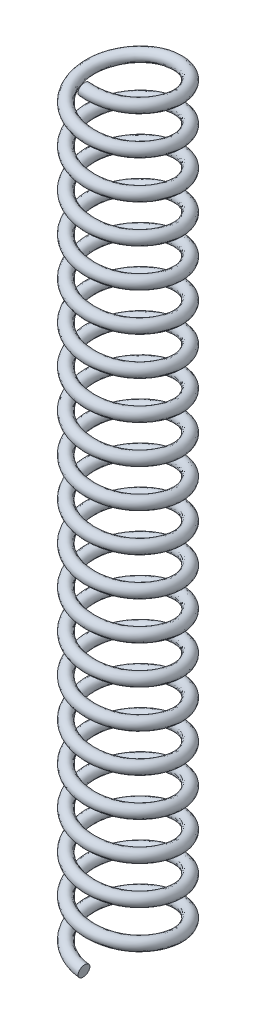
ISO-10303-21;
HEADER;
FILE_DESCRIPTION(('STEP AP214'),'2;1');
FILE_NAME('part.step','',(''),(''),'','','');
FILE_SCHEMA(('AUTOMOTIVE_DESIGN { 1 0 10303 214 1 1 1 1 }'));
ENDSEC;
DATA;
#1=APPLICATION_CONTEXT('core data for automotive mechanical design processes');
#2=APPLICATION_PROTOCOL_DEFINITION('international standard','automotive_design',2000,#1);
#3=PRODUCT_CONTEXT('',#1,'mechanical');
#4=PRODUCT('Part','Part','',(#3));
#5=PRODUCT_RELATED_PRODUCT_CATEGORY('part','',(#4));
#6=PRODUCT_DEFINITION_FORMATION('','',#4);
#7=PRODUCT_DEFINITION_CONTEXT('part definition',#1,'design');
#8=PRODUCT_DEFINITION('design','',#6,#7);
#9=PRODUCT_DEFINITION_SHAPE('','',#8);
#10=(LENGTH_UNIT() NAMED_UNIT(*) SI_UNIT(.MILLI.,.METRE.));
#11=(NAMED_UNIT(*) PLANE_ANGLE_UNIT() SI_UNIT($,.RADIAN.));
#12=(NAMED_UNIT(*) SI_UNIT($,.STERADIAN.) SOLID_ANGLE_UNIT());
#13=UNCERTAINTY_MEASURE_WITH_UNIT(LENGTH_MEASURE(1.E-05),#10,'distance_accuracy_value','');
#14=(GEOMETRIC_REPRESENTATION_CONTEXT(3) GLOBAL_UNCERTAINTY_ASSIGNED_CONTEXT((#13)) GLOBAL_UNIT_ASSIGNED_CONTEXT((#10,
#11,#12)) REPRESENTATION_CONTEXT('',''));
#15=CARTESIAN_POINT('',(0.,0.,0.));
#16=DIRECTION('',(0.,0.,1.));
#17=DIRECTION('',(1.,0.,0.));
#18=AXIS2_PLACEMENT_3D('',#15,#16,#17);
#19=CARTESIAN_POINT('',(0.,0.,3.75));
#20=DIRECTION('',(-0.990620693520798,0.136640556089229,0.));
#21=DIRECTION('',(-0.136640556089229,-0.990620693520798,0.));
#22=AXIS2_PLACEMENT_3D('',#19,#20,#21);
#23=PLANE('',#22);
#24=CARTESIAN_POINT('',(0.,0.,3.75));
#25=DIRECTION('',(-0.990620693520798,0.136640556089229,0.));
#26=DIRECTION('',(-0.136640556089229,-0.990620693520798,0.));
#27=AXIS2_PLACEMENT_3D('',#24,#25,#26);
#28=CIRCLE('',#27,0.5);
#29=CARTESIAN_POINT('',(-0.0683202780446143,-0.495310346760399,3.75));
#30=VERTEX_POINT('',#29);
#31=EDGE_CURVE('E42',#30,#30,#28,.T.);
#32=ORIENTED_EDGE('',*,*,#31,.F.);
#33=EDGE_LOOP('',(#32));
#34=FACE_BOUND('',#33,.T.);
#35=ADVANCED_FACE('F32',(#34),#23,.F.);
#36=CARTESIAN_POINT('',(-9.94153696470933E-13,65.,3.75));
#37=DIRECTION('',(-0.990620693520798,0.136640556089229,-2.6262112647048E-13));
#38=DIRECTION('',(-0.136640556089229,-0.990620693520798,0.));
#39=AXIS2_PLACEMENT_3D('',#36,#37,#38);
#40=PLANE('',#39);
#41=CARTESIAN_POINT('',(-9.94153696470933E-13,65.,3.75));
#42=DIRECTION('',(-0.990620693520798,0.136640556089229,-2.6262112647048E-13));
#43=DIRECTION('',(-0.136640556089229,-0.990620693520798,0.));
#44=AXIS2_PLACEMENT_3D('',#41,#42,#43);
#45=CIRCLE('',#44,0.5);
#46=CARTESIAN_POINT('',(-0.0683202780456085,64.5046896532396,3.74999999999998));
#47=VERTEX_POINT('',#46);
#48=EDGE_CURVE('E11',#47,#47,#45,.T.);
#49=ORIENTED_EDGE('',*,*,#48,.T.);
#50=EDGE_LOOP('',(#49));
#51=FACE_BOUND('',#50,.T.);
#52=ADVANCED_FACE('F49',(#51),#40,.T.);
#53=CARTESIAN_POINT('',(-0.0683202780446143,-0.495310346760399,3.75));
#54=CARTESIAN_POINT('',(-2.23338378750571,-0.224477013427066,3.71055526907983));
#55=CARTESIAN_POINT('',(-3.28175540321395,0.0463563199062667,1.81583290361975));
#56=CARTESIAN_POINT('',(-4.33012701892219,0.3171896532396,-0.078889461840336));
#57=CARTESIAN_POINT('',(-3.21343512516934,0.588022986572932,-1.93416709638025));
#58=CARTESIAN_POINT('',(-2.09674323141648,0.858856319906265,-3.78944473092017));
#59=CARTESIAN_POINT('',(0.0683202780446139,1.1296896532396,-3.75));
#60=CARTESIAN_POINT('',(2.23338378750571,1.40052298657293,-3.71055526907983));
#61=CARTESIAN_POINT('',(3.28175540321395,1.67135631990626,-1.81583290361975));
#62=CARTESIAN_POINT('',(4.33012701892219,1.9421896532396,0.0788894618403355));
#63=CARTESIAN_POINT('',(3.21343512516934,2.21302298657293,1.93416709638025));
#64=CARTESIAN_POINT('',(2.09674323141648,2.48385631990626,3.78944473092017));
#65=CARTESIAN_POINT('',(-0.0683202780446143,2.75468965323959,3.75));
#66=CARTESIAN_POINT('',(-2.23338378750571,3.02552298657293,3.71055526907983));
#67=CARTESIAN_POINT('',(-3.28175540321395,3.29635631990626,1.81583290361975));
#68=CARTESIAN_POINT('',(-4.33012701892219,3.56718965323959,-0.078889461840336));
#69=CARTESIAN_POINT('',(-3.21343512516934,3.83802298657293,-1.93416709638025));
#70=CARTESIAN_POINT('',(-2.09674323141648,4.10885631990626,-3.78944473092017));
#71=CARTESIAN_POINT('',(0.0683202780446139,4.37968965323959,-3.75));
#72=CARTESIAN_POINT('',(2.23338378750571,4.65052298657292,-3.71055526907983));
#73=CARTESIAN_POINT('',(3.28175540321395,4.92135631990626,-1.81583290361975));
#74=CARTESIAN_POINT('',(4.33012701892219,5.19218965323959,0.0788894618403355));
#75=CARTESIAN_POINT('',(3.21343512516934,5.46302298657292,1.93416709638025));
#76=CARTESIAN_POINT('',(2.09674323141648,5.73385631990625,3.78944473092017));
#77=CARTESIAN_POINT('',(-0.0683202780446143,6.00468965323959,3.75));
#78=CARTESIAN_POINT('',(-2.23338378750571,6.27552298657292,3.71055526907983));
#79=CARTESIAN_POINT('',(-3.28175540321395,6.54635631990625,1.81583290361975));
#80=CARTESIAN_POINT('',(-4.33012701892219,6.81718965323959,-0.078889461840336));
#81=CARTESIAN_POINT('',(-3.21343512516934,7.08802298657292,-1.93416709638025));
#82=CARTESIAN_POINT('',(-2.09674323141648,7.35885631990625,-3.78944473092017));
#83=CARTESIAN_POINT('',(0.0683202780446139,7.62968965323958,-3.75));
#84=CARTESIAN_POINT('',(2.23338378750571,7.90052298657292,-3.71055526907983));
#85=CARTESIAN_POINT('',(3.28175540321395,8.17135631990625,-1.81583290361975));
#86=CARTESIAN_POINT('',(4.33012701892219,8.44218965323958,0.0788894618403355));
#87=CARTESIAN_POINT('',(3.21343512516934,8.71302298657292,1.93416709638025));
#88=CARTESIAN_POINT('',(2.09674323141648,8.98385631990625,3.78944473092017));
#89=CARTESIAN_POINT('',(-0.0683202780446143,9.25468965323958,3.75));
#90=CARTESIAN_POINT('',(-2.23338378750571,9.52552298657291,3.71055526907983));
#91=CARTESIAN_POINT('',(-3.28175540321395,9.79635631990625,1.81583290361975));
#92=CARTESIAN_POINT('',(-4.33012701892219,10.0671896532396,-0.078889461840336));
#93=CARTESIAN_POINT('',(-3.21343512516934,10.3380229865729,-1.93416709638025));
#94=CARTESIAN_POINT('',(-2.09674323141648,10.6088563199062,-3.78944473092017));
#95=CARTESIAN_POINT('',(0.0683202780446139,10.8796896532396,-3.75));
#96=CARTESIAN_POINT('',(2.23338378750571,11.1505229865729,-3.71055526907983));
#97=CARTESIAN_POINT('',(3.28175540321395,11.4213563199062,-1.81583290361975));
#98=CARTESIAN_POINT('',(4.33012701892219,11.6921896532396,0.0788894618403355));
#99=CARTESIAN_POINT('',(3.21343512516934,11.9630229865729,1.93416709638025));
#100=CARTESIAN_POINT('',(2.09674323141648,12.2338563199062,3.78944473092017));
#101=CARTESIAN_POINT('',(-0.0683202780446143,12.5046896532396,3.75));
#102=CARTESIAN_POINT('',(-2.23338378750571,12.7755229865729,3.71055526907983));
#103=CARTESIAN_POINT('',(-3.28175540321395,13.0463563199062,1.81583290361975));
#104=CARTESIAN_POINT('',(-4.33012701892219,13.3171896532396,-0.078889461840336));
#105=CARTESIAN_POINT('',(-3.21343512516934,13.5880229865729,-1.93416709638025));
#106=CARTESIAN_POINT('',(-2.09674323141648,13.8588563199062,-3.78944473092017));
#107=CARTESIAN_POINT('',(0.0683202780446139,14.1296896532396,-3.75));
#108=CARTESIAN_POINT('',(2.23338378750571,14.4005229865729,-3.71055526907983));
#109=CARTESIAN_POINT('',(3.28175540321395,14.6713563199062,-1.81583290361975));
#110=CARTESIAN_POINT('',(4.33012701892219,14.9421896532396,0.0788894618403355));
#111=CARTESIAN_POINT('',(3.21343512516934,15.2130229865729,1.93416709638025));
#112=CARTESIAN_POINT('',(2.09674323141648,15.4838563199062,3.78944473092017));
#113=CARTESIAN_POINT('',(-0.0683202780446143,15.7546896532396,3.75));
#114=CARTESIAN_POINT('',(-2.23338378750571,16.0255229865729,3.71055526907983));
#115=CARTESIAN_POINT('',(-3.28175540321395,16.2963563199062,1.81583290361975));
#116=CARTESIAN_POINT('',(-4.33012701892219,16.5671896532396,-0.078889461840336));
#117=CARTESIAN_POINT('',(-3.21343512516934,16.8380229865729,-1.93416709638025));
#118=CARTESIAN_POINT('',(-2.09674323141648,17.1088563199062,-3.78944473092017));
#119=CARTESIAN_POINT('',(0.0683202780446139,17.3796896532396,-3.75));
#120=CARTESIAN_POINT('',(2.23338378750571,17.6505229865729,-3.71055526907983));
#121=CARTESIAN_POINT('',(3.28175540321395,17.9213563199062,-1.81583290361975));
#122=CARTESIAN_POINT('',(4.33012701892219,18.1921896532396,0.0788894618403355));
#123=CARTESIAN_POINT('',(3.21343512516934,18.4630229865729,1.93416709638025));
#124=CARTESIAN_POINT('',(2.09674323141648,18.7338563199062,3.78944473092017));
#125=CARTESIAN_POINT('',(-0.0683202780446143,19.0046896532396,3.75));
#126=CARTESIAN_POINT('',(-2.23338378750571,19.2755229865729,3.71055526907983));
#127=CARTESIAN_POINT('',(-3.28175540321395,19.5463563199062,1.81583290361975));
#128=CARTESIAN_POINT('',(-4.33012701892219,19.8171896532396,-0.078889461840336));
#129=CARTESIAN_POINT('',(-3.21343512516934,20.0880229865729,-1.93416709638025));
#130=CARTESIAN_POINT('',(-2.09674323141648,20.3588563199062,-3.78944473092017));
#131=CARTESIAN_POINT('',(0.0683202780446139,20.6296896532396,-3.75));
#132=CARTESIAN_POINT('',(2.23338378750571,20.9005229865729,-3.71055526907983));
#133=CARTESIAN_POINT('',(3.28175540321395,21.1713563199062,-1.81583290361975));
#134=CARTESIAN_POINT('',(4.33012701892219,21.4421896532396,0.0788894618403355));
#135=CARTESIAN_POINT('',(3.21343512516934,21.7130229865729,1.93416709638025));
#136=CARTESIAN_POINT('',(2.09674323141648,21.9838563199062,3.78944473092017));
#137=CARTESIAN_POINT('',(-0.0683202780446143,22.2546896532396,3.75));
#138=CARTESIAN_POINT('',(-2.23338378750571,22.5255229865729,3.71055526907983));
#139=CARTESIAN_POINT('',(-3.28175540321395,22.7963563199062,1.81583290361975));
#140=CARTESIAN_POINT('',(-4.33012701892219,23.0671896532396,-0.078889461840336));
#141=CARTESIAN_POINT('',(-3.21343512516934,23.3380229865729,-1.93416709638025));
#142=CARTESIAN_POINT('',(-2.09674323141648,23.6088563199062,-3.78944473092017));
#143=CARTESIAN_POINT('',(0.0683202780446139,23.8796896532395,-3.75));
#144=CARTESIAN_POINT('',(2.23338378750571,24.1505229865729,-3.71055526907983));
#145=CARTESIAN_POINT('',(3.28175540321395,24.4213563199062,-1.81583290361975));
#146=CARTESIAN_POINT('',(4.33012701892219,24.6921896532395,0.0788894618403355));
#147=CARTESIAN_POINT('',(3.21343512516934,24.9630229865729,1.93416709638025));
#148=CARTESIAN_POINT('',(2.09674323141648,25.2338563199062,3.78944473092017));
#149=CARTESIAN_POINT('',(-0.0683202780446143,25.5046896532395,3.75));
#150=CARTESIAN_POINT('',(-2.23338378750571,25.7755229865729,3.71055526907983));
#151=CARTESIAN_POINT('',(-3.28175540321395,26.0463563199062,1.81583290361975));
#152=CARTESIAN_POINT('',(-4.33012701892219,26.3171896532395,-0.078889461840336));
#153=CARTESIAN_POINT('',(-3.21343512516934,26.5880229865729,-1.93416709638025));
#154=CARTESIAN_POINT('',(-2.09674323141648,26.8588563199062,-3.78944473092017));
#155=CARTESIAN_POINT('',(0.0683202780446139,27.1296896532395,-3.75));
#156=CARTESIAN_POINT('',(2.23338378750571,27.4005229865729,-3.71055526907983));
#157=CARTESIAN_POINT('',(3.28175540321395,27.6713563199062,-1.81583290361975));
#158=CARTESIAN_POINT('',(4.33012701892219,27.9421896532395,0.0788894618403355));
#159=CARTESIAN_POINT('',(3.21343512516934,28.2130229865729,1.93416709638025));
#160=CARTESIAN_POINT('',(2.09674323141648,28.4838563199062,3.78944473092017));
#161=CARTESIAN_POINT('',(-0.0683202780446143,28.7546896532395,3.75));
#162=CARTESIAN_POINT('',(-2.23338378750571,29.0255229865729,3.71055526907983));
#163=CARTESIAN_POINT('',(-3.28175540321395,29.2963563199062,1.81583290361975));
#164=CARTESIAN_POINT('',(-4.33012701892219,29.5671896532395,-0.078889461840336));
#165=CARTESIAN_POINT('',(-3.21343512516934,29.8380229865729,-1.93416709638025));
#166=CARTESIAN_POINT('',(-2.09674323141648,30.1088563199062,-3.78944473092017));
#167=CARTESIAN_POINT('',(0.0683202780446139,30.3796896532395,-3.75));
#168=CARTESIAN_POINT('',(2.23338378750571,30.6505229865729,-3.71055526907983));
#169=CARTESIAN_POINT('',(3.28175540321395,30.9213563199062,-1.81583290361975));
#170=CARTESIAN_POINT('',(4.33012701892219,31.1921896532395,0.0788894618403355));
#171=CARTESIAN_POINT('',(3.21343512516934,31.4630229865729,1.93416709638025));
#172=CARTESIAN_POINT('',(2.09674323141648,31.7338563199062,3.78944473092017));
#173=CARTESIAN_POINT('',(-0.0683202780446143,32.0046896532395,3.75));
#174=CARTESIAN_POINT('',(-2.23338378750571,32.2755229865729,3.71055526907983));
#175=CARTESIAN_POINT('',(-3.28175540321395,32.5463563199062,1.81583290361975));
#176=CARTESIAN_POINT('',(-4.33012701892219,32.8171896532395,-0.078889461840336));
#177=CARTESIAN_POINT('',(-3.21343512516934,33.0880229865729,-1.93416709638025));
#178=CARTESIAN_POINT('',(-2.09674323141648,33.3588563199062,-3.78944473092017));
#179=CARTESIAN_POINT('',(0.0683202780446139,33.6296896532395,-3.75));
#180=CARTESIAN_POINT('',(2.23338378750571,33.9005229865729,-3.71055526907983));
#181=CARTESIAN_POINT('',(3.28175540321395,34.1713563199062,-1.81583290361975));
#182=CARTESIAN_POINT('',(4.33012701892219,34.4421896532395,0.0788894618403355));
#183=CARTESIAN_POINT('',(3.21343512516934,34.7130229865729,1.93416709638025));
#184=CARTESIAN_POINT('',(2.09674323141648,34.9838563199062,3.78944473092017));
#185=CARTESIAN_POINT('',(-0.0683202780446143,35.2546896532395,3.75));
#186=CARTESIAN_POINT('',(-2.23338378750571,35.5255229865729,3.71055526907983));
#187=CARTESIAN_POINT('',(-3.28175540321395,35.7963563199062,1.81583290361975));
#188=CARTESIAN_POINT('',(-4.33012701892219,36.0671896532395,-0.078889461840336));
#189=CARTESIAN_POINT('',(-3.21343512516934,36.3380229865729,-1.93416709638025));
#190=CARTESIAN_POINT('',(-2.09674323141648,36.6088563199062,-3.78944473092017));
#191=CARTESIAN_POINT('',(0.0683202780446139,36.8796896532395,-3.75));
#192=CARTESIAN_POINT('',(2.23338378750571,37.1505229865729,-3.71055526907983));
#193=CARTESIAN_POINT('',(3.28175540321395,37.4213563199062,-1.81583290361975));
#194=CARTESIAN_POINT('',(4.33012701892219,37.6921896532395,0.0788894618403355));
#195=CARTESIAN_POINT('',(3.21343512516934,37.9630229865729,1.93416709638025));
#196=CARTESIAN_POINT('',(2.09674323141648,38.2338563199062,3.78944473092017));
#197=CARTESIAN_POINT('',(-0.0683202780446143,38.5046896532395,3.75));
#198=CARTESIAN_POINT('',(-2.23338378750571,38.7755229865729,3.71055526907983));
#199=CARTESIAN_POINT('',(-3.28175540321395,39.0463563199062,1.81583290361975));
#200=CARTESIAN_POINT('',(-4.33012701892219,39.3171896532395,-0.078889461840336));
#201=CARTESIAN_POINT('',(-3.21343512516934,39.5880229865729,-1.93416709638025));
#202=CARTESIAN_POINT('',(-2.09674323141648,39.8588563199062,-3.78944473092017));
#203=CARTESIAN_POINT('',(0.0683202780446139,40.1296896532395,-3.75));
#204=CARTESIAN_POINT('',(2.23338378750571,40.4005229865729,-3.71055526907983));
#205=CARTESIAN_POINT('',(3.28175540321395,40.6713563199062,-1.81583290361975));
#206=CARTESIAN_POINT('',(4.33012701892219,40.9421896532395,0.0788894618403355));
#207=CARTESIAN_POINT('',(3.21343512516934,41.2130229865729,1.93416709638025));
#208=CARTESIAN_POINT('',(2.09674323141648,41.4838563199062,3.78944473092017));
#209=CARTESIAN_POINT('',(-0.0683202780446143,41.7546896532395,3.75));
#210=CARTESIAN_POINT('',(-2.23338378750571,42.0255229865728,3.71055526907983));
#211=CARTESIAN_POINT('',(-3.28175540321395,42.2963563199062,1.81583290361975));
#212=CARTESIAN_POINT('',(-4.33012701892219,42.5671896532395,-0.078889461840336));
#213=CARTESIAN_POINT('',(-3.21343512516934,42.8380229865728,-1.93416709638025));
#214=CARTESIAN_POINT('',(-2.09674323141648,43.1088563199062,-3.78944473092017));
#215=CARTESIAN_POINT('',(0.0683202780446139,43.3796896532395,-3.75));
#216=CARTESIAN_POINT('',(2.23338378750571,43.6505229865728,-3.71055526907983));
#217=CARTESIAN_POINT('',(3.28175540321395,43.9213563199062,-1.81583290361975));
#218=CARTESIAN_POINT('',(4.33012701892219,44.1921896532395,0.0788894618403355));
#219=CARTESIAN_POINT('',(3.21343512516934,44.4630229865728,1.93416709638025));
#220=CARTESIAN_POINT('',(2.09674323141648,44.7338563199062,3.78944473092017));
#221=CARTESIAN_POINT('',(-0.0683202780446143,45.0046896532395,3.75));
#222=CARTESIAN_POINT('',(-2.23338378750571,45.2755229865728,3.71055526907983));
#223=CARTESIAN_POINT('',(-3.28175540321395,45.5463563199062,1.81583290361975));
#224=CARTESIAN_POINT('',(-4.33012701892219,45.8171896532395,-0.078889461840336));
#225=CARTESIAN_POINT('',(-3.21343512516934,46.0880229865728,-1.93416709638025));
#226=CARTESIAN_POINT('',(-2.09674323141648,46.3588563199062,-3.78944473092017));
#227=CARTESIAN_POINT('',(0.0683202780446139,46.6296896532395,-3.75));
#228=CARTESIAN_POINT('',(2.23338378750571,46.9005229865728,-3.71055526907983));
#229=CARTESIAN_POINT('',(3.28175540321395,47.1713563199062,-1.81583290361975));
#230=CARTESIAN_POINT('',(4.33012701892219,47.4421896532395,0.0788894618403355));
#231=CARTESIAN_POINT('',(3.21343512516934,47.7130229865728,1.93416709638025));
#232=CARTESIAN_POINT('',(2.09674323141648,47.9838563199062,3.78944473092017));
#233=CARTESIAN_POINT('',(-0.0683202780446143,48.2546896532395,3.75));
#234=CARTESIAN_POINT('',(-2.23338378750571,48.5255229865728,3.71055526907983));
#235=CARTESIAN_POINT('',(-3.28175540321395,48.7963563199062,1.81583290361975));
#236=CARTESIAN_POINT('',(-4.33012701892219,49.0671896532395,-0.078889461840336));
#237=CARTESIAN_POINT('',(-3.21343512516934,49.3380229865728,-1.93416709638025));
#238=CARTESIAN_POINT('',(-2.09674323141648,49.6088563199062,-3.78944473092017));
#239=CARTESIAN_POINT('',(0.0683202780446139,49.8796896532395,-3.75));
#240=CARTESIAN_POINT('',(2.23338378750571,50.1505229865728,-3.71055526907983));
#241=CARTESIAN_POINT('',(3.28175540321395,50.4213563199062,-1.81583290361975));
#242=CARTESIAN_POINT('',(4.33012701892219,50.6921896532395,0.0788894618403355));
#243=CARTESIAN_POINT('',(3.21343512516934,50.9630229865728,1.93416709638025));
#244=CARTESIAN_POINT('',(2.09674323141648,51.2338563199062,3.78944473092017));
#245=CARTESIAN_POINT('',(-0.0683202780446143,51.5046896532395,3.75));
#246=CARTESIAN_POINT('',(-2.23338378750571,51.7755229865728,3.71055526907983));
#247=CARTESIAN_POINT('',(-3.28175540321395,52.0463563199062,1.81583290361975));
#248=CARTESIAN_POINT('',(-4.33012701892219,52.3171896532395,-0.078889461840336));
#249=CARTESIAN_POINT('',(-3.21343512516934,52.5880229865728,-1.93416709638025));
#250=CARTESIAN_POINT('',(-2.09674323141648,52.8588563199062,-3.78944473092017));
#251=CARTESIAN_POINT('',(0.0683202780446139,53.1296896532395,-3.75));
#252=CARTESIAN_POINT('',(2.23338378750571,53.4005229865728,-3.71055526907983));
#253=CARTESIAN_POINT('',(3.28175540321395,53.6713563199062,-1.81583290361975));
#254=CARTESIAN_POINT('',(4.33012701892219,53.9421896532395,0.0788894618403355));
#255=CARTESIAN_POINT('',(3.21343512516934,54.2130229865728,1.93416709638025));
#256=CARTESIAN_POINT('',(2.09674323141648,54.4838563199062,3.78944473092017));
#257=CARTESIAN_POINT('',(-0.0683202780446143,54.7546896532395,3.75));
#258=CARTESIAN_POINT('',(-2.23338378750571,55.0255229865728,3.71055526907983));
#259=CARTESIAN_POINT('',(-3.28175540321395,55.2963563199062,1.81583290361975));
#260=CARTESIAN_POINT('',(-4.33012701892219,55.5671896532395,-0.078889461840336));
#261=CARTESIAN_POINT('',(-3.21343512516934,55.8380229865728,-1.93416709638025));
#262=CARTESIAN_POINT('',(-2.09674323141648,56.1088563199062,-3.78944473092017));
#263=CARTESIAN_POINT('',(0.0683202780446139,56.3796896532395,-3.75));
#264=CARTESIAN_POINT('',(2.23338378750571,56.6505229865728,-3.71055526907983));
#265=CARTESIAN_POINT('',(3.28175540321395,56.9213563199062,-1.81583290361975));
#266=CARTESIAN_POINT('',(4.33012701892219,57.1921896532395,0.0788894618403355));
#267=CARTESIAN_POINT('',(3.21343512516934,57.4630229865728,1.93416709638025));
#268=CARTESIAN_POINT('',(2.09674323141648,57.7338563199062,3.78944473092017));
#269=CARTESIAN_POINT('',(-0.0683202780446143,58.0046896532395,3.75));
#270=CARTESIAN_POINT('',(-2.23338378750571,58.2755229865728,3.71055526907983));
#271=CARTESIAN_POINT('',(-3.28175540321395,58.5463563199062,1.81583290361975));
#272=CARTESIAN_POINT('',(-4.33012701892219,58.8171896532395,-0.078889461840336));
#273=CARTESIAN_POINT('',(-3.21343512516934,59.0880229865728,-1.93416709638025));
#274=CARTESIAN_POINT('',(-2.09674323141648,59.3588563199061,-3.78944473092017));
#275=CARTESIAN_POINT('',(0.0683202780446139,59.6296896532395,-3.75));
#276=CARTESIAN_POINT('',(2.23338378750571,59.9005229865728,-3.71055526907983));
#277=CARTESIAN_POINT('',(3.28175540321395,60.1713563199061,-1.81583290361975));
#278=CARTESIAN_POINT('',(4.33012701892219,60.4421896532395,0.0788894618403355));
#279=CARTESIAN_POINT('',(3.21343512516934,60.7130229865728,1.93416709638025));
#280=CARTESIAN_POINT('',(2.09674323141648,60.9838563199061,3.78944473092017));
#281=CARTESIAN_POINT('',(-0.0683202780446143,61.2546896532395,3.75));
#282=CARTESIAN_POINT('',(-2.23338378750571,61.5255229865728,3.71055526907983));
#283=CARTESIAN_POINT('',(-3.28175540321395,61.7963563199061,1.81583290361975));
#284=CARTESIAN_POINT('',(-4.33012701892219,62.0671896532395,-0.078889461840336));
#285=CARTESIAN_POINT('',(-3.21343512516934,62.3380229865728,-1.93416709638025));
#286=CARTESIAN_POINT('',(-2.09674323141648,62.6088563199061,-3.78944473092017));
#287=CARTESIAN_POINT('',(0.0683202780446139,62.8796896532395,-3.75));
#288=CARTESIAN_POINT('',(2.23338378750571,63.1505229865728,-3.71055526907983));
#289=CARTESIAN_POINT('',(3.28175540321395,63.4213563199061,-1.81583290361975));
#290=CARTESIAN_POINT('',(4.33012701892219,63.6921896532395,0.0788894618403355));
#291=CARTESIAN_POINT('',(3.21343512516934,63.9630229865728,1.93416709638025));
#292=CARTESIAN_POINT('',(2.09674323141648,64.2338563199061,3.78944473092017));
#293=CARTESIAN_POINT('',(-0.0683202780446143,64.5046896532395,3.75));
#294=CARTESIAN_POINT('',(-2.23338378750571,64.7755229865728,3.71055526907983));
#295=CARTESIAN_POINT('',(-3.28175540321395,65.0463563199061,1.81583290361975));
#296=CARTESIAN_POINT('',(-4.33012701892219,65.3171896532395,-0.078889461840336));
#297=CARTESIAN_POINT('',(-3.21343512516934,65.5880229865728,-1.93416709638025));
#298=CARTESIAN_POINT('',(-2.09674323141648,65.8588563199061,-3.78944473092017));
#299=CARTESIAN_POINT('',(0.0683202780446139,66.1296896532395,-3.75));
#300=CARTESIAN_POINT('',(2.23338378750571,66.4005229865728,-3.71055526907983));
#301=CARTESIAN_POINT('',(3.28175540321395,66.6713563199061,-1.81583290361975));
#302=CARTESIAN_POINT('',(4.33012701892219,66.9421896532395,0.0788894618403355));
#303=CARTESIAN_POINT('',(3.21343512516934,67.2130229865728,1.93416709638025));
#304=CARTESIAN_POINT('',(2.09674323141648,67.4838563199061,3.78944473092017));
#305=CARTESIAN_POINT('',(-0.0683202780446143,67.7546896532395,3.75));
#306=CARTESIAN_POINT('',(-0.0683202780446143,-0.495310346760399,4.75));
#307=CARTESIAN_POINT('',(-2.81073405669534,-0.224477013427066,4.71055526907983));
#308=CARTESIAN_POINT('',(-4.14778080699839,0.0463563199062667,2.31583290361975));
#309=CARTESIAN_POINT('',(-5.48482755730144,0.3171896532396,-0.078889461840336));
#310=CARTESIAN_POINT('',(-4.07946052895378,0.588022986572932,-2.43416709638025));
#311=CARTESIAN_POINT('',(-2.67409350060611,0.858856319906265,-4.78944473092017));
#312=CARTESIAN_POINT('',(0.0683202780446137,1.1296896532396,-4.75));
#313=CARTESIAN_POINT('',(2.81073405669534,1.40052298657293,-4.71055526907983));
#314=CARTESIAN_POINT('',(4.14778080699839,1.67135631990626,-2.31583290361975));
#315=CARTESIAN_POINT('',(5.48482755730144,1.9421896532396,0.0788894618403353));
#316=CARTESIAN_POINT('',(4.07946052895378,2.21302298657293,2.43416709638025));
#317=CARTESIAN_POINT('',(2.67409350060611,2.48385631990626,4.78944473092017));
#318=CARTESIAN_POINT('',(-0.0683202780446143,2.75468965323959,4.75));
#319=CARTESIAN_POINT('',(-2.81073405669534,3.02552298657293,4.71055526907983));
#320=CARTESIAN_POINT('',(-4.14778080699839,3.29635631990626,2.31583290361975));
#321=CARTESIAN_POINT('',(-5.48482755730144,3.56718965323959,-0.078889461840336));
#322=CARTESIAN_POINT('',(-4.07946052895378,3.83802298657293,-2.43416709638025));
#323=CARTESIAN_POINT('',(-2.67409350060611,4.10885631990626,-4.78944473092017));
#324=CARTESIAN_POINT('',(0.0683202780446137,4.37968965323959,-4.75));
#325=CARTESIAN_POINT('',(2.81073405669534,4.65052298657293,-4.71055526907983));
#326=CARTESIAN_POINT('',(4.14778080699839,4.92135631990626,-2.31583290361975));
#327=CARTESIAN_POINT('',(5.48482755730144,5.19218965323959,0.0788894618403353));
#328=CARTESIAN_POINT('',(4.07946052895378,5.46302298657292,2.43416709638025));
#329=CARTESIAN_POINT('',(2.67409350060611,5.73385631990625,4.78944473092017));
#330=CARTESIAN_POINT('',(-0.0683202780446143,6.00468965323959,4.75));
#331=CARTESIAN_POINT('',(-2.81073405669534,6.27552298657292,4.71055526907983));
#332=CARTESIAN_POINT('',(-4.14778080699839,6.54635631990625,2.31583290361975));
#333=CARTESIAN_POINT('',(-5.48482755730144,6.81718965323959,-0.078889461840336));
#334=CARTESIAN_POINT('',(-4.07946052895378,7.08802298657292,-2.43416709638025));
#335=CARTESIAN_POINT('',(-2.67409350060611,7.35885631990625,-4.78944473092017));
#336=CARTESIAN_POINT('',(0.0683202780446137,7.62968965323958,-4.75));
#337=CARTESIAN_POINT('',(2.81073405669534,7.90052298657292,-4.71055526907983));
#338=CARTESIAN_POINT('',(4.14778080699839,8.17135631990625,-2.31583290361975));
#339=CARTESIAN_POINT('',(5.48482755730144,8.44218965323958,0.0788894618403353));
#340=CARTESIAN_POINT('',(4.07946052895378,8.71302298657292,2.43416709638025));
#341=CARTESIAN_POINT('',(2.67409350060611,8.98385631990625,4.78944473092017));
#342=CARTESIAN_POINT('',(-0.0683202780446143,9.25468965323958,4.75));
#343=CARTESIAN_POINT('',(-2.81073405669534,9.52552298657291,4.71055526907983));
#344=CARTESIAN_POINT('',(-4.14778080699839,9.79635631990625,2.31583290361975));
#345=CARTESIAN_POINT('',(-5.48482755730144,10.0671896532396,-0.078889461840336));
#346=CARTESIAN_POINT('',(-4.07946052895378,10.3380229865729,-2.43416709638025));
#347=CARTESIAN_POINT('',(-2.67409350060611,10.6088563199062,-4.78944473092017));
#348=CARTESIAN_POINT('',(0.0683202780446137,10.8796896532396,-4.75));
#349=CARTESIAN_POINT('',(2.81073405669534,11.1505229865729,-4.71055526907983));
#350=CARTESIAN_POINT('',(4.14778080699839,11.4213563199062,-2.31583290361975));
#351=CARTESIAN_POINT('',(5.48482755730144,11.6921896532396,0.0788894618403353));
#352=CARTESIAN_POINT('',(4.07946052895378,11.9630229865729,2.43416709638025));
#353=CARTESIAN_POINT('',(2.67409350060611,12.2338563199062,4.78944473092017));
#354=CARTESIAN_POINT('',(-0.0683202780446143,12.5046896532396,4.75));
#355=CARTESIAN_POINT('',(-2.81073405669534,12.7755229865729,4.71055526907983));
#356=CARTESIAN_POINT('',(-4.14778080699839,13.0463563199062,2.31583290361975));
#357=CARTESIAN_POINT('',(-5.48482755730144,13.3171896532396,-0.078889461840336));
#358=CARTESIAN_POINT('',(-4.07946052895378,13.5880229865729,-2.43416709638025));
#359=CARTESIAN_POINT('',(-2.67409350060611,13.8588563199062,-4.78944473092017));
#360=CARTESIAN_POINT('',(0.0683202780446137,14.1296896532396,-4.75));
#361=CARTESIAN_POINT('',(2.81073405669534,14.4005229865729,-4.71055526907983));
#362=CARTESIAN_POINT('',(4.14778080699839,14.6713563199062,-2.31583290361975));
#363=CARTESIAN_POINT('',(5.48482755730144,14.9421896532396,0.0788894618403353));
#364=CARTESIAN_POINT('',(4.07946052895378,15.2130229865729,2.43416709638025));
#365=CARTESIAN_POINT('',(2.67409350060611,15.4838563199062,4.78944473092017));
#366=CARTESIAN_POINT('',(-0.0683202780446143,15.7546896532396,4.75));
#367=CARTESIAN_POINT('',(-2.81073405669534,16.0255229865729,4.71055526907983));
#368=CARTESIAN_POINT('',(-4.14778080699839,16.2963563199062,2.31583290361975));
#369=CARTESIAN_POINT('',(-5.48482755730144,16.5671896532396,-0.078889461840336));
#370=CARTESIAN_POINT('',(-4.07946052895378,16.8380229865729,-2.43416709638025));
#371=CARTESIAN_POINT('',(-2.67409350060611,17.1088563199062,-4.78944473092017));
#372=CARTESIAN_POINT('',(0.0683202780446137,17.3796896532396,-4.75));
#373=CARTESIAN_POINT('',(2.81073405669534,17.6505229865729,-4.71055526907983));
#374=CARTESIAN_POINT('',(4.14778080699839,17.9213563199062,-2.31583290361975));
#375=CARTESIAN_POINT('',(5.48482755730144,18.1921896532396,0.0788894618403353));
#376=CARTESIAN_POINT('',(4.07946052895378,18.4630229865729,2.43416709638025));
#377=CARTESIAN_POINT('',(2.67409350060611,18.7338563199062,4.78944473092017));
#378=CARTESIAN_POINT('',(-0.0683202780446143,19.0046896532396,4.75));
#379=CARTESIAN_POINT('',(-2.81073405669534,19.2755229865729,4.71055526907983));
#380=CARTESIAN_POINT('',(-4.14778080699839,19.5463563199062,2.31583290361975));
#381=CARTESIAN_POINT('',(-5.48482755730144,19.8171896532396,-0.078889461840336));
#382=CARTESIAN_POINT('',(-4.07946052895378,20.0880229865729,-2.43416709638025));
#383=CARTESIAN_POINT('',(-2.67409350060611,20.3588563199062,-4.78944473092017));
#384=CARTESIAN_POINT('',(0.0683202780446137,20.6296896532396,-4.75));
#385=CARTESIAN_POINT('',(2.81073405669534,20.9005229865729,-4.71055526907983));
#386=CARTESIAN_POINT('',(4.14778080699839,21.1713563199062,-2.31583290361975));
#387=CARTESIAN_POINT('',(5.48482755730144,21.4421896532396,0.0788894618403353));
#388=CARTESIAN_POINT('',(4.07946052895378,21.7130229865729,2.43416709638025));
#389=CARTESIAN_POINT('',(2.67409350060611,21.9838563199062,4.78944473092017));
#390=CARTESIAN_POINT('',(-0.0683202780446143,22.2546896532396,4.75));
#391=CARTESIAN_POINT('',(-2.81073405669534,22.5255229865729,4.71055526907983));
#392=CARTESIAN_POINT('',(-4.14778080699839,22.7963563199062,2.31583290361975));
#393=CARTESIAN_POINT('',(-5.48482755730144,23.0671896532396,-0.078889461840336));
#394=CARTESIAN_POINT('',(-4.07946052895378,23.3380229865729,-2.43416709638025));
#395=CARTESIAN_POINT('',(-2.67409350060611,23.6088563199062,-4.78944473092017));
#396=CARTESIAN_POINT('',(0.0683202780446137,23.8796896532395,-4.75));
#397=CARTESIAN_POINT('',(2.81073405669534,24.1505229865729,-4.71055526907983));
#398=CARTESIAN_POINT('',(4.14778080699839,24.4213563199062,-2.31583290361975));
#399=CARTESIAN_POINT('',(5.48482755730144,24.6921896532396,0.0788894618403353));
#400=CARTESIAN_POINT('',(4.07946052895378,24.9630229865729,2.43416709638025));
#401=CARTESIAN_POINT('',(2.67409350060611,25.2338563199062,4.78944473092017));
#402=CARTESIAN_POINT('',(-0.0683202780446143,25.5046896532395,4.75));
#403=CARTESIAN_POINT('',(-2.81073405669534,25.7755229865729,4.71055526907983));
#404=CARTESIAN_POINT('',(-4.14778080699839,26.0463563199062,2.31583290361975));
#405=CARTESIAN_POINT('',(-5.48482755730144,26.3171896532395,-0.078889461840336));
#406=CARTESIAN_POINT('',(-4.07946052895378,26.5880229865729,-2.43416709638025));
#407=CARTESIAN_POINT('',(-2.67409350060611,26.8588563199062,-4.78944473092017));
#408=CARTESIAN_POINT('',(0.0683202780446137,27.1296896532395,-4.75));
#409=CARTESIAN_POINT('',(2.81073405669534,27.4005229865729,-4.71055526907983));
#410=CARTESIAN_POINT('',(4.14778080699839,27.6713563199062,-2.31583290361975));
#411=CARTESIAN_POINT('',(5.48482755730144,27.9421896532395,0.0788894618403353));
#412=CARTESIAN_POINT('',(4.07946052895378,28.2130229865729,2.43416709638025));
#413=CARTESIAN_POINT('',(2.67409350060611,28.4838563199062,4.78944473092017));
#414=CARTESIAN_POINT('',(-0.0683202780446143,28.7546896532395,4.75));
#415=CARTESIAN_POINT('',(-2.81073405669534,29.0255229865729,4.71055526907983));
#416=CARTESIAN_POINT('',(-4.14778080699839,29.2963563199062,2.31583290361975));
#417=CARTESIAN_POINT('',(-5.48482755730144,29.5671896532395,-0.078889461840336));
#418=CARTESIAN_POINT('',(-4.07946052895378,29.8380229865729,-2.43416709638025));
#419=CARTESIAN_POINT('',(-2.67409350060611,30.1088563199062,-4.78944473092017));
#420=CARTESIAN_POINT('',(0.0683202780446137,30.3796896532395,-4.75));
#421=CARTESIAN_POINT('',(2.81073405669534,30.6505229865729,-4.71055526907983));
#422=CARTESIAN_POINT('',(4.14778080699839,30.9213563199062,-2.31583290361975));
#423=CARTESIAN_POINT('',(5.48482755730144,31.1921896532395,0.0788894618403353));
#424=CARTESIAN_POINT('',(4.07946052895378,31.4630229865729,2.43416709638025));
#425=CARTESIAN_POINT('',(2.67409350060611,31.7338563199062,4.78944473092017));
#426=CARTESIAN_POINT('',(-0.0683202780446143,32.0046896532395,4.75));
#427=CARTESIAN_POINT('',(-2.81073405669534,32.2755229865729,4.71055526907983));
#428=CARTESIAN_POINT('',(-4.14778080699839,32.5463563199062,2.31583290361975));
#429=CARTESIAN_POINT('',(-5.48482755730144,32.8171896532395,-0.078889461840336));
#430=CARTESIAN_POINT('',(-4.07946052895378,33.0880229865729,-2.43416709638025));
#431=CARTESIAN_POINT('',(-2.67409350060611,33.3588563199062,-4.78944473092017));
#432=CARTESIAN_POINT('',(0.0683202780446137,33.6296896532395,-4.75));
#433=CARTESIAN_POINT('',(2.81073405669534,33.9005229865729,-4.71055526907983));
#434=CARTESIAN_POINT('',(4.14778080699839,34.1713563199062,-2.31583290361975));
#435=CARTESIAN_POINT('',(5.48482755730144,34.4421896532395,0.0788894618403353));
#436=CARTESIAN_POINT('',(4.07946052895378,34.7130229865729,2.43416709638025));
#437=CARTESIAN_POINT('',(2.67409350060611,34.9838563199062,4.78944473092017));
#438=CARTESIAN_POINT('',(-0.0683202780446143,35.2546896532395,4.75));
#439=CARTESIAN_POINT('',(-2.81073405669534,35.5255229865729,4.71055526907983));
#440=CARTESIAN_POINT('',(-4.14778080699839,35.7963563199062,2.31583290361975));
#441=CARTESIAN_POINT('',(-5.48482755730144,36.0671896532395,-0.078889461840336));
#442=CARTESIAN_POINT('',(-4.07946052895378,36.3380229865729,-2.43416709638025));
#443=CARTESIAN_POINT('',(-2.67409350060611,36.6088563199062,-4.78944473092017));
#444=CARTESIAN_POINT('',(0.0683202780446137,36.8796896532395,-4.75));
#445=CARTESIAN_POINT('',(2.81073405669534,37.1505229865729,-4.71055526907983));
#446=CARTESIAN_POINT('',(4.14778080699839,37.4213563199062,-2.31583290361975));
#447=CARTESIAN_POINT('',(5.48482755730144,37.6921896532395,0.0788894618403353));
#448=CARTESIAN_POINT('',(4.07946052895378,37.9630229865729,2.43416709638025));
#449=CARTESIAN_POINT('',(2.67409350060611,38.2338563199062,4.78944473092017));
#450=CARTESIAN_POINT('',(-0.0683202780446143,38.5046896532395,4.75));
#451=CARTESIAN_POINT('',(-2.81073405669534,38.7755229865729,4.71055526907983));
#452=CARTESIAN_POINT('',(-4.14778080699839,39.0463563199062,2.31583290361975));
#453=CARTESIAN_POINT('',(-5.48482755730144,39.3171896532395,-0.078889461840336));
#454=CARTESIAN_POINT('',(-4.07946052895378,39.5880229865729,-2.43416709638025));
#455=CARTESIAN_POINT('',(-2.67409350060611,39.8588563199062,-4.78944473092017));
#456=CARTESIAN_POINT('',(0.0683202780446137,40.1296896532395,-4.75));
#457=CARTESIAN_POINT('',(2.81073405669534,40.4005229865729,-4.71055526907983));
#458=CARTESIAN_POINT('',(4.14778080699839,40.6713563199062,-2.31583290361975));
#459=CARTESIAN_POINT('',(5.48482755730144,40.9421896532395,0.0788894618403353));
#460=CARTESIAN_POINT('',(4.07946052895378,41.2130229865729,2.43416709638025));
#461=CARTESIAN_POINT('',(2.67409350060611,41.4838563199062,4.78944473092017));
#462=CARTESIAN_POINT('',(-0.0683202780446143,41.7546896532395,4.75));
#463=CARTESIAN_POINT('',(-2.81073405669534,42.0255229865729,4.71055526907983));
#464=CARTESIAN_POINT('',(-4.14778080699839,42.2963563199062,2.31583290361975));
#465=CARTESIAN_POINT('',(-5.48482755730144,42.5671896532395,-0.078889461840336));
#466=CARTESIAN_POINT('',(-4.07946052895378,42.8380229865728,-2.43416709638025));
#467=CARTESIAN_POINT('',(-2.67409350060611,43.1088563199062,-4.78944473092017));
#468=CARTESIAN_POINT('',(0.0683202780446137,43.3796896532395,-4.75));
#469=CARTESIAN_POINT('',(2.81073405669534,43.6505229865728,-4.71055526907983));
#470=CARTESIAN_POINT('',(4.14778080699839,43.9213563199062,-2.31583290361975));
#471=CARTESIAN_POINT('',(5.48482755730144,44.1921896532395,0.0788894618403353));
#472=CARTESIAN_POINT('',(4.07946052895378,44.4630229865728,2.43416709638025));
#473=CARTESIAN_POINT('',(2.67409350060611,44.7338563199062,4.78944473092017));
#474=CARTESIAN_POINT('',(-0.0683202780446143,45.0046896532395,4.75));
#475=CARTESIAN_POINT('',(-2.81073405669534,45.2755229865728,4.71055526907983));
#476=CARTESIAN_POINT('',(-4.14778080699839,45.5463563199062,2.31583290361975));
#477=CARTESIAN_POINT('',(-5.48482755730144,45.8171896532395,-0.078889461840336));
#478=CARTESIAN_POINT('',(-4.07946052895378,46.0880229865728,-2.43416709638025));
#479=CARTESIAN_POINT('',(-2.67409350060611,46.3588563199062,-4.78944473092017));
#480=CARTESIAN_POINT('',(0.0683202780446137,46.6296896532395,-4.75));
#481=CARTESIAN_POINT('',(2.81073405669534,46.9005229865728,-4.71055526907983));
#482=CARTESIAN_POINT('',(4.14778080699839,47.1713563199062,-2.31583290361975));
#483=CARTESIAN_POINT('',(5.48482755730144,47.4421896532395,0.0788894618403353));
#484=CARTESIAN_POINT('',(4.07946052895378,47.7130229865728,2.43416709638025));
#485=CARTESIAN_POINT('',(2.67409350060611,47.9838563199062,4.78944473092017));
#486=CARTESIAN_POINT('',(-0.0683202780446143,48.2546896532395,4.75));
#487=CARTESIAN_POINT('',(-2.81073405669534,48.5255229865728,4.71055526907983));
#488=CARTESIAN_POINT('',(-4.14778080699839,48.7963563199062,2.31583290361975));
#489=CARTESIAN_POINT('',(-5.48482755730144,49.0671896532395,-0.078889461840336));
#490=CARTESIAN_POINT('',(-4.07946052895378,49.3380229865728,-2.43416709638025));
#491=CARTESIAN_POINT('',(-2.67409350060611,49.6088563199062,-4.78944473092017));
#492=CARTESIAN_POINT('',(0.0683202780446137,49.8796896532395,-4.75));
#493=CARTESIAN_POINT('',(2.81073405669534,50.1505229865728,-4.71055526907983));
#494=CARTESIAN_POINT('',(4.14778080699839,50.4213563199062,-2.31583290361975));
#495=CARTESIAN_POINT('',(5.48482755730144,50.6921896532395,0.0788894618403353));
#496=CARTESIAN_POINT('',(4.07946052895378,50.9630229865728,2.43416709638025));
#497=CARTESIAN_POINT('',(2.67409350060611,51.2338563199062,4.78944473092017));
#498=CARTESIAN_POINT('',(-0.0683202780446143,51.5046896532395,4.75));
#499=CARTESIAN_POINT('',(-2.81073405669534,51.7755229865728,4.71055526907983));
#500=CARTESIAN_POINT('',(-4.14778080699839,52.0463563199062,2.31583290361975));
#501=CARTESIAN_POINT('',(-5.48482755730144,52.3171896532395,-0.078889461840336));
#502=CARTESIAN_POINT('',(-4.07946052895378,52.5880229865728,-2.43416709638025));
#503=CARTESIAN_POINT('',(-2.67409350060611,52.8588563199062,-4.78944473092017));
#504=CARTESIAN_POINT('',(0.0683202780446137,53.1296896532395,-4.75));
#505=CARTESIAN_POINT('',(2.81073405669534,53.4005229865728,-4.71055526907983));
#506=CARTESIAN_POINT('',(4.14778080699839,53.6713563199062,-2.31583290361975));
#507=CARTESIAN_POINT('',(5.48482755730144,53.9421896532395,0.0788894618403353));
#508=CARTESIAN_POINT('',(4.07946052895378,54.2130229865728,2.43416709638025));
#509=CARTESIAN_POINT('',(2.67409350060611,54.4838563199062,4.78944473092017));
#510=CARTESIAN_POINT('',(-0.0683202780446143,54.7546896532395,4.75));
#511=CARTESIAN_POINT('',(-2.81073405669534,55.0255229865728,4.71055526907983));
#512=CARTESIAN_POINT('',(-4.14778080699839,55.2963563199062,2.31583290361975));
#513=CARTESIAN_POINT('',(-5.48482755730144,55.5671896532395,-0.078889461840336));
#514=CARTESIAN_POINT('',(-4.07946052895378,55.8380229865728,-2.43416709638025));
#515=CARTESIAN_POINT('',(-2.67409350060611,56.1088563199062,-4.78944473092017));
#516=CARTESIAN_POINT('',(0.0683202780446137,56.3796896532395,-4.75));
#517=CARTESIAN_POINT('',(2.81073405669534,56.6505229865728,-4.71055526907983));
#518=CARTESIAN_POINT('',(4.14778080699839,56.9213563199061,-2.31583290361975));
#519=CARTESIAN_POINT('',(5.48482755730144,57.1921896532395,0.0788894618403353));
#520=CARTESIAN_POINT('',(4.07946052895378,57.4630229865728,2.43416709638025));
#521=CARTESIAN_POINT('',(2.67409350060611,57.7338563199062,4.78944473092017));
#522=CARTESIAN_POINT('',(-0.0683202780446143,58.0046896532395,4.75));
#523=CARTESIAN_POINT('',(-2.81073405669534,58.2755229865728,4.71055526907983));
#524=CARTESIAN_POINT('',(-4.14778080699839,58.5463563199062,2.31583290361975));
#525=CARTESIAN_POINT('',(-5.48482755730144,58.8171896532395,-0.078889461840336));
#526=CARTESIAN_POINT('',(-4.07946052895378,59.0880229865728,-2.43416709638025));
#527=CARTESIAN_POINT('',(-2.67409350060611,59.3588563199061,-4.78944473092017));
#528=CARTESIAN_POINT('',(0.0683202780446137,59.6296896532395,-4.75));
#529=CARTESIAN_POINT('',(2.81073405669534,59.9005229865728,-4.71055526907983));
#530=CARTESIAN_POINT('',(4.14778080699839,60.1713563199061,-2.31583290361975));
#531=CARTESIAN_POINT('',(5.48482755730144,60.4421896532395,0.0788894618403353));
#532=CARTESIAN_POINT('',(4.07946052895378,60.7130229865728,2.43416709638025));
#533=CARTESIAN_POINT('',(2.67409350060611,60.9838563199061,4.78944473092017));
#534=CARTESIAN_POINT('',(-0.0683202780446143,61.2546896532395,4.75));
#535=CARTESIAN_POINT('',(-2.81073405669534,61.5255229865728,4.71055526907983));
#536=CARTESIAN_POINT('',(-4.14778080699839,61.7963563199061,2.31583290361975));
#537=CARTESIAN_POINT('',(-5.48482755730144,62.0671896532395,-0.078889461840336));
#538=CARTESIAN_POINT('',(-4.07946052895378,62.3380229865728,-2.43416709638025));
#539=CARTESIAN_POINT('',(-2.67409350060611,62.6088563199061,-4.78944473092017));
#540=CARTESIAN_POINT('',(0.0683202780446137,62.8796896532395,-4.75));
#541=CARTESIAN_POINT('',(2.81073405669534,63.1505229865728,-4.71055526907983));
#542=CARTESIAN_POINT('',(4.14778080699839,63.4213563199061,-2.31583290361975));
#543=CARTESIAN_POINT('',(5.48482755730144,63.6921896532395,0.0788894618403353));
#544=CARTESIAN_POINT('',(4.07946052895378,63.9630229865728,2.43416709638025));
#545=CARTESIAN_POINT('',(2.67409350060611,64.2338563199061,4.78944473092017));
#546=CARTESIAN_POINT('',(-0.0683202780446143,64.5046896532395,4.75));
#547=CARTESIAN_POINT('',(-2.81073405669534,64.7755229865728,4.71055526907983));
#548=CARTESIAN_POINT('',(-4.14778080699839,65.0463563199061,2.31583290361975));
#549=CARTESIAN_POINT('',(-5.48482755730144,65.3171896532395,-0.078889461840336));
#550=CARTESIAN_POINT('',(-4.07946052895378,65.5880229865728,-2.43416709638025));
#551=CARTESIAN_POINT('',(-2.67409350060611,65.8588563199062,-4.78944473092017));
#552=CARTESIAN_POINT('',(0.0683202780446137,66.1296896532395,-4.75));
#553=CARTESIAN_POINT('',(2.81073405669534,66.4005229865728,-4.71055526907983));
#554=CARTESIAN_POINT('',(4.14778080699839,66.6713563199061,-2.31583290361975));
#555=CARTESIAN_POINT('',(5.48482755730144,66.9421896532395,0.0788894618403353));
#556=CARTESIAN_POINT('',(4.07946052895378,67.2130229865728,2.43416709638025));
#557=CARTESIAN_POINT('',(2.67409350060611,67.4838563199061,4.78944473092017));
#558=CARTESIAN_POINT('',(-0.0683202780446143,67.7546896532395,4.75));
#559=CARTESIAN_POINT('',(0.0683202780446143,0.495310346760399,4.75));
#560=CARTESIAN_POINT('',(-2.67409350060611,0.766143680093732,4.78944473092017));
#561=CARTESIAN_POINT('',(-4.07946052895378,1.03697701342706,2.43416709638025));
#562=CARTESIAN_POINT('',(-5.48482755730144,1.3078103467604,0.0788894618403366));
#563=CARTESIAN_POINT('',(-4.14778080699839,1.57864368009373,-2.31583290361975));
#564=CARTESIAN_POINT('',(-2.81073405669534,1.84947701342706,-4.71055526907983));
#565=CARTESIAN_POINT('',(-0.0683202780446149,2.1203103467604,-4.75));
#566=CARTESIAN_POINT('',(2.67409350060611,2.39114368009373,-4.78944473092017));
#567=CARTESIAN_POINT('',(4.07946052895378,2.66197701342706,-2.43416709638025));
#568=CARTESIAN_POINT('',(5.48482755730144,2.93281034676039,-0.0788894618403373));
#569=CARTESIAN_POINT('',(4.14778080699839,3.20364368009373,2.31583290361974));
#570=CARTESIAN_POINT('',(2.81073405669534,3.47447701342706,4.71055526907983));
#571=CARTESIAN_POINT('',(0.0683202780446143,3.74531034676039,4.75));
#572=CARTESIAN_POINT('',(-2.67409350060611,4.01614368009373,4.78944473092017));
#573=CARTESIAN_POINT('',(-4.07946052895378,4.28697701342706,2.43416709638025));
#574=CARTESIAN_POINT('',(-5.48482755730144,4.55781034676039,0.0788894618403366));
#575=CARTESIAN_POINT('',(-4.14778080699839,4.82864368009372,-2.31583290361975));
#576=CARTESIAN_POINT('',(-2.81073405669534,5.09947701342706,-4.71055526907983));
#577=CARTESIAN_POINT('',(-0.0683202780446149,5.37031034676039,-4.75));
#578=CARTESIAN_POINT('',(2.67409350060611,5.64114368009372,-4.78944473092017));
#579=CARTESIAN_POINT('',(4.07946052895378,5.91197701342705,-2.43416709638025));
#580=CARTESIAN_POINT('',(5.48482755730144,6.18281034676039,-0.0788894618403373));
#581=CARTESIAN_POINT('',(4.14778080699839,6.45364368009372,2.31583290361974));
#582=CARTESIAN_POINT('',(2.81073405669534,6.72447701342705,4.71055526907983));
#583=CARTESIAN_POINT('',(0.0683202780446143,6.99531034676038,4.75));
#584=CARTESIAN_POINT('',(-2.67409350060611,7.26614368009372,4.78944473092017));
#585=CARTESIAN_POINT('',(-4.07946052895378,7.53697701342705,2.43416709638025));
#586=CARTESIAN_POINT('',(-5.48482755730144,7.80781034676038,0.0788894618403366));
#587=CARTESIAN_POINT('',(-4.14778080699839,8.07864368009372,-2.31583290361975));
#588=CARTESIAN_POINT('',(-2.81073405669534,8.34947701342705,-4.71055526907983));
#589=CARTESIAN_POINT('',(-0.0683202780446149,8.62031034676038,-4.75));
#590=CARTESIAN_POINT('',(2.67409350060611,8.89114368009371,-4.78944473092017));
#591=CARTESIAN_POINT('',(4.07946052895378,9.16197701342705,-2.43416709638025));
#592=CARTESIAN_POINT('',(5.48482755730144,9.43281034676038,-0.0788894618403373));
#593=CARTESIAN_POINT('',(4.14778080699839,9.70364368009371,2.31583290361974));
#594=CARTESIAN_POINT('',(2.81073405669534,9.97447701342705,4.71055526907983));
#595=CARTESIAN_POINT('',(0.0683202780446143,10.2453103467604,4.75));
#596=CARTESIAN_POINT('',(-2.67409350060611,10.5161436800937,4.78944473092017));
#597=CARTESIAN_POINT('',(-4.07946052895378,10.786977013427,2.43416709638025));
#598=CARTESIAN_POINT('',(-5.48482755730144,11.0578103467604,0.0788894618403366));
#599=CARTESIAN_POINT('',(-4.14778080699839,11.3286436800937,-2.31583290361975));
#600=CARTESIAN_POINT('',(-2.81073405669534,11.599477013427,-4.71055526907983));
#601=CARTESIAN_POINT('',(-0.0683202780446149,11.8703103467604,-4.75));
#602=CARTESIAN_POINT('',(2.67409350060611,12.1411436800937,-4.78944473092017));
#603=CARTESIAN_POINT('',(4.07946052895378,12.411977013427,-2.43416709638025));
#604=CARTESIAN_POINT('',(5.48482755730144,12.6828103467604,-0.0788894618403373));
#605=CARTESIAN_POINT('',(4.14778080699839,12.9536436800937,2.31583290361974));
#606=CARTESIAN_POINT('',(2.81073405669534,13.224477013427,4.71055526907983));
#607=CARTESIAN_POINT('',(0.0683202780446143,13.4953103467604,4.75));
#608=CARTESIAN_POINT('',(-2.67409350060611,13.7661436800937,4.78944473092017));
#609=CARTESIAN_POINT('',(-4.07946052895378,14.036977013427,2.43416709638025));
#610=CARTESIAN_POINT('',(-5.48482755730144,14.3078103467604,0.0788894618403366));
#611=CARTESIAN_POINT('',(-4.14778080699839,14.5786436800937,-2.31583290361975));
#612=CARTESIAN_POINT('',(-2.81073405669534,14.849477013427,-4.71055526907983));
#613=CARTESIAN_POINT('',(-0.0683202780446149,15.1203103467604,-4.75));
#614=CARTESIAN_POINT('',(2.67409350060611,15.3911436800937,-4.78944473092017));
#615=CARTESIAN_POINT('',(4.07946052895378,15.661977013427,-2.43416709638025));
#616=CARTESIAN_POINT('',(5.48482755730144,15.9328103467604,-0.0788894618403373));
#617=CARTESIAN_POINT('',(4.14778080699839,16.2036436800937,2.31583290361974));
#618=CARTESIAN_POINT('',(2.81073405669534,16.474477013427,4.71055526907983));
#619=CARTESIAN_POINT('',(0.0683202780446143,16.7453103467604,4.75));
#620=CARTESIAN_POINT('',(-2.67409350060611,17.0161436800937,4.78944473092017));
#621=CARTESIAN_POINT('',(-4.07946052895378,17.286977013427,2.43416709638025));
#622=CARTESIAN_POINT('',(-5.48482755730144,17.5578103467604,0.0788894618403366));
#623=CARTESIAN_POINT('',(-4.14778080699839,17.8286436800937,-2.31583290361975));
#624=CARTESIAN_POINT('',(-2.81073405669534,18.099477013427,-4.71055526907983));
#625=CARTESIAN_POINT('',(-0.0683202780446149,18.3703103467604,-4.75));
#626=CARTESIAN_POINT('',(2.67409350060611,18.6411436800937,-4.78944473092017));
#627=CARTESIAN_POINT('',(4.07946052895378,18.911977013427,-2.43416709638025));
#628=CARTESIAN_POINT('',(5.48482755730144,19.1828103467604,-0.0788894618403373));
#629=CARTESIAN_POINT('',(4.14778080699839,19.4536436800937,2.31583290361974));
#630=CARTESIAN_POINT('',(2.81073405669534,19.724477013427,4.71055526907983));
#631=CARTESIAN_POINT('',(0.0683202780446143,19.9953103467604,4.75));
#632=CARTESIAN_POINT('',(-2.67409350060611,20.2661436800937,4.78944473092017));
#633=CARTESIAN_POINT('',(-4.07946052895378,20.536977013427,2.43416709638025));
#634=CARTESIAN_POINT('',(-5.48482755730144,20.8078103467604,0.0788894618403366));
#635=CARTESIAN_POINT('',(-4.14778080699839,21.0786436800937,-2.31583290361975));
#636=CARTESIAN_POINT('',(-2.81073405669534,21.349477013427,-4.71055526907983));
#637=CARTESIAN_POINT('',(-0.0683202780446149,21.6203103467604,-4.75));
#638=CARTESIAN_POINT('',(2.67409350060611,21.8911436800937,-4.78944473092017));
#639=CARTESIAN_POINT('',(4.07946052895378,22.161977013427,-2.43416709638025));
#640=CARTESIAN_POINT('',(5.48482755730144,22.4328103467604,-0.0788894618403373));
#641=CARTESIAN_POINT('',(4.14778080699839,22.7036436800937,2.31583290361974));
#642=CARTESIAN_POINT('',(2.81073405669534,22.974477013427,4.71055526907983));
#643=CARTESIAN_POINT('',(0.0683202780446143,23.2453103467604,4.75));
#644=CARTESIAN_POINT('',(-2.67409350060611,23.5161436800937,4.78944473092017));
#645=CARTESIAN_POINT('',(-4.07946052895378,23.786977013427,2.43416709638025));
#646=CARTESIAN_POINT('',(-5.48482755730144,24.0578103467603,0.0788894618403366));
#647=CARTESIAN_POINT('',(-4.14778080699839,24.3286436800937,-2.31583290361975));
#648=CARTESIAN_POINT('',(-2.81073405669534,24.599477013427,-4.71055526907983));
#649=CARTESIAN_POINT('',(-0.0683202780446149,24.8703103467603,-4.75));
#650=CARTESIAN_POINT('',(2.67409350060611,25.1411436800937,-4.78944473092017));
#651=CARTESIAN_POINT('',(4.07946052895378,25.411977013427,-2.43416709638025));
#652=CARTESIAN_POINT('',(5.48482755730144,25.6828103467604,-0.0788894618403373));
#653=CARTESIAN_POINT('',(4.14778080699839,25.9536436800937,2.31583290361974));
#654=CARTESIAN_POINT('',(2.81073405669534,26.224477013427,4.71055526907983));
#655=CARTESIAN_POINT('',(0.0683202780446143,26.4953103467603,4.75));
#656=CARTESIAN_POINT('',(-2.67409350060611,26.7661436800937,4.78944473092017));
#657=CARTESIAN_POINT('',(-4.07946052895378,27.036977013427,2.43416709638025));
#658=CARTESIAN_POINT('',(-5.48482755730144,27.3078103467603,0.0788894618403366));
#659=CARTESIAN_POINT('',(-4.14778080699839,27.5786436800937,-2.31583290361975));
#660=CARTESIAN_POINT('',(-2.81073405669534,27.849477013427,-4.71055526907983));
#661=CARTESIAN_POINT('',(-0.0683202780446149,28.1203103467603,-4.75));
#662=CARTESIAN_POINT('',(2.67409350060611,28.3911436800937,-4.78944473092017));
#663=CARTESIAN_POINT('',(4.07946052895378,28.661977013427,-2.43416709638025));
#664=CARTESIAN_POINT('',(5.48482755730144,28.9328103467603,-0.0788894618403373));
#665=CARTESIAN_POINT('',(4.14778080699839,29.2036436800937,2.31583290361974));
#666=CARTESIAN_POINT('',(2.81073405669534,29.474477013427,4.71055526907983));
#667=CARTESIAN_POINT('',(0.0683202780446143,29.7453103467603,4.75));
#668=CARTESIAN_POINT('',(-2.67409350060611,30.0161436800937,4.78944473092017));
#669=CARTESIAN_POINT('',(-4.07946052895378,30.286977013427,2.43416709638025));
#670=CARTESIAN_POINT('',(-5.48482755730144,30.5578103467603,0.0788894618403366));
#671=CARTESIAN_POINT('',(-4.14778080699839,30.8286436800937,-2.31583290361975));
#672=CARTESIAN_POINT('',(-2.81073405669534,31.099477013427,-4.71055526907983));
#673=CARTESIAN_POINT('',(-0.0683202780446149,31.3703103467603,-4.75));
#674=CARTESIAN_POINT('',(2.67409350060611,31.6411436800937,-4.78944473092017));
#675=CARTESIAN_POINT('',(4.07946052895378,31.911977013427,-2.43416709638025));
#676=CARTESIAN_POINT('',(5.48482755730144,32.1828103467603,-0.0788894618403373));
#677=CARTESIAN_POINT('',(4.14778080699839,32.4536436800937,2.31583290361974));
#678=CARTESIAN_POINT('',(2.81073405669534,32.724477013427,4.71055526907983));
#679=CARTESIAN_POINT('',(0.0683202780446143,32.9953103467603,4.75));
#680=CARTESIAN_POINT('',(-2.67409350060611,33.2661436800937,4.78944473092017));
#681=CARTESIAN_POINT('',(-4.07946052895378,33.536977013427,2.43416709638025));
#682=CARTESIAN_POINT('',(-5.48482755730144,33.8078103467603,0.0788894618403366));
#683=CARTESIAN_POINT('',(-4.14778080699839,34.0786436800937,-2.31583290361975));
#684=CARTESIAN_POINT('',(-2.81073405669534,34.349477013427,-4.71055526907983));
#685=CARTESIAN_POINT('',(-0.0683202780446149,34.6203103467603,-4.75));
#686=CARTESIAN_POINT('',(2.67409350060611,34.8911436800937,-4.78944473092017));
#687=CARTESIAN_POINT('',(4.07946052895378,35.161977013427,-2.43416709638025));
#688=CARTESIAN_POINT('',(5.48482755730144,35.4328103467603,-0.0788894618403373));
#689=CARTESIAN_POINT('',(4.14778080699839,35.7036436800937,2.31583290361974));
#690=CARTESIAN_POINT('',(2.81073405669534,35.974477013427,4.71055526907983));
#691=CARTESIAN_POINT('',(0.0683202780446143,36.2453103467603,4.75));
#692=CARTESIAN_POINT('',(-2.67409350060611,36.5161436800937,4.78944473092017));
#693=CARTESIAN_POINT('',(-4.07946052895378,36.786977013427,2.43416709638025));
#694=CARTESIAN_POINT('',(-5.48482755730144,37.0578103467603,0.0788894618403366));
#695=CARTESIAN_POINT('',(-4.14778080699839,37.3286436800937,-2.31583290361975));
#696=CARTESIAN_POINT('',(-2.81073405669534,37.599477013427,-4.71055526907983));
#697=CARTESIAN_POINT('',(-0.0683202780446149,37.8703103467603,-4.75));
#698=CARTESIAN_POINT('',(2.67409350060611,38.1411436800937,-4.78944473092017));
#699=CARTESIAN_POINT('',(4.07946052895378,38.411977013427,-2.43416709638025));
#700=CARTESIAN_POINT('',(5.48482755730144,38.6828103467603,-0.0788894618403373));
#701=CARTESIAN_POINT('',(4.14778080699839,38.9536436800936,2.31583290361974));
#702=CARTESIAN_POINT('',(2.81073405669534,39.224477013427,4.71055526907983));
#703=CARTESIAN_POINT('',(0.0683202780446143,39.4953103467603,4.75));
#704=CARTESIAN_POINT('',(-2.67409350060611,39.7661436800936,4.78944473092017));
#705=CARTESIAN_POINT('',(-4.07946052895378,40.036977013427,2.43416709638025));
#706=CARTESIAN_POINT('',(-5.48482755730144,40.3078103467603,0.0788894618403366));
#707=CARTESIAN_POINT('',(-4.14778080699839,40.5786436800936,-2.31583290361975));
#708=CARTESIAN_POINT('',(-2.81073405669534,40.849477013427,-4.71055526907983));
#709=CARTESIAN_POINT('',(-0.0683202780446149,41.1203103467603,-4.75));
#710=CARTESIAN_POINT('',(2.67409350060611,41.3911436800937,-4.78944473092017));
#711=CARTESIAN_POINT('',(4.07946052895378,41.661977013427,-2.43416709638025));
#712=CARTESIAN_POINT('',(5.48482755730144,41.9328103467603,-0.0788894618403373));
#713=CARTESIAN_POINT('',(4.14778080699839,42.2036436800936,2.31583290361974));
#714=CARTESIAN_POINT('',(2.81073405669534,42.474477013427,4.71055526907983));
#715=CARTESIAN_POINT('',(0.0683202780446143,42.7453103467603,4.75));
#716=CARTESIAN_POINT('',(-2.67409350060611,43.0161436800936,4.78944473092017));
#717=CARTESIAN_POINT('',(-4.07946052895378,43.286977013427,2.43416709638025));
#718=CARTESIAN_POINT('',(-5.48482755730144,43.5578103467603,0.0788894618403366));
#719=CARTESIAN_POINT('',(-4.14778080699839,43.8286436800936,-2.31583290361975));
#720=CARTESIAN_POINT('',(-2.81073405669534,44.099477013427,-4.71055526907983));
#721=CARTESIAN_POINT('',(-0.0683202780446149,44.3703103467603,-4.75));
#722=CARTESIAN_POINT('',(2.67409350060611,44.6411436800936,-4.78944473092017));
#723=CARTESIAN_POINT('',(4.07946052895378,44.911977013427,-2.43416709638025));
#724=CARTESIAN_POINT('',(5.48482755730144,45.1828103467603,-0.0788894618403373));
#725=CARTESIAN_POINT('',(4.14778080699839,45.4536436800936,2.31583290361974));
#726=CARTESIAN_POINT('',(2.81073405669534,45.724477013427,4.71055526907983));
#727=CARTESIAN_POINT('',(0.0683202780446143,45.9953103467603,4.75));
#728=CARTESIAN_POINT('',(-2.67409350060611,46.2661436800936,4.78944473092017));
#729=CARTESIAN_POINT('',(-4.07946052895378,46.536977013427,2.43416709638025));
#730=CARTESIAN_POINT('',(-5.48482755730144,46.8078103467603,0.0788894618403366));
#731=CARTESIAN_POINT('',(-4.14778080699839,47.0786436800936,-2.31583290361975));
#732=CARTESIAN_POINT('',(-2.81073405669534,47.349477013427,-4.71055526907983));
#733=CARTESIAN_POINT('',(-0.0683202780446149,47.6203103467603,-4.75));
#734=CARTESIAN_POINT('',(2.67409350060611,47.8911436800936,-4.78944473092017));
#735=CARTESIAN_POINT('',(4.07946052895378,48.161977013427,-2.43416709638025));
#736=CARTESIAN_POINT('',(5.48482755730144,48.4328103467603,-0.0788894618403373));
#737=CARTESIAN_POINT('',(4.14778080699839,48.7036436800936,2.31583290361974));
#738=CARTESIAN_POINT('',(2.81073405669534,48.974477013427,4.71055526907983));
#739=CARTESIAN_POINT('',(0.0683202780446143,49.2453103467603,4.75));
#740=CARTESIAN_POINT('',(-2.67409350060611,49.5161436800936,4.78944473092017));
#741=CARTESIAN_POINT('',(-4.07946052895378,49.786977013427,2.43416709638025));
#742=CARTESIAN_POINT('',(-5.48482755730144,50.0578103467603,0.0788894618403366));
#743=CARTESIAN_POINT('',(-4.14778080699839,50.3286436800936,-2.31583290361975));
#744=CARTESIAN_POINT('',(-2.81073405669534,50.599477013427,-4.71055526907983));
#745=CARTESIAN_POINT('',(-0.0683202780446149,50.8703103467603,-4.75));
#746=CARTESIAN_POINT('',(2.67409350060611,51.1411436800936,-4.78944473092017));
#747=CARTESIAN_POINT('',(4.07946052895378,51.4119770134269,-2.43416709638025));
#748=CARTESIAN_POINT('',(5.48482755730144,51.6828103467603,-0.0788894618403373));
#749=CARTESIAN_POINT('',(4.14778080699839,51.9536436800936,2.31583290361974));
#750=CARTESIAN_POINT('',(2.81073405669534,52.224477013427,4.71055526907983));
#751=CARTESIAN_POINT('',(0.0683202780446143,52.4953103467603,4.75));
#752=CARTESIAN_POINT('',(-2.67409350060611,52.7661436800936,4.78944473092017));
#753=CARTESIAN_POINT('',(-4.07946052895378,53.036977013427,2.43416709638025));
#754=CARTESIAN_POINT('',(-5.48482755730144,53.3078103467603,0.0788894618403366));
#755=CARTESIAN_POINT('',(-4.14778080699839,53.5786436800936,-2.31583290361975));
#756=CARTESIAN_POINT('',(-2.81073405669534,53.849477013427,-4.71055526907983));
#757=CARTESIAN_POINT('',(-0.0683202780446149,54.1203103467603,-4.75));
#758=CARTESIAN_POINT('',(2.67409350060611,54.3911436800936,-4.78944473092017));
#759=CARTESIAN_POINT('',(4.07946052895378,54.6619770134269,-2.43416709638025));
#760=CARTESIAN_POINT('',(5.48482755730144,54.9328103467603,-0.0788894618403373));
#761=CARTESIAN_POINT('',(4.14778080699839,55.2036436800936,2.31583290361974));
#762=CARTESIAN_POINT('',(2.81073405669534,55.4744770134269,4.71055526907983));
#763=CARTESIAN_POINT('',(0.0683202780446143,55.7453103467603,4.75));
#764=CARTESIAN_POINT('',(-2.67409350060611,56.0161436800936,4.78944473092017));
#765=CARTESIAN_POINT('',(-4.07946052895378,56.2869770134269,2.43416709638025));
#766=CARTESIAN_POINT('',(-5.48482755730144,56.5578103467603,0.0788894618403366));
#767=CARTESIAN_POINT('',(-4.14778080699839,56.8286436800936,-2.31583290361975));
#768=CARTESIAN_POINT('',(-2.81073405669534,57.099477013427,-4.71055526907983));
#769=CARTESIAN_POINT('',(-0.0683202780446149,57.3703103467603,-4.75));
#770=CARTESIAN_POINT('',(2.67409350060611,57.6411436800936,-4.78944473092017));
#771=CARTESIAN_POINT('',(4.07946052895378,57.9119770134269,-2.43416709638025));
#772=CARTESIAN_POINT('',(5.48482755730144,58.1828103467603,-0.0788894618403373));
#773=CARTESIAN_POINT('',(4.14778080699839,58.4536436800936,2.31583290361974));
#774=CARTESIAN_POINT('',(2.81073405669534,58.7244770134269,4.71055526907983));
#775=CARTESIAN_POINT('',(0.0683202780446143,58.9953103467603,4.75));
#776=CARTESIAN_POINT('',(-2.67409350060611,59.2661436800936,4.78944473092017));
#777=CARTESIAN_POINT('',(-4.07946052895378,59.5369770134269,2.43416709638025));
#778=CARTESIAN_POINT('',(-5.48482755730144,59.8078103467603,0.0788894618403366));
#779=CARTESIAN_POINT('',(-4.14778080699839,60.0786436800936,-2.31583290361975));
#780=CARTESIAN_POINT('',(-2.81073405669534,60.3494770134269,-4.71055526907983));
#781=CARTESIAN_POINT('',(-0.0683202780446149,60.6203103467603,-4.75));
#782=CARTESIAN_POINT('',(2.67409350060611,60.8911436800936,-4.78944473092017));
#783=CARTESIAN_POINT('',(4.07946052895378,61.1619770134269,-2.43416709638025));
#784=CARTESIAN_POINT('',(5.48482755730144,61.4328103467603,-0.0788894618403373));
#785=CARTESIAN_POINT('',(4.14778080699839,61.7036436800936,2.31583290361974));
#786=CARTESIAN_POINT('',(2.81073405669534,61.9744770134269,4.71055526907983));
#787=CARTESIAN_POINT('',(0.0683202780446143,62.2453103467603,4.75));
#788=CARTESIAN_POINT('',(-2.67409350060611,62.5161436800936,4.78944473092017));
#789=CARTESIAN_POINT('',(-4.07946052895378,62.7869770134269,2.43416709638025));
#790=CARTESIAN_POINT('',(-5.48482755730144,63.0578103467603,0.0788894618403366));
#791=CARTESIAN_POINT('',(-4.14778080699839,63.3286436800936,-2.31583290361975));
#792=CARTESIAN_POINT('',(-2.81073405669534,63.5994770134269,-4.71055526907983));
#793=CARTESIAN_POINT('',(-0.0683202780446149,63.8703103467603,-4.75));
#794=CARTESIAN_POINT('',(2.67409350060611,64.1411436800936,-4.78944473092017));
#795=CARTESIAN_POINT('',(4.07946052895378,64.4119770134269,-2.43416709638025));
#796=CARTESIAN_POINT('',(5.48482755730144,64.6828103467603,-0.0788894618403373));
#797=CARTESIAN_POINT('',(4.14778080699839,64.9536436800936,2.31583290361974));
#798=CARTESIAN_POINT('',(2.81073405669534,65.2244770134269,4.71055526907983));
#799=CARTESIAN_POINT('',(0.0683202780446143,65.4953103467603,4.75));
#800=CARTESIAN_POINT('',(-2.67409350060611,65.7661436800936,4.78944473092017));
#801=CARTESIAN_POINT('',(-4.07946052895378,66.0369770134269,2.43416709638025));
#802=CARTESIAN_POINT('',(-5.48482755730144,66.3078103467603,0.0788894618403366));
#803=CARTESIAN_POINT('',(-4.14778080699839,66.5786436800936,-2.31583290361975));
#804=CARTESIAN_POINT('',(-2.81073405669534,66.8494770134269,-4.71055526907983));
#805=CARTESIAN_POINT('',(-0.0683202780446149,67.1203103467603,-4.75));
#806=CARTESIAN_POINT('',(2.67409350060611,67.3911436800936,-4.78944473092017));
#807=CARTESIAN_POINT('',(4.07946052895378,67.6619770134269,-2.43416709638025));
#808=CARTESIAN_POINT('',(5.48482755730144,67.9328103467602,-0.0788894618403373));
#809=CARTESIAN_POINT('',(4.14778080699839,68.2036436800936,2.31583290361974));
#810=CARTESIAN_POINT('',(2.81073405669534,68.4744770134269,4.71055526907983));
#811=CARTESIAN_POINT('',(0.0683202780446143,68.7453103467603,4.75));
#812=CARTESIAN_POINT('',(0.0683202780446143,0.495310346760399,3.75));
#813=CARTESIAN_POINT('',(-2.09674323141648,0.766143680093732,3.78944473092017));
#814=CARTESIAN_POINT('',(-3.21343512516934,1.03697701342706,1.93416709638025));
#815=CARTESIAN_POINT('',(-4.33012701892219,1.3078103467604,0.0788894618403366));
#816=CARTESIAN_POINT('',(-3.28175540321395,1.57864368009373,-1.81583290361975));
#817=CARTESIAN_POINT('',(-2.23338378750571,1.84947701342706,-3.71055526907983));
#818=CARTESIAN_POINT('',(-0.0683202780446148,2.1203103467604,-3.75));
#819=CARTESIAN_POINT('',(2.09674323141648,2.39114368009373,-3.78944473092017));
#820=CARTESIAN_POINT('',(3.21343512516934,2.66197701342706,-1.93416709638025));
#821=CARTESIAN_POINT('',(4.33012701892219,2.93281034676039,-0.0788894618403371));
#822=CARTESIAN_POINT('',(3.28175540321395,3.20364368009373,1.81583290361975));
#823=CARTESIAN_POINT('',(2.23338378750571,3.47447701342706,3.71055526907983));
#824=CARTESIAN_POINT('',(0.0683202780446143,3.74531034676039,3.75));
#825=CARTESIAN_POINT('',(-2.09674323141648,4.01614368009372,3.78944473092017));
#826=CARTESIAN_POINT('',(-3.21343512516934,4.28697701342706,1.93416709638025));
#827=CARTESIAN_POINT('',(-4.33012701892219,4.55781034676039,0.0788894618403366));
#828=CARTESIAN_POINT('',(-3.28175540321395,4.82864368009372,-1.81583290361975));
#829=CARTESIAN_POINT('',(-2.23338378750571,5.09947701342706,-3.71055526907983));
#830=CARTESIAN_POINT('',(-0.0683202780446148,5.37031034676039,-3.75));
#831=CARTESIAN_POINT('',(2.09674323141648,5.64114368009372,-3.78944473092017));
#832=CARTESIAN_POINT('',(3.21343512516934,5.91197701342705,-1.93416709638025));
#833=CARTESIAN_POINT('',(4.33012701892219,6.18281034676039,-0.0788894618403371));
#834=CARTESIAN_POINT('',(3.28175540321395,6.45364368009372,1.81583290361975));
#835=CARTESIAN_POINT('',(2.23338378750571,6.72447701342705,3.71055526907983));
#836=CARTESIAN_POINT('',(0.0683202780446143,6.99531034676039,3.75));
#837=CARTESIAN_POINT('',(-2.09674323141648,7.26614368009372,3.78944473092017));
#838=CARTESIAN_POINT('',(-3.21343512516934,7.53697701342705,1.93416709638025));
#839=CARTESIAN_POINT('',(-4.33012701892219,7.80781034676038,0.0788894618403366));
#840=CARTESIAN_POINT('',(-3.28175540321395,8.07864368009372,-1.81583290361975));
#841=CARTESIAN_POINT('',(-2.23338378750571,8.34947701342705,-3.71055526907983));
#842=CARTESIAN_POINT('',(-0.0683202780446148,8.62031034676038,-3.75));
#843=CARTESIAN_POINT('',(2.09674323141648,8.89114368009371,-3.78944473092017));
#844=CARTESIAN_POINT('',(3.21343512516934,9.16197701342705,-1.93416709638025));
#845=CARTESIAN_POINT('',(4.33012701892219,9.43281034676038,-0.0788894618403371));
#846=CARTESIAN_POINT('',(3.28175540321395,9.70364368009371,1.81583290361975));
#847=CARTESIAN_POINT('',(2.23338378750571,9.97447701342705,3.71055526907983));
#848=CARTESIAN_POINT('',(0.0683202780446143,10.2453103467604,3.75));
#849=CARTESIAN_POINT('',(-2.09674323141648,10.5161436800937,3.78944473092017));
#850=CARTESIAN_POINT('',(-3.21343512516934,10.786977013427,1.93416709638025));
#851=CARTESIAN_POINT('',(-4.33012701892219,11.0578103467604,0.0788894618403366));
#852=CARTESIAN_POINT('',(-3.28175540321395,11.3286436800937,-1.81583290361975));
#853=CARTESIAN_POINT('',(-2.23338378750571,11.599477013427,-3.71055526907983));
#854=CARTESIAN_POINT('',(-0.0683202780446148,11.8703103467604,-3.75));
#855=CARTESIAN_POINT('',(2.09674323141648,12.1411436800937,-3.78944473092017));
#856=CARTESIAN_POINT('',(3.21343512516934,12.411977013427,-1.93416709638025));
#857=CARTESIAN_POINT('',(4.33012701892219,12.6828103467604,-0.0788894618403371));
#858=CARTESIAN_POINT('',(3.28175540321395,12.9536436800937,1.81583290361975));
#859=CARTESIAN_POINT('',(2.23338378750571,13.224477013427,3.71055526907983));
#860=CARTESIAN_POINT('',(0.0683202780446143,13.4953103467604,3.75));
#861=CARTESIAN_POINT('',(-2.09674323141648,13.7661436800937,3.78944473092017));
#862=CARTESIAN_POINT('',(-3.21343512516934,14.036977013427,1.93416709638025));
#863=CARTESIAN_POINT('',(-4.33012701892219,14.3078103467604,0.0788894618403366));
#864=CARTESIAN_POINT('',(-3.28175540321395,14.5786436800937,-1.81583290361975));
#865=CARTESIAN_POINT('',(-2.23338378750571,14.849477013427,-3.71055526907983));
#866=CARTESIAN_POINT('',(-0.0683202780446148,15.1203103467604,-3.75));
#867=CARTESIAN_POINT('',(2.09674323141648,15.3911436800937,-3.78944473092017));
#868=CARTESIAN_POINT('',(3.21343512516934,15.661977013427,-1.93416709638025));
#869=CARTESIAN_POINT('',(4.33012701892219,15.9328103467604,-0.0788894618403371));
#870=CARTESIAN_POINT('',(3.28175540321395,16.2036436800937,1.81583290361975));
#871=CARTESIAN_POINT('',(2.23338378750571,16.474477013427,3.71055526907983));
#872=CARTESIAN_POINT('',(0.0683202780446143,16.7453103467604,3.75));
#873=CARTESIAN_POINT('',(-2.09674323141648,17.0161436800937,3.78944473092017));
#874=CARTESIAN_POINT('',(-3.21343512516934,17.286977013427,1.93416709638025));
#875=CARTESIAN_POINT('',(-4.33012701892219,17.5578103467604,0.0788894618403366));
#876=CARTESIAN_POINT('',(-3.28175540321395,17.8286436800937,-1.81583290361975));
#877=CARTESIAN_POINT('',(-2.23338378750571,18.099477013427,-3.71055526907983));
#878=CARTESIAN_POINT('',(-0.0683202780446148,18.3703103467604,-3.75));
#879=CARTESIAN_POINT('',(2.09674323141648,18.6411436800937,-3.78944473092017));
#880=CARTESIAN_POINT('',(3.21343512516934,18.911977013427,-1.93416709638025));
#881=CARTESIAN_POINT('',(4.33012701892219,19.1828103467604,-0.0788894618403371));
#882=CARTESIAN_POINT('',(3.28175540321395,19.4536436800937,1.81583290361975));
#883=CARTESIAN_POINT('',(2.23338378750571,19.724477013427,3.71055526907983));
#884=CARTESIAN_POINT('',(0.0683202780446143,19.9953103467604,3.75));
#885=CARTESIAN_POINT('',(-2.09674323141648,20.2661436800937,3.78944473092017));
#886=CARTESIAN_POINT('',(-3.21343512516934,20.536977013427,1.93416709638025));
#887=CARTESIAN_POINT('',(-4.33012701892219,20.8078103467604,0.0788894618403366));
#888=CARTESIAN_POINT('',(-3.28175540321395,21.0786436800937,-1.81583290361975));
#889=CARTESIAN_POINT('',(-2.23338378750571,21.349477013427,-3.71055526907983));
#890=CARTESIAN_POINT('',(-0.0683202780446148,21.6203103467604,-3.75));
#891=CARTESIAN_POINT('',(2.09674323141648,21.8911436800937,-3.78944473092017));
#892=CARTESIAN_POINT('',(3.21343512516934,22.161977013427,-1.93416709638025));
#893=CARTESIAN_POINT('',(4.33012701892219,22.4328103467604,-0.0788894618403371));
#894=CARTESIAN_POINT('',(3.28175540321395,22.7036436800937,1.81583290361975));
#895=CARTESIAN_POINT('',(2.23338378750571,22.974477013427,3.71055526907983));
#896=CARTESIAN_POINT('',(0.0683202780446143,23.2453103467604,3.75));
#897=CARTESIAN_POINT('',(-2.09674323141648,23.5161436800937,3.78944473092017));
#898=CARTESIAN_POINT('',(-3.21343512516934,23.786977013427,1.93416709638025));
#899=CARTESIAN_POINT('',(-4.33012701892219,24.0578103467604,0.0788894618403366));
#900=CARTESIAN_POINT('',(-3.28175540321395,24.3286436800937,-1.81583290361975));
#901=CARTESIAN_POINT('',(-2.23338378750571,24.599477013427,-3.71055526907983));
#902=CARTESIAN_POINT('',(-0.0683202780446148,24.8703103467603,-3.75));
#903=CARTESIAN_POINT('',(2.09674323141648,25.1411436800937,-3.78944473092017));
#904=CARTESIAN_POINT('',(3.21343512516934,25.411977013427,-1.93416709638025));
#905=CARTESIAN_POINT('',(4.33012701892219,25.6828103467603,-0.0788894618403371));
#906=CARTESIAN_POINT('',(3.28175540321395,25.9536436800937,1.81583290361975));
#907=CARTESIAN_POINT('',(2.23338378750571,26.224477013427,3.71055526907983));
#908=CARTESIAN_POINT('',(0.0683202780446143,26.4953103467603,3.75));
#909=CARTESIAN_POINT('',(-2.09674323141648,26.7661436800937,3.78944473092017));
#910=CARTESIAN_POINT('',(-3.21343512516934,27.036977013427,1.93416709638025));
#911=CARTESIAN_POINT('',(-4.33012701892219,27.3078103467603,0.0788894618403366));
#912=CARTESIAN_POINT('',(-3.28175540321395,27.5786436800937,-1.81583290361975));
#913=CARTESIAN_POINT('',(-2.23338378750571,27.849477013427,-3.71055526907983));
#914=CARTESIAN_POINT('',(-0.0683202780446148,28.1203103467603,-3.75));
#915=CARTESIAN_POINT('',(2.09674323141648,28.3911436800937,-3.78944473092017));
#916=CARTESIAN_POINT('',(3.21343512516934,28.661977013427,-1.93416709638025));
#917=CARTESIAN_POINT('',(4.33012701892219,28.9328103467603,-0.0788894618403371));
#918=CARTESIAN_POINT('',(3.28175540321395,29.2036436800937,1.81583290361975));
#919=CARTESIAN_POINT('',(2.23338378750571,29.474477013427,3.71055526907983));
#920=CARTESIAN_POINT('',(0.0683202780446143,29.7453103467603,3.75));
#921=CARTESIAN_POINT('',(-2.09674323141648,30.0161436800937,3.78944473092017));
#922=CARTESIAN_POINT('',(-3.21343512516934,30.286977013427,1.93416709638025));
#923=CARTESIAN_POINT('',(-4.33012701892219,30.5578103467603,0.0788894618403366));
#924=CARTESIAN_POINT('',(-3.28175540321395,30.8286436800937,-1.81583290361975));
#925=CARTESIAN_POINT('',(-2.23338378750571,31.099477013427,-3.71055526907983));
#926=CARTESIAN_POINT('',(-0.0683202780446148,31.3703103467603,-3.75));
#927=CARTESIAN_POINT('',(2.09674323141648,31.6411436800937,-3.78944473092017));
#928=CARTESIAN_POINT('',(3.21343512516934,31.911977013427,-1.93416709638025));
#929=CARTESIAN_POINT('',(4.33012701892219,32.1828103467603,-0.0788894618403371));
#930=CARTESIAN_POINT('',(3.28175540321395,32.4536436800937,1.81583290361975));
#931=CARTESIAN_POINT('',(2.23338378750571,32.724477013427,3.71055526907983));
#932=CARTESIAN_POINT('',(0.0683202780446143,32.9953103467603,3.75));
#933=CARTESIAN_POINT('',(-2.09674323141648,33.2661436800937,3.78944473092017));
#934=CARTESIAN_POINT('',(-3.21343512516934,33.536977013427,1.93416709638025));
#935=CARTESIAN_POINT('',(-4.33012701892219,33.8078103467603,0.0788894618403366));
#936=CARTESIAN_POINT('',(-3.28175540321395,34.0786436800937,-1.81583290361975));
#937=CARTESIAN_POINT('',(-2.23338378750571,34.349477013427,-3.71055526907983));
#938=CARTESIAN_POINT('',(-0.0683202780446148,34.6203103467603,-3.75));
#939=CARTESIAN_POINT('',(2.09674323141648,34.8911436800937,-3.78944473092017));
#940=CARTESIAN_POINT('',(3.21343512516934,35.161977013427,-1.93416709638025));
#941=CARTESIAN_POINT('',(4.33012701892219,35.4328103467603,-0.0788894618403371));
#942=CARTESIAN_POINT('',(3.28175540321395,35.7036436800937,1.81583290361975));
#943=CARTESIAN_POINT('',(2.23338378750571,35.974477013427,3.71055526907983));
#944=CARTESIAN_POINT('',(0.0683202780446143,36.2453103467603,3.75));
#945=CARTESIAN_POINT('',(-2.09674323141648,36.5161436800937,3.78944473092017));
#946=CARTESIAN_POINT('',(-3.21343512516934,36.786977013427,1.93416709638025));
#947=CARTESIAN_POINT('',(-4.33012701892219,37.0578103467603,0.0788894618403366));
#948=CARTESIAN_POINT('',(-3.28175540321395,37.3286436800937,-1.81583290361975));
#949=CARTESIAN_POINT('',(-2.23338378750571,37.599477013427,-3.71055526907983));
#950=CARTESIAN_POINT('',(-0.0683202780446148,37.8703103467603,-3.75));
#951=CARTESIAN_POINT('',(2.09674323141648,38.1411436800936,-3.78944473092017));
#952=CARTESIAN_POINT('',(3.21343512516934,38.411977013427,-1.93416709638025));
#953=CARTESIAN_POINT('',(4.33012701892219,38.6828103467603,-0.0788894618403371));
#954=CARTESIAN_POINT('',(3.28175540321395,38.9536436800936,1.81583290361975));
#955=CARTESIAN_POINT('',(2.23338378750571,39.224477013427,3.71055526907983));
#956=CARTESIAN_POINT('',(0.0683202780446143,39.4953103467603,3.75));
#957=CARTESIAN_POINT('',(-2.09674323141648,39.7661436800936,3.78944473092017));
#958=CARTESIAN_POINT('',(-3.21343512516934,40.036977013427,1.93416709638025));
#959=CARTESIAN_POINT('',(-4.33012701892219,40.3078103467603,0.0788894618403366));
#960=CARTESIAN_POINT('',(-3.28175540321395,40.5786436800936,-1.81583290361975));
#961=CARTESIAN_POINT('',(-2.23338378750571,40.849477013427,-3.71055526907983));
#962=CARTESIAN_POINT('',(-0.0683202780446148,41.1203103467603,-3.75));
#963=CARTESIAN_POINT('',(2.09674323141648,41.3911436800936,-3.78944473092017));
#964=CARTESIAN_POINT('',(3.21343512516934,41.661977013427,-1.93416709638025));
#965=CARTESIAN_POINT('',(4.33012701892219,41.9328103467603,-0.0788894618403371));
#966=CARTESIAN_POINT('',(3.28175540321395,42.2036436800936,1.81583290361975));
#967=CARTESIAN_POINT('',(2.23338378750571,42.474477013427,3.71055526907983));
#968=CARTESIAN_POINT('',(0.0683202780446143,42.7453103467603,3.75));
#969=CARTESIAN_POINT('',(-2.09674323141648,43.0161436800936,3.78944473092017));
#970=CARTESIAN_POINT('',(-3.21343512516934,43.286977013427,1.93416709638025));
#971=CARTESIAN_POINT('',(-4.33012701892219,43.5578103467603,0.0788894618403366));
#972=CARTESIAN_POINT('',(-3.28175540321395,43.8286436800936,-1.81583290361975));
#973=CARTESIAN_POINT('',(-2.23338378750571,44.099477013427,-3.71055526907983));
#974=CARTESIAN_POINT('',(-0.0683202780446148,44.3703103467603,-3.75));
#975=CARTESIAN_POINT('',(2.09674323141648,44.6411436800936,-3.78944473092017));
#976=CARTESIAN_POINT('',(3.21343512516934,44.911977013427,-1.93416709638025));
#977=CARTESIAN_POINT('',(4.33012701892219,45.1828103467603,-0.0788894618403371));
#978=CARTESIAN_POINT('',(3.28175540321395,45.4536436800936,1.81583290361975));
#979=CARTESIAN_POINT('',(2.23338378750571,45.724477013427,3.71055526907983));
#980=CARTESIAN_POINT('',(0.0683202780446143,45.9953103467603,3.75));
#981=CARTESIAN_POINT('',(-2.09674323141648,46.2661436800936,3.78944473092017));
#982=CARTESIAN_POINT('',(-3.21343512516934,46.536977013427,1.93416709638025));
#983=CARTESIAN_POINT('',(-4.33012701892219,46.8078103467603,0.0788894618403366));
#984=CARTESIAN_POINT('',(-3.28175540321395,47.0786436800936,-1.81583290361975));
#985=CARTESIAN_POINT('',(-2.23338378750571,47.349477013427,-3.71055526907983));
#986=CARTESIAN_POINT('',(-0.0683202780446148,47.6203103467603,-3.75));
#987=CARTESIAN_POINT('',(2.09674323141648,47.8911436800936,-3.78944473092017));
#988=CARTESIAN_POINT('',(3.21343512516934,48.161977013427,-1.93416709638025));
#989=CARTESIAN_POINT('',(4.33012701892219,48.4328103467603,-0.0788894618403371));
#990=CARTESIAN_POINT('',(3.28175540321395,48.7036436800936,1.81583290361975));
#991=CARTESIAN_POINT('',(2.23338378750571,48.974477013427,3.71055526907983));
#992=CARTESIAN_POINT('',(0.0683202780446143,49.2453103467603,3.75));
#993=CARTESIAN_POINT('',(-2.09674323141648,49.5161436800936,3.78944473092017));
#994=CARTESIAN_POINT('',(-3.21343512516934,49.786977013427,1.93416709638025));
#995=CARTESIAN_POINT('',(-4.33012701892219,50.0578103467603,0.0788894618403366));
#996=CARTESIAN_POINT('',(-3.28175540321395,50.3286436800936,-1.81583290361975));
#997=CARTESIAN_POINT('',(-2.23338378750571,50.599477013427,-3.71055526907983));
#998=CARTESIAN_POINT('',(-0.0683202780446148,50.8703103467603,-3.75));
#999=CARTESIAN_POINT('',(2.09674323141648,51.1411436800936,-3.78944473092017));
#1000=CARTESIAN_POINT('',(3.21343512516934,51.411977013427,-1.93416709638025));
#1001=CARTESIAN_POINT('',(4.33012701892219,51.6828103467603,-0.0788894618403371));
#1002=CARTESIAN_POINT('',(3.28175540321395,51.9536436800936,1.81583290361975));
#1003=CARTESIAN_POINT('',(2.23338378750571,52.224477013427,3.71055526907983));
#1004=CARTESIAN_POINT('',(0.0683202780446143,52.4953103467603,3.75));
#1005=CARTESIAN_POINT('',(-2.09674323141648,52.7661436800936,3.78944473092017));
#1006=CARTESIAN_POINT('',(-3.21343512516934,53.036977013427,1.93416709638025));
#1007=CARTESIAN_POINT('',(-4.33012701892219,53.3078103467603,0.0788894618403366));
#1008=CARTESIAN_POINT('',(-3.28175540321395,53.5786436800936,-1.81583290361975));
#1009=CARTESIAN_POINT('',(-2.23338378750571,53.849477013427,-3.71055526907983));
#1010=CARTESIAN_POINT('',(-0.0683202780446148,54.1203103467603,-3.75));
#1011=CARTESIAN_POINT('',(2.09674323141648,54.3911436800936,-3.78944473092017));
#1012=CARTESIAN_POINT('',(3.21343512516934,54.661977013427,-1.93416709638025));
#1013=CARTESIAN_POINT('',(4.33012701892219,54.9328103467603,-0.0788894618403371));
#1014=CARTESIAN_POINT('',(3.28175540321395,55.2036436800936,1.81583290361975));
#1015=CARTESIAN_POINT('',(2.23338378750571,55.4744770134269,3.71055526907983));
#1016=CARTESIAN_POINT('',(0.0683202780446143,55.7453103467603,3.75));
#1017=CARTESIAN_POINT('',(-2.09674323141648,56.0161436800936,3.78944473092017));
#1018=CARTESIAN_POINT('',(-3.21343512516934,56.2869770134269,1.93416709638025));
#1019=CARTESIAN_POINT('',(-4.33012701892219,56.5578103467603,0.0788894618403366));
#1020=CARTESIAN_POINT('',(-3.28175540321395,56.8286436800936,-1.81583290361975));
#1021=CARTESIAN_POINT('',(-2.23338378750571,57.0994770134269,-3.71055526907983));
#1022=CARTESIAN_POINT('',(-0.0683202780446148,57.3703103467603,-3.75));
#1023=CARTESIAN_POINT('',(2.09674323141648,57.6411436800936,-3.78944473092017));
#1024=CARTESIAN_POINT('',(3.21343512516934,57.9119770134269,-1.93416709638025));
#1025=CARTESIAN_POINT('',(4.33012701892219,58.1828103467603,-0.0788894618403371));
#1026=CARTESIAN_POINT('',(3.28175540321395,58.4536436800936,1.81583290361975));
#1027=CARTESIAN_POINT('',(2.23338378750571,58.7244770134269,3.71055526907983));
#1028=CARTESIAN_POINT('',(0.0683202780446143,58.9953103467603,3.75));
#1029=CARTESIAN_POINT('',(-2.09674323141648,59.2661436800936,3.78944473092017));
#1030=CARTESIAN_POINT('',(-3.21343512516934,59.5369770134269,1.93416709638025));
#1031=CARTESIAN_POINT('',(-4.33012701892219,59.8078103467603,0.0788894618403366));
#1032=CARTESIAN_POINT('',(-3.28175540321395,60.0786436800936,-1.81583290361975));
#1033=CARTESIAN_POINT('',(-2.23338378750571,60.3494770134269,-3.71055526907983));
#1034=CARTESIAN_POINT('',(-0.0683202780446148,60.6203103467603,-3.75));
#1035=CARTESIAN_POINT('',(2.09674323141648,60.8911436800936,-3.78944473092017));
#1036=CARTESIAN_POINT('',(3.21343512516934,61.1619770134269,-1.93416709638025));
#1037=CARTESIAN_POINT('',(4.33012701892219,61.4328103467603,-0.0788894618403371));
#1038=CARTESIAN_POINT('',(3.28175540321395,61.7036436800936,1.81583290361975));
#1039=CARTESIAN_POINT('',(2.23338378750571,61.9744770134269,3.71055526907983));
#1040=CARTESIAN_POINT('',(0.0683202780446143,62.2453103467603,3.75));
#1041=CARTESIAN_POINT('',(-2.09674323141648,62.5161436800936,3.78944473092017));
#1042=CARTESIAN_POINT('',(-3.21343512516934,62.7869770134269,1.93416709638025));
#1043=CARTESIAN_POINT('',(-4.33012701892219,63.0578103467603,0.0788894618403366));
#1044=CARTESIAN_POINT('',(-3.28175540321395,63.3286436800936,-1.81583290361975));
#1045=CARTESIAN_POINT('',(-2.23338378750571,63.5994770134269,-3.71055526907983));
#1046=CARTESIAN_POINT('',(-0.0683202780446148,63.8703103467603,-3.75));
#1047=CARTESIAN_POINT('',(2.09674323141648,64.1411436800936,-3.78944473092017));
#1048=CARTESIAN_POINT('',(3.21343512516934,64.4119770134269,-1.93416709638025));
#1049=CARTESIAN_POINT('',(4.33012701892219,64.6828103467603,-0.0788894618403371));
#1050=CARTESIAN_POINT('',(3.28175540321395,64.9536436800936,1.81583290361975));
#1051=CARTESIAN_POINT('',(2.23338378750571,65.2244770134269,3.71055526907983));
#1052=CARTESIAN_POINT('',(0.0683202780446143,65.4953103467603,3.75));
#1053=CARTESIAN_POINT('',(-2.09674323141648,65.7661436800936,3.78944473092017));
#1054=CARTESIAN_POINT('',(-3.21343512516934,66.0369770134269,1.93416709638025));
#1055=CARTESIAN_POINT('',(-4.33012701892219,66.3078103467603,0.0788894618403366));
#1056=CARTESIAN_POINT('',(-3.28175540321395,66.5786436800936,-1.81583290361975));
#1057=CARTESIAN_POINT('',(-2.23338378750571,66.8494770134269,-3.71055526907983));
#1058=CARTESIAN_POINT('',(-0.0683202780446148,67.1203103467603,-3.75));
#1059=CARTESIAN_POINT('',(2.09674323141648,67.3911436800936,-3.78944473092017));
#1060=CARTESIAN_POINT('',(3.21343512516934,67.6619770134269,-1.93416709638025));
#1061=CARTESIAN_POINT('',(4.33012701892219,67.9328103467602,-0.0788894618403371));
#1062=CARTESIAN_POINT('',(3.28175540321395,68.2036436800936,1.81583290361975));
#1063=CARTESIAN_POINT('',(2.23338378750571,68.4744770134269,3.71055526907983));
#1064=CARTESIAN_POINT('',(0.0683202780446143,68.7453103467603,3.75));
#1065=CARTESIAN_POINT('',(0.0683202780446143,0.495310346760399,2.75));
#1066=CARTESIAN_POINT('',(-1.51939296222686,0.766143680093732,2.78944473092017));
#1067=CARTESIAN_POINT('',(-2.3474097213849,1.03697701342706,1.43416709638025));
#1068=CARTESIAN_POINT('',(-3.17542648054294,1.3078103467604,0.0788894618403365));
#1069=CARTESIAN_POINT('',(-2.41572999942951,1.57864368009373,-1.31583290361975));
#1070=CARTESIAN_POINT('',(-1.65603351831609,1.84947701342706,-2.71055526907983));
#1071=CARTESIAN_POINT('',(-0.0683202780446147,2.1203103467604,-2.75));
#1072=CARTESIAN_POINT('',(1.51939296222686,2.39114368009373,-2.78944473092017));
#1073=CARTESIAN_POINT('',(2.3474097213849,2.66197701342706,-1.43416709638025));
#1074=CARTESIAN_POINT('',(3.17542648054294,2.93281034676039,-0.0788894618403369));
#1075=CARTESIAN_POINT('',(2.41572999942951,3.20364368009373,1.31583290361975));
#1076=CARTESIAN_POINT('',(1.65603351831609,3.47447701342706,2.71055526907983));
#1077=CARTESIAN_POINT('',(0.0683202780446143,3.74531034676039,2.75));
#1078=CARTESIAN_POINT('',(-1.51939296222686,4.01614368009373,2.78944473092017));
#1079=CARTESIAN_POINT('',(-2.3474097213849,4.28697701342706,1.43416709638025));
#1080=CARTESIAN_POINT('',(-3.17542648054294,4.55781034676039,0.0788894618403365));
#1081=CARTESIAN_POINT('',(-2.41572999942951,4.82864368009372,-1.31583290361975));
#1082=CARTESIAN_POINT('',(-1.65603351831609,5.09947701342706,-2.71055526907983));
#1083=CARTESIAN_POINT('',(-0.0683202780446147,5.37031034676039,-2.75));
#1084=CARTESIAN_POINT('',(1.51939296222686,5.64114368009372,-2.78944473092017));
#1085=CARTESIAN_POINT('',(2.3474097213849,5.91197701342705,-1.43416709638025));
#1086=CARTESIAN_POINT('',(3.17542648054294,6.18281034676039,-0.0788894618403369));
#1087=CARTESIAN_POINT('',(2.41572999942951,6.45364368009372,1.31583290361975));
#1088=CARTESIAN_POINT('',(1.65603351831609,6.72447701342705,2.71055526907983));
#1089=CARTESIAN_POINT('',(0.0683202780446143,6.99531034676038,2.75));
#1090=CARTESIAN_POINT('',(-1.51939296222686,7.26614368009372,2.78944473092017));
#1091=CARTESIAN_POINT('',(-2.3474097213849,7.53697701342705,1.43416709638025));
#1092=CARTESIAN_POINT('',(-3.17542648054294,7.80781034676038,0.0788894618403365));
#1093=CARTESIAN_POINT('',(-2.41572999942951,8.07864368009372,-1.31583290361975));
#1094=CARTESIAN_POINT('',(-1.65603351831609,8.34947701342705,-2.71055526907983));
#1095=CARTESIAN_POINT('',(-0.0683202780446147,8.62031034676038,-2.75));
#1096=CARTESIAN_POINT('',(1.51939296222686,8.89114368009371,-2.78944473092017));
#1097=CARTESIAN_POINT('',(2.3474097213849,9.16197701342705,-1.43416709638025));
#1098=CARTESIAN_POINT('',(3.17542648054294,9.43281034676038,-0.0788894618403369));
#1099=CARTESIAN_POINT('',(2.41572999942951,9.70364368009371,1.31583290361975));
#1100=CARTESIAN_POINT('',(1.65603351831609,9.97447701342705,2.71055526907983));
#1101=CARTESIAN_POINT('',(0.0683202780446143,10.2453103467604,2.75));
#1102=CARTESIAN_POINT('',(-1.51939296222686,10.5161436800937,2.78944473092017));
#1103=CARTESIAN_POINT('',(-2.3474097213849,10.786977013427,1.43416709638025));
#1104=CARTESIAN_POINT('',(-3.17542648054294,11.0578103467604,0.0788894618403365));
#1105=CARTESIAN_POINT('',(-2.41572999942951,11.3286436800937,-1.31583290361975));
#1106=CARTESIAN_POINT('',(-1.65603351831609,11.599477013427,-2.71055526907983));
#1107=CARTESIAN_POINT('',(-0.0683202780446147,11.8703103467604,-2.75));
#1108=CARTESIAN_POINT('',(1.51939296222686,12.1411436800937,-2.78944473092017));
#1109=CARTESIAN_POINT('',(2.3474097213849,12.411977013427,-1.43416709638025));
#1110=CARTESIAN_POINT('',(3.17542648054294,12.6828103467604,-0.0788894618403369));
#1111=CARTESIAN_POINT('',(2.41572999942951,12.9536436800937,1.31583290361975));
#1112=CARTESIAN_POINT('',(1.65603351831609,13.224477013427,2.71055526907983));
#1113=CARTESIAN_POINT('',(0.0683202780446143,13.4953103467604,2.75));
#1114=CARTESIAN_POINT('',(-1.51939296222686,13.7661436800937,2.78944473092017));
#1115=CARTESIAN_POINT('',(-2.3474097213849,14.036977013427,1.43416709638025));
#1116=CARTESIAN_POINT('',(-3.17542648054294,14.3078103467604,0.0788894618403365));
#1117=CARTESIAN_POINT('',(-2.41572999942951,14.5786436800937,-1.31583290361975));
#1118=CARTESIAN_POINT('',(-1.65603351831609,14.849477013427,-2.71055526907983));
#1119=CARTESIAN_POINT('',(-0.0683202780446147,15.1203103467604,-2.75));
#1120=CARTESIAN_POINT('',(1.51939296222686,15.3911436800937,-2.78944473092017));
#1121=CARTESIAN_POINT('',(2.3474097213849,15.661977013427,-1.43416709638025));
#1122=CARTESIAN_POINT('',(3.17542648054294,15.9328103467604,-0.0788894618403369));
#1123=CARTESIAN_POINT('',(2.41572999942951,16.2036436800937,1.31583290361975));
#1124=CARTESIAN_POINT('',(1.65603351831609,16.474477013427,2.71055526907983));
#1125=CARTESIAN_POINT('',(0.0683202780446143,16.7453103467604,2.75));
#1126=CARTESIAN_POINT('',(-1.51939296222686,17.0161436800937,2.78944473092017));
#1127=CARTESIAN_POINT('',(-2.3474097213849,17.286977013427,1.43416709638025));
#1128=CARTESIAN_POINT('',(-3.17542648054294,17.5578103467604,0.0788894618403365));
#1129=CARTESIAN_POINT('',(-2.41572999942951,17.8286436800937,-1.31583290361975));
#1130=CARTESIAN_POINT('',(-1.65603351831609,18.099477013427,-2.71055526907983));
#1131=CARTESIAN_POINT('',(-0.0683202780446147,18.3703103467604,-2.75));
#1132=CARTESIAN_POINT('',(1.51939296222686,18.6411436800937,-2.78944473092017));
#1133=CARTESIAN_POINT('',(2.3474097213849,18.911977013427,-1.43416709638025));
#1134=CARTESIAN_POINT('',(3.17542648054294,19.1828103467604,-0.0788894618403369));
#1135=CARTESIAN_POINT('',(2.41572999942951,19.4536436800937,1.31583290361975));
#1136=CARTESIAN_POINT('',(1.65603351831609,19.724477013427,2.71055526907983));
#1137=CARTESIAN_POINT('',(0.0683202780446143,19.9953103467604,2.75));
#1138=CARTESIAN_POINT('',(-1.51939296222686,20.2661436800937,2.78944473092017));
#1139=CARTESIAN_POINT('',(-2.3474097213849,20.536977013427,1.43416709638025));
#1140=CARTESIAN_POINT('',(-3.17542648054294,20.8078103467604,0.0788894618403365));
#1141=CARTESIAN_POINT('',(-2.41572999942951,21.0786436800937,-1.31583290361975));
#1142=CARTESIAN_POINT('',(-1.65603351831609,21.349477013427,-2.71055526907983));
#1143=CARTESIAN_POINT('',(-0.0683202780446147,21.6203103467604,-2.75));
#1144=CARTESIAN_POINT('',(1.51939296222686,21.8911436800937,-2.78944473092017));
#1145=CARTESIAN_POINT('',(2.3474097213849,22.161977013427,-1.43416709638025));
#1146=CARTESIAN_POINT('',(3.17542648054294,22.4328103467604,-0.0788894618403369));
#1147=CARTESIAN_POINT('',(2.41572999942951,22.7036436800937,1.31583290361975));
#1148=CARTESIAN_POINT('',(1.65603351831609,22.974477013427,2.71055526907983));
#1149=CARTESIAN_POINT('',(0.0683202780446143,23.2453103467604,2.75));
#1150=CARTESIAN_POINT('',(-1.51939296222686,23.5161436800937,2.78944473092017));
#1151=CARTESIAN_POINT('',(-2.3474097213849,23.786977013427,1.43416709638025));
#1152=CARTESIAN_POINT('',(-3.17542648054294,24.0578103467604,0.0788894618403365));
#1153=CARTESIAN_POINT('',(-2.41572999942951,24.3286436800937,-1.31583290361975));
#1154=CARTESIAN_POINT('',(-1.65603351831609,24.599477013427,-2.71055526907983));
#1155=CARTESIAN_POINT('',(-0.0683202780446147,24.8703103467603,-2.75));
#1156=CARTESIAN_POINT('',(1.51939296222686,25.1411436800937,-2.78944473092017));
#1157=CARTESIAN_POINT('',(2.3474097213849,25.411977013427,-1.43416709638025));
#1158=CARTESIAN_POINT('',(3.17542648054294,25.6828103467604,-0.0788894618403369));
#1159=CARTESIAN_POINT('',(2.41572999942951,25.9536436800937,1.31583290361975));
#1160=CARTESIAN_POINT('',(1.65603351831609,26.224477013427,2.71055526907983));
#1161=CARTESIAN_POINT('',(0.0683202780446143,26.4953103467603,2.75));
#1162=CARTESIAN_POINT('',(-1.51939296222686,26.7661436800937,2.78944473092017));
#1163=CARTESIAN_POINT('',(-2.3474097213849,27.036977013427,1.43416709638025));
#1164=CARTESIAN_POINT('',(-3.17542648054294,27.3078103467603,0.0788894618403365));
#1165=CARTESIAN_POINT('',(-2.41572999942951,27.5786436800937,-1.31583290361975));
#1166=CARTESIAN_POINT('',(-1.65603351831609,27.849477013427,-2.71055526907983));
#1167=CARTESIAN_POINT('',(-0.0683202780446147,28.1203103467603,-2.75));
#1168=CARTESIAN_POINT('',(1.51939296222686,28.3911436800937,-2.78944473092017));
#1169=CARTESIAN_POINT('',(2.3474097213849,28.661977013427,-1.43416709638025));
#1170=CARTESIAN_POINT('',(3.17542648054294,28.9328103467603,-0.0788894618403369));
#1171=CARTESIAN_POINT('',(2.41572999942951,29.2036436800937,1.31583290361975));
#1172=CARTESIAN_POINT('',(1.65603351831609,29.474477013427,2.71055526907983));
#1173=CARTESIAN_POINT('',(0.0683202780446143,29.7453103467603,2.75));
#1174=CARTESIAN_POINT('',(-1.51939296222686,30.0161436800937,2.78944473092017));
#1175=CARTESIAN_POINT('',(-2.3474097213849,30.286977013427,1.43416709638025));
#1176=CARTESIAN_POINT('',(-3.17542648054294,30.5578103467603,0.0788894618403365));
#1177=CARTESIAN_POINT('',(-2.41572999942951,30.8286436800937,-1.31583290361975));
#1178=CARTESIAN_POINT('',(-1.65603351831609,31.099477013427,-2.71055526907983));
#1179=CARTESIAN_POINT('',(-0.0683202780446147,31.3703103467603,-2.75));
#1180=CARTESIAN_POINT('',(1.51939296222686,31.6411436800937,-2.78944473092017));
#1181=CARTESIAN_POINT('',(2.3474097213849,31.911977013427,-1.43416709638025));
#1182=CARTESIAN_POINT('',(3.17542648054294,32.1828103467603,-0.0788894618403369));
#1183=CARTESIAN_POINT('',(2.41572999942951,32.4536436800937,1.31583290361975));
#1184=CARTESIAN_POINT('',(1.65603351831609,32.724477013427,2.71055526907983));
#1185=CARTESIAN_POINT('',(0.0683202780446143,32.9953103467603,2.75));
#1186=CARTESIAN_POINT('',(-1.51939296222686,33.2661436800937,2.78944473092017));
#1187=CARTESIAN_POINT('',(-2.3474097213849,33.536977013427,1.43416709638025));
#1188=CARTESIAN_POINT('',(-3.17542648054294,33.8078103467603,0.0788894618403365));
#1189=CARTESIAN_POINT('',(-2.41572999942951,34.0786436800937,-1.31583290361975));
#1190=CARTESIAN_POINT('',(-1.65603351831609,34.349477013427,-2.71055526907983));
#1191=CARTESIAN_POINT('',(-0.0683202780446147,34.6203103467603,-2.75));
#1192=CARTESIAN_POINT('',(1.51939296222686,34.8911436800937,-2.78944473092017));
#1193=CARTESIAN_POINT('',(2.3474097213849,35.161977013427,-1.43416709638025));
#1194=CARTESIAN_POINT('',(3.17542648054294,35.4328103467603,-0.0788894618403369));
#1195=CARTESIAN_POINT('',(2.41572999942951,35.7036436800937,1.31583290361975));
#1196=CARTESIAN_POINT('',(1.65603351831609,35.974477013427,2.71055526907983));
#1197=CARTESIAN_POINT('',(0.0683202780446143,36.2453103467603,2.75));
#1198=CARTESIAN_POINT('',(-1.51939296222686,36.5161436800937,2.78944473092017));
#1199=CARTESIAN_POINT('',(-2.3474097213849,36.786977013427,1.43416709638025));
#1200=CARTESIAN_POINT('',(-3.17542648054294,37.0578103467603,0.0788894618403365));
#1201=CARTESIAN_POINT('',(-2.41572999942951,37.3286436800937,-1.31583290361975));
#1202=CARTESIAN_POINT('',(-1.65603351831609,37.599477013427,-2.71055526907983));
#1203=CARTESIAN_POINT('',(-0.0683202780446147,37.8703103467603,-2.75));
#1204=CARTESIAN_POINT('',(1.51939296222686,38.1411436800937,-2.78944473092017));
#1205=CARTESIAN_POINT('',(2.3474097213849,38.411977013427,-1.43416709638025));
#1206=CARTESIAN_POINT('',(3.17542648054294,38.6828103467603,-0.0788894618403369));
#1207=CARTESIAN_POINT('',(2.41572999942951,38.9536436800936,1.31583290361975));
#1208=CARTESIAN_POINT('',(1.65603351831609,39.224477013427,2.71055526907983));
#1209=CARTESIAN_POINT('',(0.0683202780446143,39.4953103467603,2.75));
#1210=CARTESIAN_POINT('',(-1.51939296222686,39.7661436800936,2.78944473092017));
#1211=CARTESIAN_POINT('',(-2.3474097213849,40.036977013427,1.43416709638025));
#1212=CARTESIAN_POINT('',(-3.17542648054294,40.3078103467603,0.0788894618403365));
#1213=CARTESIAN_POINT('',(-2.41572999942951,40.5786436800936,-1.31583290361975));
#1214=CARTESIAN_POINT('',(-1.65603351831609,40.849477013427,-2.71055526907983));
#1215=CARTESIAN_POINT('',(-0.0683202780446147,41.1203103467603,-2.75));
#1216=CARTESIAN_POINT('',(1.51939296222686,41.3911436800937,-2.78944473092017));
#1217=CARTESIAN_POINT('',(2.3474097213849,41.661977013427,-1.43416709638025));
#1218=CARTESIAN_POINT('',(3.17542648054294,41.9328103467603,-0.0788894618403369));
#1219=CARTESIAN_POINT('',(2.41572999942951,42.2036436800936,1.31583290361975));
#1220=CARTESIAN_POINT('',(1.65603351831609,42.474477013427,2.71055526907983));
#1221=CARTESIAN_POINT('',(0.0683202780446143,42.7453103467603,2.75));
#1222=CARTESIAN_POINT('',(-1.51939296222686,43.0161436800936,2.78944473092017));
#1223=CARTESIAN_POINT('',(-2.3474097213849,43.286977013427,1.43416709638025));
#1224=CARTESIAN_POINT('',(-3.17542648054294,43.5578103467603,0.0788894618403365));
#1225=CARTESIAN_POINT('',(-2.41572999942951,43.8286436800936,-1.31583290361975));
#1226=CARTESIAN_POINT('',(-1.65603351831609,44.099477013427,-2.71055526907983));
#1227=CARTESIAN_POINT('',(-0.0683202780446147,44.3703103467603,-2.75));
#1228=CARTESIAN_POINT('',(1.51939296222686,44.6411436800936,-2.78944473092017));
#1229=CARTESIAN_POINT('',(2.3474097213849,44.911977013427,-1.43416709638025));
#1230=CARTESIAN_POINT('',(3.17542648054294,45.1828103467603,-0.0788894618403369));
#1231=CARTESIAN_POINT('',(2.41572999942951,45.4536436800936,1.31583290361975));
#1232=CARTESIAN_POINT('',(1.65603351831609,45.724477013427,2.71055526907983));
#1233=CARTESIAN_POINT('',(0.0683202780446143,45.9953103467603,2.75));
#1234=CARTESIAN_POINT('',(-1.51939296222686,46.2661436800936,2.78944473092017));
#1235=CARTESIAN_POINT('',(-2.3474097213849,46.536977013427,1.43416709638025));
#1236=CARTESIAN_POINT('',(-3.17542648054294,46.8078103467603,0.0788894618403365));
#1237=CARTESIAN_POINT('',(-2.41572999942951,47.0786436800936,-1.31583290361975));
#1238=CARTESIAN_POINT('',(-1.65603351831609,47.349477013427,-2.71055526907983));
#1239=CARTESIAN_POINT('',(-0.0683202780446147,47.6203103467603,-2.75));
#1240=CARTESIAN_POINT('',(1.51939296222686,47.8911436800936,-2.78944473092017));
#1241=CARTESIAN_POINT('',(2.3474097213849,48.161977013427,-1.43416709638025));
#1242=CARTESIAN_POINT('',(3.17542648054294,48.4328103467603,-0.0788894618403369));
#1243=CARTESIAN_POINT('',(2.41572999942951,48.7036436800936,1.31583290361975));
#1244=CARTESIAN_POINT('',(1.65603351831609,48.974477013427,2.71055526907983));
#1245=CARTESIAN_POINT('',(0.0683202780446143,49.2453103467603,2.75));
#1246=CARTESIAN_POINT('',(-1.51939296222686,49.5161436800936,2.78944473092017));
#1247=CARTESIAN_POINT('',(-2.3474097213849,49.786977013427,1.43416709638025));
#1248=CARTESIAN_POINT('',(-3.17542648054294,50.0578103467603,0.0788894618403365));
#1249=CARTESIAN_POINT('',(-2.41572999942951,50.3286436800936,-1.31583290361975));
#1250=CARTESIAN_POINT('',(-1.65603351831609,50.599477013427,-2.71055526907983));
#1251=CARTESIAN_POINT('',(-0.0683202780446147,50.8703103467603,-2.75));
#1252=CARTESIAN_POINT('',(1.51939296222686,51.1411436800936,-2.78944473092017));
#1253=CARTESIAN_POINT('',(2.3474097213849,51.4119770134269,-1.43416709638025));
#1254=CARTESIAN_POINT('',(3.17542648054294,51.6828103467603,-0.0788894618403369));
#1255=CARTESIAN_POINT('',(2.41572999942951,51.9536436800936,1.31583290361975));
#1256=CARTESIAN_POINT('',(1.65603351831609,52.224477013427,2.71055526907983));
#1257=CARTESIAN_POINT('',(0.0683202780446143,52.4953103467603,2.75));
#1258=CARTESIAN_POINT('',(-1.51939296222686,52.7661436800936,2.78944473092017));
#1259=CARTESIAN_POINT('',(-2.3474097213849,53.036977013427,1.43416709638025));
#1260=CARTESIAN_POINT('',(-3.17542648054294,53.3078103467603,0.0788894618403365));
#1261=CARTESIAN_POINT('',(-2.41572999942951,53.5786436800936,-1.31583290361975));
#1262=CARTESIAN_POINT('',(-1.65603351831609,53.849477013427,-2.71055526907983));
#1263=CARTESIAN_POINT('',(-0.0683202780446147,54.1203103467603,-2.75));
#1264=CARTESIAN_POINT('',(1.51939296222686,54.3911436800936,-2.78944473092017));
#1265=CARTESIAN_POINT('',(2.3474097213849,54.6619770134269,-1.43416709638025));
#1266=CARTESIAN_POINT('',(3.17542648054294,54.9328103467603,-0.0788894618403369));
#1267=CARTESIAN_POINT('',(2.41572999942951,55.2036436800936,1.31583290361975));
#1268=CARTESIAN_POINT('',(1.65603351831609,55.4744770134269,2.71055526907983));
#1269=CARTESIAN_POINT('',(0.0683202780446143,55.7453103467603,2.75));
#1270=CARTESIAN_POINT('',(-1.51939296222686,56.0161436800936,2.78944473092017));
#1271=CARTESIAN_POINT('',(-2.3474097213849,56.2869770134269,1.43416709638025));
#1272=CARTESIAN_POINT('',(-3.17542648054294,56.5578103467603,0.0788894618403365));
#1273=CARTESIAN_POINT('',(-2.41572999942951,56.8286436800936,-1.31583290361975));
#1274=CARTESIAN_POINT('',(-1.65603351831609,57.099477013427,-2.71055526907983));
#1275=CARTESIAN_POINT('',(-0.0683202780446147,57.3703103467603,-2.75));
#1276=CARTESIAN_POINT('',(1.51939296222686,57.6411436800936,-2.78944473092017));
#1277=CARTESIAN_POINT('',(2.3474097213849,57.9119770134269,-1.43416709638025));
#1278=CARTESIAN_POINT('',(3.17542648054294,58.1828103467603,-0.0788894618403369));
#1279=CARTESIAN_POINT('',(2.41572999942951,58.4536436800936,1.31583290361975));
#1280=CARTESIAN_POINT('',(1.65603351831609,58.7244770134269,2.71055526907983));
#1281=CARTESIAN_POINT('',(0.0683202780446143,58.9953103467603,2.75));
#1282=CARTESIAN_POINT('',(-1.51939296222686,59.2661436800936,2.78944473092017));
#1283=CARTESIAN_POINT('',(-2.3474097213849,59.5369770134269,1.43416709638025));
#1284=CARTESIAN_POINT('',(-3.17542648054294,59.8078103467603,0.0788894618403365));
#1285=CARTESIAN_POINT('',(-2.41572999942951,60.0786436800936,-1.31583290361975));
#1286=CARTESIAN_POINT('',(-1.65603351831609,60.3494770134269,-2.71055526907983));
#1287=CARTESIAN_POINT('',(-0.0683202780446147,60.6203103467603,-2.75));
#1288=CARTESIAN_POINT('',(1.51939296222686,60.8911436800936,-2.78944473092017));
#1289=CARTESIAN_POINT('',(2.3474097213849,61.1619770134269,-1.43416709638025));
#1290=CARTESIAN_POINT('',(3.17542648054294,61.4328103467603,-0.0788894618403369));
#1291=CARTESIAN_POINT('',(2.41572999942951,61.7036436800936,1.31583290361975));
#1292=CARTESIAN_POINT('',(1.65603351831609,61.9744770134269,2.71055526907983));
#1293=CARTESIAN_POINT('',(0.0683202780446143,62.2453103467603,2.75));
#1294=CARTESIAN_POINT('',(-1.51939296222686,62.5161436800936,2.78944473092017));
#1295=CARTESIAN_POINT('',(-2.3474097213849,62.7869770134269,1.43416709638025));
#1296=CARTESIAN_POINT('',(-3.17542648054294,63.0578103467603,0.0788894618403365));
#1297=CARTESIAN_POINT('',(-2.41572999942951,63.3286436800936,-1.31583290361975));
#1298=CARTESIAN_POINT('',(-1.65603351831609,63.5994770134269,-2.71055526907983));
#1299=CARTESIAN_POINT('',(-0.0683202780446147,63.8703103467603,-2.75));
#1300=CARTESIAN_POINT('',(1.51939296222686,64.1411436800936,-2.78944473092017));
#1301=CARTESIAN_POINT('',(2.3474097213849,64.4119770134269,-1.43416709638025));
#1302=CARTESIAN_POINT('',(3.17542648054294,64.6828103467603,-0.0788894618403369));
#1303=CARTESIAN_POINT('',(2.41572999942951,64.9536436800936,1.31583290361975));
#1304=CARTESIAN_POINT('',(1.65603351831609,65.2244770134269,2.71055526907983));
#1305=CARTESIAN_POINT('',(0.0683202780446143,65.4953103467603,2.75));
#1306=CARTESIAN_POINT('',(-1.51939296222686,65.7661436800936,2.78944473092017));
#1307=CARTESIAN_POINT('',(-2.3474097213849,66.0369770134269,1.43416709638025));
#1308=CARTESIAN_POINT('',(-3.17542648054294,66.3078103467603,0.0788894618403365));
#1309=CARTESIAN_POINT('',(-2.41572999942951,66.5786436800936,-1.31583290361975));
#1310=CARTESIAN_POINT('',(-1.65603351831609,66.8494770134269,-2.71055526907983));
#1311=CARTESIAN_POINT('',(-0.0683202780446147,67.1203103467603,-2.75));
#1312=CARTESIAN_POINT('',(1.51939296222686,67.3911436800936,-2.78944473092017));
#1313=CARTESIAN_POINT('',(2.3474097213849,67.6619770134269,-1.43416709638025));
#1314=CARTESIAN_POINT('',(3.17542648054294,67.9328103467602,-0.0788894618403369));
#1315=CARTESIAN_POINT('',(2.41572999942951,68.2036436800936,1.31583290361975));
#1316=CARTESIAN_POINT('',(1.65603351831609,68.4744770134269,2.71055526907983));
#1317=CARTESIAN_POINT('',(0.0683202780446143,68.7453103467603,2.75));
#1318=CARTESIAN_POINT('',(-0.0683202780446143,-0.495310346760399,2.75));
#1319=CARTESIAN_POINT('',(-1.65603351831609,-0.224477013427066,2.71055526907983));
#1320=CARTESIAN_POINT('',(-2.41572999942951,0.0463563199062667,1.31583290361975));
#1321=CARTESIAN_POINT('',(-3.17542648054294,0.3171896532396,-0.0788894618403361));
#1322=CARTESIAN_POINT('',(-2.3474097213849,0.588022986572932,-1.43416709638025));
#1323=CARTESIAN_POINT('',(-1.51939296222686,0.858856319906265,-2.78944473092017));
#1324=CARTESIAN_POINT('',(0.068320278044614,1.1296896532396,-2.75));
#1325=CARTESIAN_POINT('',(1.65603351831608,1.40052298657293,-2.71055526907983));
#1326=CARTESIAN_POINT('',(2.41572999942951,1.67135631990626,-1.31583290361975));
#1327=CARTESIAN_POINT('',(3.17542648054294,1.9421896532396,0.0788894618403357));
#1328=CARTESIAN_POINT('',(2.3474097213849,2.21302298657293,1.43416709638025));
#1329=CARTESIAN_POINT('',(1.51939296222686,2.48385631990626,2.78944473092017));
#1330=CARTESIAN_POINT('',(-0.0683202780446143,2.75468965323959,2.75));
#1331=CARTESIAN_POINT('',(-1.65603351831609,3.02552298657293,2.71055526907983));
#1332=CARTESIAN_POINT('',(-2.41572999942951,3.29635631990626,1.31583290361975));
#1333=CARTESIAN_POINT('',(-3.17542648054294,3.56718965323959,-0.0788894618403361));
#1334=CARTESIAN_POINT('',(-2.3474097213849,3.83802298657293,-1.43416709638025));
#1335=CARTESIAN_POINT('',(-1.51939296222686,4.10885631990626,-2.78944473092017));
#1336=CARTESIAN_POINT('',(0.068320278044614,4.37968965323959,-2.75));
#1337=CARTESIAN_POINT('',(1.65603351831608,4.65052298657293,-2.71055526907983));
#1338=CARTESIAN_POINT('',(2.41572999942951,4.92135631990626,-1.31583290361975));
#1339=CARTESIAN_POINT('',(3.17542648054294,5.19218965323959,0.0788894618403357));
#1340=CARTESIAN_POINT('',(2.3474097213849,5.46302298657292,1.43416709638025));
#1341=CARTESIAN_POINT('',(1.51939296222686,5.73385631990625,2.78944473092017));
#1342=CARTESIAN_POINT('',(-0.0683202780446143,6.00468965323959,2.75));
#1343=CARTESIAN_POINT('',(-1.65603351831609,6.27552298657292,2.71055526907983));
#1344=CARTESIAN_POINT('',(-2.41572999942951,6.54635631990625,1.31583290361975));
#1345=CARTESIAN_POINT('',(-3.17542648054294,6.81718965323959,-0.0788894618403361));
#1346=CARTESIAN_POINT('',(-2.3474097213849,7.08802298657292,-1.43416709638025));
#1347=CARTESIAN_POINT('',(-1.51939296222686,7.35885631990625,-2.78944473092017));
#1348=CARTESIAN_POINT('',(0.068320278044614,7.62968965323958,-2.75));
#1349=CARTESIAN_POINT('',(1.65603351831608,7.90052298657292,-2.71055526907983));
#1350=CARTESIAN_POINT('',(2.41572999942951,8.17135631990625,-1.31583290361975));
#1351=CARTESIAN_POINT('',(3.17542648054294,8.44218965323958,0.0788894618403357));
#1352=CARTESIAN_POINT('',(2.3474097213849,8.71302298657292,1.43416709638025));
#1353=CARTESIAN_POINT('',(1.51939296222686,8.98385631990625,2.78944473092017));
#1354=CARTESIAN_POINT('',(-0.0683202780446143,9.25468965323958,2.75));
#1355=CARTESIAN_POINT('',(-1.65603351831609,9.52552298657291,2.71055526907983));
#1356=CARTESIAN_POINT('',(-2.41572999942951,9.79635631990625,1.31583290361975));
#1357=CARTESIAN_POINT('',(-3.17542648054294,10.0671896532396,-0.0788894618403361));
#1358=CARTESIAN_POINT('',(-2.3474097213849,10.3380229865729,-1.43416709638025));
#1359=CARTESIAN_POINT('',(-1.51939296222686,10.6088563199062,-2.78944473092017));
#1360=CARTESIAN_POINT('',(0.068320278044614,10.8796896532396,-2.75));
#1361=CARTESIAN_POINT('',(1.65603351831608,11.1505229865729,-2.71055526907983));
#1362=CARTESIAN_POINT('',(2.41572999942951,11.4213563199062,-1.31583290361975));
#1363=CARTESIAN_POINT('',(3.17542648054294,11.6921896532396,0.0788894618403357));
#1364=CARTESIAN_POINT('',(2.3474097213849,11.9630229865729,1.43416709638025));
#1365=CARTESIAN_POINT('',(1.51939296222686,12.2338563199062,2.78944473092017));
#1366=CARTESIAN_POINT('',(-0.0683202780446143,12.5046896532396,2.75));
#1367=CARTESIAN_POINT('',(-1.65603351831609,12.7755229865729,2.71055526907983));
#1368=CARTESIAN_POINT('',(-2.41572999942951,13.0463563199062,1.31583290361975));
#1369=CARTESIAN_POINT('',(-3.17542648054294,13.3171896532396,-0.0788894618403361));
#1370=CARTESIAN_POINT('',(-2.3474097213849,13.5880229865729,-1.43416709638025));
#1371=CARTESIAN_POINT('',(-1.51939296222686,13.8588563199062,-2.78944473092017));
#1372=CARTESIAN_POINT('',(0.068320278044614,14.1296896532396,-2.75));
#1373=CARTESIAN_POINT('',(1.65603351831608,14.4005229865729,-2.71055526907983));
#1374=CARTESIAN_POINT('',(2.41572999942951,14.6713563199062,-1.31583290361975));
#1375=CARTESIAN_POINT('',(3.17542648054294,14.9421896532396,0.0788894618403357));
#1376=CARTESIAN_POINT('',(2.3474097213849,15.2130229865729,1.43416709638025));
#1377=CARTESIAN_POINT('',(1.51939296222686,15.4838563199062,2.78944473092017));
#1378=CARTESIAN_POINT('',(-0.0683202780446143,15.7546896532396,2.75));
#1379=CARTESIAN_POINT('',(-1.65603351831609,16.0255229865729,2.71055526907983));
#1380=CARTESIAN_POINT('',(-2.41572999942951,16.2963563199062,1.31583290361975));
#1381=CARTESIAN_POINT('',(-3.17542648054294,16.5671896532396,-0.0788894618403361));
#1382=CARTESIAN_POINT('',(-2.3474097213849,16.8380229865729,-1.43416709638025));
#1383=CARTESIAN_POINT('',(-1.51939296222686,17.1088563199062,-2.78944473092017));
#1384=CARTESIAN_POINT('',(0.068320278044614,17.3796896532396,-2.75));
#1385=CARTESIAN_POINT('',(1.65603351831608,17.6505229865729,-2.71055526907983));
#1386=CARTESIAN_POINT('',(2.41572999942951,17.9213563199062,-1.31583290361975));
#1387=CARTESIAN_POINT('',(3.17542648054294,18.1921896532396,0.0788894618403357));
#1388=CARTESIAN_POINT('',(2.3474097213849,18.4630229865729,1.43416709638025));
#1389=CARTESIAN_POINT('',(1.51939296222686,18.7338563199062,2.78944473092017));
#1390=CARTESIAN_POINT('',(-0.0683202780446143,19.0046896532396,2.75));
#1391=CARTESIAN_POINT('',(-1.65603351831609,19.2755229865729,2.71055526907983));
#1392=CARTESIAN_POINT('',(-2.41572999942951,19.5463563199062,1.31583290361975));
#1393=CARTESIAN_POINT('',(-3.17542648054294,19.8171896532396,-0.0788894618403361));
#1394=CARTESIAN_POINT('',(-2.3474097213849,20.0880229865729,-1.43416709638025));
#1395=CARTESIAN_POINT('',(-1.51939296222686,20.3588563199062,-2.78944473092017));
#1396=CARTESIAN_POINT('',(0.068320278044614,20.6296896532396,-2.75));
#1397=CARTESIAN_POINT('',(1.65603351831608,20.9005229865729,-2.71055526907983));
#1398=CARTESIAN_POINT('',(2.41572999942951,21.1713563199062,-1.31583290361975));
#1399=CARTESIAN_POINT('',(3.17542648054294,21.4421896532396,0.0788894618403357));
#1400=CARTESIAN_POINT('',(2.3474097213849,21.7130229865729,1.43416709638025));
#1401=CARTESIAN_POINT('',(1.51939296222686,21.9838563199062,2.78944473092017));
#1402=CARTESIAN_POINT('',(-0.0683202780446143,22.2546896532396,2.75));
#1403=CARTESIAN_POINT('',(-1.65603351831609,22.5255229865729,2.71055526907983));
#1404=CARTESIAN_POINT('',(-2.41572999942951,22.7963563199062,1.31583290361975));
#1405=CARTESIAN_POINT('',(-3.17542648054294,23.0671896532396,-0.0788894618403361));
#1406=CARTESIAN_POINT('',(-2.3474097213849,23.3380229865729,-1.43416709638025));
#1407=CARTESIAN_POINT('',(-1.51939296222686,23.6088563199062,-2.78944473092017));
#1408=CARTESIAN_POINT('',(0.068320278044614,23.8796896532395,-2.75));
#1409=CARTESIAN_POINT('',(1.65603351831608,24.1505229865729,-2.71055526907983));
#1410=CARTESIAN_POINT('',(2.41572999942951,24.4213563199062,-1.31583290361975));
#1411=CARTESIAN_POINT('',(3.17542648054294,24.6921896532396,0.0788894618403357));
#1412=CARTESIAN_POINT('',(2.3474097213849,24.9630229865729,1.43416709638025));
#1413=CARTESIAN_POINT('',(1.51939296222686,25.2338563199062,2.78944473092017));
#1414=CARTESIAN_POINT('',(-0.0683202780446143,25.5046896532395,2.75));
#1415=CARTESIAN_POINT('',(-1.65603351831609,25.7755229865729,2.71055526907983));
#1416=CARTESIAN_POINT('',(-2.41572999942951,26.0463563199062,1.31583290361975));
#1417=CARTESIAN_POINT('',(-3.17542648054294,26.3171896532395,-0.0788894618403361));
#1418=CARTESIAN_POINT('',(-2.3474097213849,26.5880229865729,-1.43416709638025));
#1419=CARTESIAN_POINT('',(-1.51939296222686,26.8588563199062,-2.78944473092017));
#1420=CARTESIAN_POINT('',(0.068320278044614,27.1296896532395,-2.75));
#1421=CARTESIAN_POINT('',(1.65603351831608,27.4005229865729,-2.71055526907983));
#1422=CARTESIAN_POINT('',(2.41572999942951,27.6713563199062,-1.31583290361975));
#1423=CARTESIAN_POINT('',(3.17542648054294,27.9421896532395,0.0788894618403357));
#1424=CARTESIAN_POINT('',(2.3474097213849,28.2130229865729,1.43416709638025));
#1425=CARTESIAN_POINT('',(1.51939296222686,28.4838563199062,2.78944473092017));
#1426=CARTESIAN_POINT('',(-0.0683202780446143,28.7546896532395,2.75));
#1427=CARTESIAN_POINT('',(-1.65603351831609,29.0255229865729,2.71055526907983));
#1428=CARTESIAN_POINT('',(-2.41572999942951,29.2963563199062,1.31583290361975));
#1429=CARTESIAN_POINT('',(-3.17542648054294,29.5671896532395,-0.0788894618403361));
#1430=CARTESIAN_POINT('',(-2.3474097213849,29.8380229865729,-1.43416709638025));
#1431=CARTESIAN_POINT('',(-1.51939296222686,30.1088563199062,-2.78944473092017));
#1432=CARTESIAN_POINT('',(0.068320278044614,30.3796896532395,-2.75));
#1433=CARTESIAN_POINT('',(1.65603351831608,30.6505229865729,-2.71055526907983));
#1434=CARTESIAN_POINT('',(2.41572999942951,30.9213563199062,-1.31583290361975));
#1435=CARTESIAN_POINT('',(3.17542648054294,31.1921896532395,0.0788894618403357));
#1436=CARTESIAN_POINT('',(2.3474097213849,31.4630229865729,1.43416709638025));
#1437=CARTESIAN_POINT('',(1.51939296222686,31.7338563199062,2.78944473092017));
#1438=CARTESIAN_POINT('',(-0.0683202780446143,32.0046896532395,2.75));
#1439=CARTESIAN_POINT('',(-1.65603351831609,32.2755229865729,2.71055526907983));
#1440=CARTESIAN_POINT('',(-2.41572999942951,32.5463563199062,1.31583290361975));
#1441=CARTESIAN_POINT('',(-3.17542648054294,32.8171896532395,-0.0788894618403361));
#1442=CARTESIAN_POINT('',(-2.3474097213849,33.0880229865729,-1.43416709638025));
#1443=CARTESIAN_POINT('',(-1.51939296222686,33.3588563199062,-2.78944473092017));
#1444=CARTESIAN_POINT('',(0.068320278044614,33.6296896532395,-2.75));
#1445=CARTESIAN_POINT('',(1.65603351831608,33.9005229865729,-2.71055526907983));
#1446=CARTESIAN_POINT('',(2.41572999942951,34.1713563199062,-1.31583290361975));
#1447=CARTESIAN_POINT('',(3.17542648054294,34.4421896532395,0.0788894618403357));
#1448=CARTESIAN_POINT('',(2.3474097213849,34.7130229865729,1.43416709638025));
#1449=CARTESIAN_POINT('',(1.51939296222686,34.9838563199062,2.78944473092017));
#1450=CARTESIAN_POINT('',(-0.0683202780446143,35.2546896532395,2.75));
#1451=CARTESIAN_POINT('',(-1.65603351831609,35.5255229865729,2.71055526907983));
#1452=CARTESIAN_POINT('',(-2.41572999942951,35.7963563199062,1.31583290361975));
#1453=CARTESIAN_POINT('',(-3.17542648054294,36.0671896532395,-0.0788894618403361));
#1454=CARTESIAN_POINT('',(-2.3474097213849,36.3380229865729,-1.43416709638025));
#1455=CARTESIAN_POINT('',(-1.51939296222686,36.6088563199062,-2.78944473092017));
#1456=CARTESIAN_POINT('',(0.068320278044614,36.8796896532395,-2.75));
#1457=CARTESIAN_POINT('',(1.65603351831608,37.1505229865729,-2.71055526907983));
#1458=CARTESIAN_POINT('',(2.41572999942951,37.4213563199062,-1.31583290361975));
#1459=CARTESIAN_POINT('',(3.17542648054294,37.6921896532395,0.0788894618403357));
#1460=CARTESIAN_POINT('',(2.3474097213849,37.9630229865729,1.43416709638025));
#1461=CARTESIAN_POINT('',(1.51939296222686,38.2338563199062,2.78944473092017));
#1462=CARTESIAN_POINT('',(-0.0683202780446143,38.5046896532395,2.75));
#1463=CARTESIAN_POINT('',(-1.65603351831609,38.7755229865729,2.71055526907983));
#1464=CARTESIAN_POINT('',(-2.41572999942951,39.0463563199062,1.31583290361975));
#1465=CARTESIAN_POINT('',(-3.17542648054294,39.3171896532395,-0.0788894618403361));
#1466=CARTESIAN_POINT('',(-2.3474097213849,39.5880229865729,-1.43416709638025));
#1467=CARTESIAN_POINT('',(-1.51939296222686,39.8588563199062,-2.78944473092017));
#1468=CARTESIAN_POINT('',(0.068320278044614,40.1296896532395,-2.75));
#1469=CARTESIAN_POINT('',(1.65603351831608,40.4005229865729,-2.71055526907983));
#1470=CARTESIAN_POINT('',(2.41572999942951,40.6713563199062,-1.31583290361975));
#1471=CARTESIAN_POINT('',(3.17542648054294,40.9421896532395,0.0788894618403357));
#1472=CARTESIAN_POINT('',(2.3474097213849,41.2130229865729,1.43416709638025));
#1473=CARTESIAN_POINT('',(1.51939296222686,41.4838563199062,2.78944473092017));
#1474=CARTESIAN_POINT('',(-0.0683202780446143,41.7546896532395,2.75));
#1475=CARTESIAN_POINT('',(-1.65603351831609,42.0255229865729,2.71055526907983));
#1476=CARTESIAN_POINT('',(-2.41572999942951,42.2963563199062,1.31583290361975));
#1477=CARTESIAN_POINT('',(-3.17542648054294,42.5671896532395,-0.0788894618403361));
#1478=CARTESIAN_POINT('',(-2.3474097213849,42.8380229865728,-1.43416709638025));
#1479=CARTESIAN_POINT('',(-1.51939296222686,43.1088563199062,-2.78944473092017));
#1480=CARTESIAN_POINT('',(0.068320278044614,43.3796896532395,-2.75));
#1481=CARTESIAN_POINT('',(1.65603351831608,43.6505229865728,-2.71055526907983));
#1482=CARTESIAN_POINT('',(2.41572999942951,43.9213563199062,-1.31583290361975));
#1483=CARTESIAN_POINT('',(3.17542648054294,44.1921896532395,0.0788894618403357));
#1484=CARTESIAN_POINT('',(2.3474097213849,44.4630229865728,1.43416709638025));
#1485=CARTESIAN_POINT('',(1.51939296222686,44.7338563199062,2.78944473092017));
#1486=CARTESIAN_POINT('',(-0.0683202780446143,45.0046896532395,2.75));
#1487=CARTESIAN_POINT('',(-1.65603351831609,45.2755229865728,2.71055526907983));
#1488=CARTESIAN_POINT('',(-2.41572999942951,45.5463563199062,1.31583290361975));
#1489=CARTESIAN_POINT('',(-3.17542648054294,45.8171896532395,-0.0788894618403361));
#1490=CARTESIAN_POINT('',(-2.3474097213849,46.0880229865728,-1.43416709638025));
#1491=CARTESIAN_POINT('',(-1.51939296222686,46.3588563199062,-2.78944473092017));
#1492=CARTESIAN_POINT('',(0.068320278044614,46.6296896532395,-2.75));
#1493=CARTESIAN_POINT('',(1.65603351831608,46.9005229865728,-2.71055526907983));
#1494=CARTESIAN_POINT('',(2.41572999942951,47.1713563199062,-1.31583290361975));
#1495=CARTESIAN_POINT('',(3.17542648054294,47.4421896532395,0.0788894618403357));
#1496=CARTESIAN_POINT('',(2.3474097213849,47.7130229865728,1.43416709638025));
#1497=CARTESIAN_POINT('',(1.51939296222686,47.9838563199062,2.78944473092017));
#1498=CARTESIAN_POINT('',(-0.0683202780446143,48.2546896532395,2.75));
#1499=CARTESIAN_POINT('',(-1.65603351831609,48.5255229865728,2.71055526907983));
#1500=CARTESIAN_POINT('',(-2.41572999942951,48.7963563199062,1.31583290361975));
#1501=CARTESIAN_POINT('',(-3.17542648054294,49.0671896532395,-0.0788894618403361));
#1502=CARTESIAN_POINT('',(-2.3474097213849,49.3380229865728,-1.43416709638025));
#1503=CARTESIAN_POINT('',(-1.51939296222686,49.6088563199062,-2.78944473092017));
#1504=CARTESIAN_POINT('',(0.068320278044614,49.8796896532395,-2.75));
#1505=CARTESIAN_POINT('',(1.65603351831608,50.1505229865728,-2.71055526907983));
#1506=CARTESIAN_POINT('',(2.41572999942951,50.4213563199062,-1.31583290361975));
#1507=CARTESIAN_POINT('',(3.17542648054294,50.6921896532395,0.0788894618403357));
#1508=CARTESIAN_POINT('',(2.3474097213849,50.9630229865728,1.43416709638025));
#1509=CARTESIAN_POINT('',(1.51939296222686,51.2338563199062,2.78944473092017));
#1510=CARTESIAN_POINT('',(-0.0683202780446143,51.5046896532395,2.75));
#1511=CARTESIAN_POINT('',(-1.65603351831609,51.7755229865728,2.71055526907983));
#1512=CARTESIAN_POINT('',(-2.41572999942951,52.0463563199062,1.31583290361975));
#1513=CARTESIAN_POINT('',(-3.17542648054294,52.3171896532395,-0.0788894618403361));
#1514=CARTESIAN_POINT('',(-2.3474097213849,52.5880229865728,-1.43416709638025));
#1515=CARTESIAN_POINT('',(-1.51939296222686,52.8588563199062,-2.78944473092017));
#1516=CARTESIAN_POINT('',(0.068320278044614,53.1296896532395,-2.75));
#1517=CARTESIAN_POINT('',(1.65603351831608,53.4005229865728,-2.71055526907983));
#1518=CARTESIAN_POINT('',(2.41572999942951,53.6713563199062,-1.31583290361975));
#1519=CARTESIAN_POINT('',(3.17542648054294,53.9421896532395,0.0788894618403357));
#1520=CARTESIAN_POINT('',(2.3474097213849,54.2130229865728,1.43416709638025));
#1521=CARTESIAN_POINT('',(1.51939296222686,54.4838563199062,2.78944473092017));
#1522=CARTESIAN_POINT('',(-0.0683202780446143,54.7546896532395,2.75));
#1523=CARTESIAN_POINT('',(-1.65603351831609,55.0255229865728,2.71055526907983));
#1524=CARTESIAN_POINT('',(-2.41572999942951,55.2963563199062,1.31583290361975));
#1525=CARTESIAN_POINT('',(-3.17542648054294,55.5671896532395,-0.0788894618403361));
#1526=CARTESIAN_POINT('',(-2.3474097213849,55.8380229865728,-1.43416709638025));
#1527=CARTESIAN_POINT('',(-1.51939296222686,56.1088563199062,-2.78944473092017));
#1528=CARTESIAN_POINT('',(0.068320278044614,56.3796896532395,-2.75));
#1529=CARTESIAN_POINT('',(1.65603351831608,56.6505229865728,-2.71055526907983));
#1530=CARTESIAN_POINT('',(2.41572999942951,56.9213563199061,-1.31583290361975));
#1531=CARTESIAN_POINT('',(3.17542648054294,57.1921896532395,0.0788894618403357));
#1532=CARTESIAN_POINT('',(2.3474097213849,57.4630229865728,1.43416709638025));
#1533=CARTESIAN_POINT('',(1.51939296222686,57.7338563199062,2.78944473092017));
#1534=CARTESIAN_POINT('',(-0.0683202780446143,58.0046896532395,2.75));
#1535=CARTESIAN_POINT('',(-1.65603351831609,58.2755229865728,2.71055526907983));
#1536=CARTESIAN_POINT('',(-2.41572999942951,58.5463563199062,1.31583290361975));
#1537=CARTESIAN_POINT('',(-3.17542648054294,58.8171896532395,-0.0788894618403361));
#1538=CARTESIAN_POINT('',(-2.3474097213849,59.0880229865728,-1.43416709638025));
#1539=CARTESIAN_POINT('',(-1.51939296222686,59.3588563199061,-2.78944473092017));
#1540=CARTESIAN_POINT('',(0.068320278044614,59.6296896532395,-2.75));
#1541=CARTESIAN_POINT('',(1.65603351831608,59.9005229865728,-2.71055526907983));
#1542=CARTESIAN_POINT('',(2.41572999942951,60.1713563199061,-1.31583290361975));
#1543=CARTESIAN_POINT('',(3.17542648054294,60.4421896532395,0.0788894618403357));
#1544=CARTESIAN_POINT('',(2.3474097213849,60.7130229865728,1.43416709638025));
#1545=CARTESIAN_POINT('',(1.51939296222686,60.9838563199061,2.78944473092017));
#1546=CARTESIAN_POINT('',(-0.0683202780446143,61.2546896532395,2.75));
#1547=CARTESIAN_POINT('',(-1.65603351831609,61.5255229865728,2.71055526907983));
#1548=CARTESIAN_POINT('',(-2.41572999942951,61.7963563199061,1.31583290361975));
#1549=CARTESIAN_POINT('',(-3.17542648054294,62.0671896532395,-0.0788894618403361));
#1550=CARTESIAN_POINT('',(-2.3474097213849,62.3380229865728,-1.43416709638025));
#1551=CARTESIAN_POINT('',(-1.51939296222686,62.6088563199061,-2.78944473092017));
#1552=CARTESIAN_POINT('',(0.068320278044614,62.8796896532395,-2.75));
#1553=CARTESIAN_POINT('',(1.65603351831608,63.1505229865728,-2.71055526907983));
#1554=CARTESIAN_POINT('',(2.41572999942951,63.4213563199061,-1.31583290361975));
#1555=CARTESIAN_POINT('',(3.17542648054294,63.6921896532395,0.0788894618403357));
#1556=CARTESIAN_POINT('',(2.3474097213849,63.9630229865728,1.43416709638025));
#1557=CARTESIAN_POINT('',(1.51939296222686,64.2338563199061,2.78944473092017));
#1558=CARTESIAN_POINT('',(-0.0683202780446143,64.5046896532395,2.75));
#1559=CARTESIAN_POINT('',(-1.65603351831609,64.7755229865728,2.71055526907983));
#1560=CARTESIAN_POINT('',(-2.41572999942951,65.0463563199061,1.31583290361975));
#1561=CARTESIAN_POINT('',(-3.17542648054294,65.3171896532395,-0.0788894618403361));
#1562=CARTESIAN_POINT('',(-2.3474097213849,65.5880229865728,-1.43416709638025));
#1563=CARTESIAN_POINT('',(-1.51939296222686,65.8588563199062,-2.78944473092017));
#1564=CARTESIAN_POINT('',(0.068320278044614,66.1296896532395,-2.75));
#1565=CARTESIAN_POINT('',(1.65603351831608,66.4005229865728,-2.71055526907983));
#1566=CARTESIAN_POINT('',(2.41572999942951,66.6713563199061,-1.31583290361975));
#1567=CARTESIAN_POINT('',(3.17542648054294,66.9421896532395,0.0788894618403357));
#1568=CARTESIAN_POINT('',(2.3474097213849,67.2130229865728,1.43416709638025));
#1569=CARTESIAN_POINT('',(1.51939296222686,67.4838563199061,2.78944473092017));
#1570=CARTESIAN_POINT('',(-0.0683202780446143,67.7546896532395,2.75));
#1571=CARTESIAN_POINT('',(-0.0683202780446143,-0.495310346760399,3.75));
#1572=CARTESIAN_POINT('',(-2.23338378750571,-0.224477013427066,3.71055526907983));
#1573=CARTESIAN_POINT('',(-3.28175540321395,0.0463563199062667,1.81583290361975));
#1574=CARTESIAN_POINT('',(-4.33012701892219,0.3171896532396,-0.078889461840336));
#1575=CARTESIAN_POINT('',(-3.21343512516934,0.588022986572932,-1.93416709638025));
#1576=CARTESIAN_POINT('',(-2.09674323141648,0.858856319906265,-3.78944473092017));
#1577=CARTESIAN_POINT('',(0.0683202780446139,1.1296896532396,-3.75));
#1578=CARTESIAN_POINT('',(2.23338378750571,1.40052298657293,-3.71055526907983));
#1579=CARTESIAN_POINT('',(3.28175540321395,1.67135631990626,-1.81583290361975));
#1580=CARTESIAN_POINT('',(4.33012701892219,1.9421896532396,0.0788894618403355));
#1581=CARTESIAN_POINT('',(3.21343512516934,2.21302298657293,1.93416709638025));
#1582=CARTESIAN_POINT('',(2.09674323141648,2.48385631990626,3.78944473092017));
#1583=CARTESIAN_POINT('',(-0.0683202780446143,2.75468965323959,3.75));
#1584=CARTESIAN_POINT('',(-2.23338378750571,3.02552298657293,3.71055526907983));
#1585=CARTESIAN_POINT('',(-3.28175540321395,3.29635631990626,1.81583290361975));
#1586=CARTESIAN_POINT('',(-4.33012701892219,3.56718965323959,-0.078889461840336));
#1587=CARTESIAN_POINT('',(-3.21343512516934,3.83802298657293,-1.93416709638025));
#1588=CARTESIAN_POINT('',(-2.09674323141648,4.10885631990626,-3.78944473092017));
#1589=CARTESIAN_POINT('',(0.0683202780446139,4.37968965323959,-3.75));
#1590=CARTESIAN_POINT('',(2.23338378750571,4.65052298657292,-3.71055526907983));
#1591=CARTESIAN_POINT('',(3.28175540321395,4.92135631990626,-1.81583290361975));
#1592=CARTESIAN_POINT('',(4.33012701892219,5.19218965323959,0.0788894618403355));
#1593=CARTESIAN_POINT('',(3.21343512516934,5.46302298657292,1.93416709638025));
#1594=CARTESIAN_POINT('',(2.09674323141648,5.73385631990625,3.78944473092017));
#1595=CARTESIAN_POINT('',(-0.0683202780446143,6.00468965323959,3.75));
#1596=CARTESIAN_POINT('',(-2.23338378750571,6.27552298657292,3.71055526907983));
#1597=CARTESIAN_POINT('',(-3.28175540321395,6.54635631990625,1.81583290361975));
#1598=CARTESIAN_POINT('',(-4.33012701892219,6.81718965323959,-0.078889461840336));
#1599=CARTESIAN_POINT('',(-3.21343512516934,7.08802298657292,-1.93416709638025));
#1600=CARTESIAN_POINT('',(-2.09674323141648,7.35885631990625,-3.78944473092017));
#1601=CARTESIAN_POINT('',(0.0683202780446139,7.62968965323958,-3.75));
#1602=CARTESIAN_POINT('',(2.23338378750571,7.90052298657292,-3.71055526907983));
#1603=CARTESIAN_POINT('',(3.28175540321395,8.17135631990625,-1.81583290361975));
#1604=CARTESIAN_POINT('',(4.33012701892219,8.44218965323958,0.0788894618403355));
#1605=CARTESIAN_POINT('',(3.21343512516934,8.71302298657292,1.93416709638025));
#1606=CARTESIAN_POINT('',(2.09674323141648,8.98385631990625,3.78944473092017));
#1607=CARTESIAN_POINT('',(-0.0683202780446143,9.25468965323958,3.75));
#1608=CARTESIAN_POINT('',(-2.23338378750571,9.52552298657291,3.71055526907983));
#1609=CARTESIAN_POINT('',(-3.28175540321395,9.79635631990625,1.81583290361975));
#1610=CARTESIAN_POINT('',(-4.33012701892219,10.0671896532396,-0.078889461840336));
#1611=CARTESIAN_POINT('',(-3.21343512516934,10.3380229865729,-1.93416709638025));
#1612=CARTESIAN_POINT('',(-2.09674323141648,10.6088563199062,-3.78944473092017));
#1613=CARTESIAN_POINT('',(0.0683202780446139,10.8796896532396,-3.75));
#1614=CARTESIAN_POINT('',(2.23338378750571,11.1505229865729,-3.71055526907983));
#1615=CARTESIAN_POINT('',(3.28175540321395,11.4213563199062,-1.81583290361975));
#1616=CARTESIAN_POINT('',(4.33012701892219,11.6921896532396,0.0788894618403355));
#1617=CARTESIAN_POINT('',(3.21343512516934,11.9630229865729,1.93416709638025));
#1618=CARTESIAN_POINT('',(2.09674323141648,12.2338563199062,3.78944473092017));
#1619=CARTESIAN_POINT('',(-0.0683202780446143,12.5046896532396,3.75));
#1620=CARTESIAN_POINT('',(-2.23338378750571,12.7755229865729,3.71055526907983));
#1621=CARTESIAN_POINT('',(-3.28175540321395,13.0463563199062,1.81583290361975));
#1622=CARTESIAN_POINT('',(-4.33012701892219,13.3171896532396,-0.078889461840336));
#1623=CARTESIAN_POINT('',(-3.21343512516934,13.5880229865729,-1.93416709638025));
#1624=CARTESIAN_POINT('',(-2.09674323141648,13.8588563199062,-3.78944473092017));
#1625=CARTESIAN_POINT('',(0.0683202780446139,14.1296896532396,-3.75));
#1626=CARTESIAN_POINT('',(2.23338378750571,14.4005229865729,-3.71055526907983));
#1627=CARTESIAN_POINT('',(3.28175540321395,14.6713563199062,-1.81583290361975));
#1628=CARTESIAN_POINT('',(4.33012701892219,14.9421896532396,0.0788894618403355));
#1629=CARTESIAN_POINT('',(3.21343512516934,15.2130229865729,1.93416709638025));
#1630=CARTESIAN_POINT('',(2.09674323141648,15.4838563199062,3.78944473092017));
#1631=CARTESIAN_POINT('',(-0.0683202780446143,15.7546896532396,3.75));
#1632=CARTESIAN_POINT('',(-2.23338378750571,16.0255229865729,3.71055526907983));
#1633=CARTESIAN_POINT('',(-3.28175540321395,16.2963563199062,1.81583290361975));
#1634=CARTESIAN_POINT('',(-4.33012701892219,16.5671896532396,-0.078889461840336));
#1635=CARTESIAN_POINT('',(-3.21343512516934,16.8380229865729,-1.93416709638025));
#1636=CARTESIAN_POINT('',(-2.09674323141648,17.1088563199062,-3.78944473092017));
#1637=CARTESIAN_POINT('',(0.0683202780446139,17.3796896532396,-3.75));
#1638=CARTESIAN_POINT('',(2.23338378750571,17.6505229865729,-3.71055526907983));
#1639=CARTESIAN_POINT('',(3.28175540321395,17.9213563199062,-1.81583290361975));
#1640=CARTESIAN_POINT('',(4.33012701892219,18.1921896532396,0.0788894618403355));
#1641=CARTESIAN_POINT('',(3.21343512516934,18.4630229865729,1.93416709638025));
#1642=CARTESIAN_POINT('',(2.09674323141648,18.7338563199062,3.78944473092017));
#1643=CARTESIAN_POINT('',(-0.0683202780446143,19.0046896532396,3.75));
#1644=CARTESIAN_POINT('',(-2.23338378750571,19.2755229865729,3.71055526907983));
#1645=CARTESIAN_POINT('',(-3.28175540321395,19.5463563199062,1.81583290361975));
#1646=CARTESIAN_POINT('',(-4.33012701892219,19.8171896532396,-0.078889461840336));
#1647=CARTESIAN_POINT('',(-3.21343512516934,20.0880229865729,-1.93416709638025));
#1648=CARTESIAN_POINT('',(-2.09674323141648,20.3588563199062,-3.78944473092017));
#1649=CARTESIAN_POINT('',(0.0683202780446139,20.6296896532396,-3.75));
#1650=CARTESIAN_POINT('',(2.23338378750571,20.9005229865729,-3.71055526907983));
#1651=CARTESIAN_POINT('',(3.28175540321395,21.1713563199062,-1.81583290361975));
#1652=CARTESIAN_POINT('',(4.33012701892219,21.4421896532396,0.0788894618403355));
#1653=CARTESIAN_POINT('',(3.21343512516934,21.7130229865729,1.93416709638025));
#1654=CARTESIAN_POINT('',(2.09674323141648,21.9838563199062,3.78944473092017));
#1655=CARTESIAN_POINT('',(-0.0683202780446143,22.2546896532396,3.75));
#1656=CARTESIAN_POINT('',(-2.23338378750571,22.5255229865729,3.71055526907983));
#1657=CARTESIAN_POINT('',(-3.28175540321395,22.7963563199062,1.81583290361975));
#1658=CARTESIAN_POINT('',(-4.33012701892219,23.0671896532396,-0.078889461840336));
#1659=CARTESIAN_POINT('',(-3.21343512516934,23.3380229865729,-1.93416709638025));
#1660=CARTESIAN_POINT('',(-2.09674323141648,23.6088563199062,-3.78944473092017));
#1661=CARTESIAN_POINT('',(0.0683202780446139,23.8796896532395,-3.75));
#1662=CARTESIAN_POINT('',(2.23338378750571,24.1505229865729,-3.71055526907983));
#1663=CARTESIAN_POINT('',(3.28175540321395,24.4213563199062,-1.81583290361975));
#1664=CARTESIAN_POINT('',(4.33012701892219,24.6921896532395,0.0788894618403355));
#1665=CARTESIAN_POINT('',(3.21343512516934,24.9630229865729,1.93416709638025));
#1666=CARTESIAN_POINT('',(2.09674323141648,25.2338563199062,3.78944473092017));
#1667=CARTESIAN_POINT('',(-0.0683202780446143,25.5046896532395,3.75));
#1668=CARTESIAN_POINT('',(-2.23338378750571,25.7755229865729,3.71055526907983));
#1669=CARTESIAN_POINT('',(-3.28175540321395,26.0463563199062,1.81583290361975));
#1670=CARTESIAN_POINT('',(-4.33012701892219,26.3171896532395,-0.078889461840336));
#1671=CARTESIAN_POINT('',(-3.21343512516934,26.5880229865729,-1.93416709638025));
#1672=CARTESIAN_POINT('',(-2.09674323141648,26.8588563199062,-3.78944473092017));
#1673=CARTESIAN_POINT('',(0.0683202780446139,27.1296896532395,-3.75));
#1674=CARTESIAN_POINT('',(2.23338378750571,27.4005229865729,-3.71055526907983));
#1675=CARTESIAN_POINT('',(3.28175540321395,27.6713563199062,-1.81583290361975));
#1676=CARTESIAN_POINT('',(4.33012701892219,27.9421896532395,0.0788894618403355));
#1677=CARTESIAN_POINT('',(3.21343512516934,28.2130229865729,1.93416709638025));
#1678=CARTESIAN_POINT('',(2.09674323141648,28.4838563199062,3.78944473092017));
#1679=CARTESIAN_POINT('',(-0.0683202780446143,28.7546896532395,3.75));
#1680=CARTESIAN_POINT('',(-2.23338378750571,29.0255229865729,3.71055526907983));
#1681=CARTESIAN_POINT('',(-3.28175540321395,29.2963563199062,1.81583290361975));
#1682=CARTESIAN_POINT('',(-4.33012701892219,29.5671896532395,-0.078889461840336));
#1683=CARTESIAN_POINT('',(-3.21343512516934,29.8380229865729,-1.93416709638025));
#1684=CARTESIAN_POINT('',(-2.09674323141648,30.1088563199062,-3.78944473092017));
#1685=CARTESIAN_POINT('',(0.0683202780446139,30.3796896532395,-3.75));
#1686=CARTESIAN_POINT('',(2.23338378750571,30.6505229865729,-3.71055526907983));
#1687=CARTESIAN_POINT('',(3.28175540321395,30.9213563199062,-1.81583290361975));
#1688=CARTESIAN_POINT('',(4.33012701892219,31.1921896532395,0.0788894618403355));
#1689=CARTESIAN_POINT('',(3.21343512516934,31.4630229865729,1.93416709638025));
#1690=CARTESIAN_POINT('',(2.09674323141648,31.7338563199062,3.78944473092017));
#1691=CARTESIAN_POINT('',(-0.0683202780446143,32.0046896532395,3.75));
#1692=CARTESIAN_POINT('',(-2.23338378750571,32.2755229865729,3.71055526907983));
#1693=CARTESIAN_POINT('',(-3.28175540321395,32.5463563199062,1.81583290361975));
#1694=CARTESIAN_POINT('',(-4.33012701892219,32.8171896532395,-0.078889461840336));
#1695=CARTESIAN_POINT('',(-3.21343512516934,33.0880229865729,-1.93416709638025));
#1696=CARTESIAN_POINT('',(-2.09674323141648,33.3588563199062,-3.78944473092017));
#1697=CARTESIAN_POINT('',(0.0683202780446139,33.6296896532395,-3.75));
#1698=CARTESIAN_POINT('',(2.23338378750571,33.9005229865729,-3.71055526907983));
#1699=CARTESIAN_POINT('',(3.28175540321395,34.1713563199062,-1.81583290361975));
#1700=CARTESIAN_POINT('',(4.33012701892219,34.4421896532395,0.0788894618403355));
#1701=CARTESIAN_POINT('',(3.21343512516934,34.7130229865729,1.93416709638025));
#1702=CARTESIAN_POINT('',(2.09674323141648,34.9838563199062,3.78944473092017));
#1703=CARTESIAN_POINT('',(-0.0683202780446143,35.2546896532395,3.75));
#1704=CARTESIAN_POINT('',(-2.23338378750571,35.5255229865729,3.71055526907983));
#1705=CARTESIAN_POINT('',(-3.28175540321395,35.7963563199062,1.81583290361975));
#1706=CARTESIAN_POINT('',(-4.33012701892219,36.0671896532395,-0.078889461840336));
#1707=CARTESIAN_POINT('',(-3.21343512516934,36.3380229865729,-1.93416709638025));
#1708=CARTESIAN_POINT('',(-2.09674323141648,36.6088563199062,-3.78944473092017));
#1709=CARTESIAN_POINT('',(0.0683202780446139,36.8796896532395,-3.75));
#1710=CARTESIAN_POINT('',(2.23338378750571,37.1505229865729,-3.71055526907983));
#1711=CARTESIAN_POINT('',(3.28175540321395,37.4213563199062,-1.81583290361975));
#1712=CARTESIAN_POINT('',(4.33012701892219,37.6921896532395,0.0788894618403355));
#1713=CARTESIAN_POINT('',(3.21343512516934,37.9630229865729,1.93416709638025));
#1714=CARTESIAN_POINT('',(2.09674323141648,38.2338563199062,3.78944473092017));
#1715=CARTESIAN_POINT('',(-0.0683202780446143,38.5046896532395,3.75));
#1716=CARTESIAN_POINT('',(-2.23338378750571,38.7755229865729,3.71055526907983));
#1717=CARTESIAN_POINT('',(-3.28175540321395,39.0463563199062,1.81583290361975));
#1718=CARTESIAN_POINT('',(-4.33012701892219,39.3171896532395,-0.078889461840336));
#1719=CARTESIAN_POINT('',(-3.21343512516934,39.5880229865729,-1.93416709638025));
#1720=CARTESIAN_POINT('',(-2.09674323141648,39.8588563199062,-3.78944473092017));
#1721=CARTESIAN_POINT('',(0.0683202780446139,40.1296896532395,-3.75));
#1722=CARTESIAN_POINT('',(2.23338378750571,40.4005229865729,-3.71055526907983));
#1723=CARTESIAN_POINT('',(3.28175540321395,40.6713563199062,-1.81583290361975));
#1724=CARTESIAN_POINT('',(4.33012701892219,40.9421896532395,0.0788894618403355));
#1725=CARTESIAN_POINT('',(3.21343512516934,41.2130229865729,1.93416709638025));
#1726=CARTESIAN_POINT('',(2.09674323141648,41.4838563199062,3.78944473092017));
#1727=CARTESIAN_POINT('',(-0.0683202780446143,41.7546896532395,3.75));
#1728=CARTESIAN_POINT('',(-2.23338378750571,42.0255229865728,3.71055526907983));
#1729=CARTESIAN_POINT('',(-3.28175540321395,42.2963563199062,1.81583290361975));
#1730=CARTESIAN_POINT('',(-4.33012701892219,42.5671896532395,-0.078889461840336));
#1731=CARTESIAN_POINT('',(-3.21343512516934,42.8380229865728,-1.93416709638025));
#1732=CARTESIAN_POINT('',(-2.09674323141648,43.1088563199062,-3.78944473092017));
#1733=CARTESIAN_POINT('',(0.0683202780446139,43.3796896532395,-3.75));
#1734=CARTESIAN_POINT('',(2.23338378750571,43.6505229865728,-3.71055526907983));
#1735=CARTESIAN_POINT('',(3.28175540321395,43.9213563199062,-1.81583290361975));
#1736=CARTESIAN_POINT('',(4.33012701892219,44.1921896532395,0.0788894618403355));
#1737=CARTESIAN_POINT('',(3.21343512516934,44.4630229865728,1.93416709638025));
#1738=CARTESIAN_POINT('',(2.09674323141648,44.7338563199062,3.78944473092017));
#1739=CARTESIAN_POINT('',(-0.0683202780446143,45.0046896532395,3.75));
#1740=CARTESIAN_POINT('',(-2.23338378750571,45.2755229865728,3.71055526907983));
#1741=CARTESIAN_POINT('',(-3.28175540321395,45.5463563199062,1.81583290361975));
#1742=CARTESIAN_POINT('',(-4.33012701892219,45.8171896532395,-0.078889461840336));
#1743=CARTESIAN_POINT('',(-3.21343512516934,46.0880229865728,-1.93416709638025));
#1744=CARTESIAN_POINT('',(-2.09674323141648,46.3588563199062,-3.78944473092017));
#1745=CARTESIAN_POINT('',(0.0683202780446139,46.6296896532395,-3.75));
#1746=CARTESIAN_POINT('',(2.23338378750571,46.9005229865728,-3.71055526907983));
#1747=CARTESIAN_POINT('',(3.28175540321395,47.1713563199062,-1.81583290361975));
#1748=CARTESIAN_POINT('',(4.33012701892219,47.4421896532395,0.0788894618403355));
#1749=CARTESIAN_POINT('',(3.21343512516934,47.7130229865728,1.93416709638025));
#1750=CARTESIAN_POINT('',(2.09674323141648,47.9838563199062,3.78944473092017));
#1751=CARTESIAN_POINT('',(-0.0683202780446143,48.2546896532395,3.75));
#1752=CARTESIAN_POINT('',(-2.23338378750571,48.5255229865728,3.71055526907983));
#1753=CARTESIAN_POINT('',(-3.28175540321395,48.7963563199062,1.81583290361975));
#1754=CARTESIAN_POINT('',(-4.33012701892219,49.0671896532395,-0.078889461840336));
#1755=CARTESIAN_POINT('',(-3.21343512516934,49.3380229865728,-1.93416709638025));
#1756=CARTESIAN_POINT('',(-2.09674323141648,49.6088563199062,-3.78944473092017));
#1757=CARTESIAN_POINT('',(0.0683202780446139,49.8796896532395,-3.75));
#1758=CARTESIAN_POINT('',(2.23338378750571,50.1505229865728,-3.71055526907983));
#1759=CARTESIAN_POINT('',(3.28175540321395,50.4213563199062,-1.81583290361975));
#1760=CARTESIAN_POINT('',(4.33012701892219,50.6921896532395,0.0788894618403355));
#1761=CARTESIAN_POINT('',(3.21343512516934,50.9630229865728,1.93416709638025));
#1762=CARTESIAN_POINT('',(2.09674323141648,51.2338563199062,3.78944473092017));
#1763=CARTESIAN_POINT('',(-0.0683202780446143,51.5046896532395,3.75));
#1764=CARTESIAN_POINT('',(-2.23338378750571,51.7755229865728,3.71055526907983));
#1765=CARTESIAN_POINT('',(-3.28175540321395,52.0463563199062,1.81583290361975));
#1766=CARTESIAN_POINT('',(-4.33012701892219,52.3171896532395,-0.078889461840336));
#1767=CARTESIAN_POINT('',(-3.21343512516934,52.5880229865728,-1.93416709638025));
#1768=CARTESIAN_POINT('',(-2.09674323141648,52.8588563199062,-3.78944473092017));
#1769=CARTESIAN_POINT('',(0.0683202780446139,53.1296896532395,-3.75));
#1770=CARTESIAN_POINT('',(2.23338378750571,53.4005229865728,-3.71055526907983));
#1771=CARTESIAN_POINT('',(3.28175540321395,53.6713563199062,-1.81583290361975));
#1772=CARTESIAN_POINT('',(4.33012701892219,53.9421896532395,0.0788894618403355));
#1773=CARTESIAN_POINT('',(3.21343512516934,54.2130229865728,1.93416709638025));
#1774=CARTESIAN_POINT('',(2.09674323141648,54.4838563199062,3.78944473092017));
#1775=CARTESIAN_POINT('',(-0.0683202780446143,54.7546896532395,3.75));
#1776=CARTESIAN_POINT('',(-2.23338378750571,55.0255229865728,3.71055526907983));
#1777=CARTESIAN_POINT('',(-3.28175540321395,55.2963563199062,1.81583290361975));
#1778=CARTESIAN_POINT('',(-4.33012701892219,55.5671896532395,-0.078889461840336));
#1779=CARTESIAN_POINT('',(-3.21343512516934,55.8380229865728,-1.93416709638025));
#1780=CARTESIAN_POINT('',(-2.09674323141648,56.1088563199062,-3.78944473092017));
#1781=CARTESIAN_POINT('',(0.0683202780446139,56.3796896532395,-3.75));
#1782=CARTESIAN_POINT('',(2.23338378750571,56.6505229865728,-3.71055526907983));
#1783=CARTESIAN_POINT('',(3.28175540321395,56.9213563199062,-1.81583290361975));
#1784=CARTESIAN_POINT('',(4.33012701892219,57.1921896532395,0.0788894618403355));
#1785=CARTESIAN_POINT('',(3.21343512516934,57.4630229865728,1.93416709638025));
#1786=CARTESIAN_POINT('',(2.09674323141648,57.7338563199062,3.78944473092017));
#1787=CARTESIAN_POINT('',(-0.0683202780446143,58.0046896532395,3.75));
#1788=CARTESIAN_POINT('',(-2.23338378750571,58.2755229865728,3.71055526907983));
#1789=CARTESIAN_POINT('',(-3.28175540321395,58.5463563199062,1.81583290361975));
#1790=CARTESIAN_POINT('',(-4.33012701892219,58.8171896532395,-0.078889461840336));
#1791=CARTESIAN_POINT('',(-3.21343512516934,59.0880229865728,-1.93416709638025));
#1792=CARTESIAN_POINT('',(-2.09674323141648,59.3588563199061,-3.78944473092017));
#1793=CARTESIAN_POINT('',(0.0683202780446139,59.6296896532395,-3.75));
#1794=CARTESIAN_POINT('',(2.23338378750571,59.9005229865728,-3.71055526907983));
#1795=CARTESIAN_POINT('',(3.28175540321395,60.1713563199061,-1.81583290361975));
#1796=CARTESIAN_POINT('',(4.33012701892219,60.4421896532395,0.0788894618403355));
#1797=CARTESIAN_POINT('',(3.21343512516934,60.7130229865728,1.93416709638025));
#1798=CARTESIAN_POINT('',(2.09674323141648,60.9838563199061,3.78944473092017));
#1799=CARTESIAN_POINT('',(-0.0683202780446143,61.2546896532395,3.75));
#1800=CARTESIAN_POINT('',(-2.23338378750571,61.5255229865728,3.71055526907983));
#1801=CARTESIAN_POINT('',(-3.28175540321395,61.7963563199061,1.81583290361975));
#1802=CARTESIAN_POINT('',(-4.33012701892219,62.0671896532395,-0.078889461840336));
#1803=CARTESIAN_POINT('',(-3.21343512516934,62.3380229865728,-1.93416709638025));
#1804=CARTESIAN_POINT('',(-2.09674323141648,62.6088563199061,-3.78944473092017));
#1805=CARTESIAN_POINT('',(0.0683202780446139,62.8796896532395,-3.75));
#1806=CARTESIAN_POINT('',(2.23338378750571,63.1505229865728,-3.71055526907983));
#1807=CARTESIAN_POINT('',(3.28175540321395,63.4213563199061,-1.81583290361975));
#1808=CARTESIAN_POINT('',(4.33012701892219,63.6921896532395,0.0788894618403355));
#1809=CARTESIAN_POINT('',(3.21343512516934,63.9630229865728,1.93416709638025));
#1810=CARTESIAN_POINT('',(2.09674323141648,64.2338563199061,3.78944473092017));
#1811=CARTESIAN_POINT('',(-0.0683202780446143,64.5046896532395,3.75));
#1812=CARTESIAN_POINT('',(-2.23338378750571,64.7755229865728,3.71055526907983));
#1813=CARTESIAN_POINT('',(-3.28175540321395,65.0463563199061,1.81583290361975));
#1814=CARTESIAN_POINT('',(-4.33012701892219,65.3171896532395,-0.078889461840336));
#1815=CARTESIAN_POINT('',(-3.21343512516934,65.5880229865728,-1.93416709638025));
#1816=CARTESIAN_POINT('',(-2.09674323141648,65.8588563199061,-3.78944473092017));
#1817=CARTESIAN_POINT('',(0.0683202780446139,66.1296896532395,-3.75));
#1818=CARTESIAN_POINT('',(2.23338378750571,66.4005229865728,-3.71055526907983));
#1819=CARTESIAN_POINT('',(3.28175540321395,66.6713563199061,-1.81583290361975));
#1820=CARTESIAN_POINT('',(4.33012701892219,66.9421896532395,0.0788894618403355));
#1821=CARTESIAN_POINT('',(3.21343512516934,67.2130229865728,1.93416709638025));
#1822=CARTESIAN_POINT('',(2.09674323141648,67.4838563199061,3.78944473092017));
#1823=CARTESIAN_POINT('',(-0.0683202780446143,67.7546896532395,3.75));
#1824=(BOUNDED_SURFACE() B_SPLINE_SURFACE(3,2,((#53,#54,#55,#56,#57,#58,#59,#60,#61,#62,#63,#64,
#65,#66,#67,#68,#69,#70,#71,#72,#73,#74,#75,#76,#77,#78,#79,#80,#81,#82,#83,#84,#85,#86,#87,#88,
#89,#90,#91,#92,#93,#94,#95,#96,#97,#98,#99,#100,#101,#102,#103,#104,#105,#106,#107,#108,#109,
#110,#111,#112,#113,#114,#115,#116,#117,#118,#119,#120,#121,#122,#123,#124,#125,#126,#127,#128,
#129,#130,#131,#132,#133,#134,#135,#136,#137,#138,#139,#140,#141,#142,#143,#144,#145,#146,#147,
#148,#149,#150,#151,#152,#153,#154,#155,#156,#157,#158,#159,#160,#161,#162,#163,#164,#165,#166,
#167,#168,#169,#170,#171,#172,#173,#174,#175,#176,#177,#178,#179,#180,#181,#182,#183,#184,#185,
#186,#187,#188,#189,#190,#191,#192,#193,#194,#195,#196,#197,#198,#199,#200,#201,#202,#203,#204,
#205,#206,#207,#208,#209,#210,#211,#212,#213,#214,#215,#216,#217,#218,#219,#220,#221,#222,#223,
#224,#225,#226,#227,#228,#229,#230,#231,#232,#233,#234,#235,#236,#237,#238,#239,#240,#241,#242,
#243,#244,#245,#246,#247,#248,#249,#250,#251,#252,#253,#254,#255,#256,#257,#258,#259,#260,#261,
#262,#263,#264,#265,#266,#267,#268,#269,#270,#271,#272,#273,#274,#275,#276,#277,#278,#279,#280,
#281,#282,#283,#284,#285,#286,#287,#288,#289,#290,#291,#292,#293,#294,#295,#296,#297,#298,#299,
#300,#301,#302,#303,#304,#305),(#306,#307,#308,#309,#310,#311,#312,#313,#314,#315,#316,#317,
#318,#319,#320,#321,#322,#323,#324,#325,#326,#327,#328,#329,#330,#331,#332,#333,#334,#335,#336,
#337,#338,#339,#340,#341,#342,#343,#344,#345,#346,#347,#348,#349,#350,#351,#352,#353,#354,#355,
#356,#357,#358,#359,#360,#361,#362,#363,#364,#365,#366,#367,#368,#369,#370,#371,#372,#373,#374,
#375,#376,#377,#378,#379,#380,#381,#382,#383,#384,#385,#386,#387,#388,#389,#390,#391,#392,#393,
#394,#395,#396,#397,#398,#399,#400,#401,#402,#403,#404,#405,#406,#407,#408,#409,#410,#411,#412,
#413,#414,#415,#416,#417,#418,#419,#420,#421,#422,#423,#424,#425,#426,#427,#428,#429,#430,#431,
#432,#433,#434,#435,#436,#437,#438,#439,#440,#441,#442,#443,#444,#445,#446,#447,#448,#449,#450,
#451,#452,#453,#454,#455,#456,#457,#458,#459,#460,#461,#462,#463,#464,#465,#466,#467,#468,#469,
#470,#471,#472,#473,#474,#475,#476,#477,#478,#479,#480,#481,#482,#483,#484,#485,#486,#487,#488,
#489,#490,#491,#492,#493,#494,#495,#496,#497,#498,#499,#500,#501,#502,#503,#504,#505,#506,#507,
#508,#509,#510,#511,#512,#513,#514,#515,#516,#517,#518,#519,#520,#521,#522,#523,#524,#525,#526,
#527,#528,#529,#530,#531,#532,#533,#534,#535,#536,#537,#538,#539,#540,#541,#542,#543,#544,#545,
#546,#547,#548,#549,#550,#551,#552,#553,#554,#555,#556,#557,#558),(#559,#560,#561,#562,#563,
#564,#565,#566,#567,#568,#569,#570,#571,#572,#573,#574,#575,#576,#577,#578,#579,#580,#581,#582,
#583,#584,#585,#586,#587,#588,#589,#590,#591,#592,#593,#594,#595,#596,#597,#598,#599,#600,#601,
#602,#603,#604,#605,#606,#607,#608,#609,#610,#611,#612,#613,#614,#615,#616,#617,#618,#619,#620,
#621,#622,#623,#624,#625,#626,#627,#628,#629,#630,#631,#632,#633,#634,#635,#636,#637,#638,#639,
#640,#641,#642,#643,#644,#645,#646,#647,#648,#649,#650,#651,#652,#653,#654,#655,#656,#657,#658,
#659,#660,#661,#662,#663,#664,#665,#666,#667,#668,#669,#670,#671,#672,#673,#674,#675,#676,#677,
#678,#679,#680,#681,#682,#683,#684,#685,#686,#687,#688,#689,#690,#691,#692,#693,#694,#695,#696,
#697,#698,#699,#700,#701,#702,#703,#704,#705,#706,#707,#708,#709,#710,#711,#712,#713,#714,#715,
#716,#717,#718,#719,#720,#721,#722,#723,#724,#725,#726,#727,#728,#729,#730,#731,#732,#733,#734,
#735,#736,#737,#738,#739,#740,#741,#742,#743,#744,#745,#746,#747,#748,#749,#750,#751,#752,#753,
#754,#755,#756,#757,#758,#759,#760,#761,#762,#763,#764,#765,#766,#767,#768,#769,#770,#771,#772,
#773,#774,#775,#776,#777,#778,#779,#780,#781,#782,#783,#784,#785,#786,#787,#788,#789,#790,#791,
#792,#793,#794,#795,#796,#797,#798,#799,#800,#801,#802,#803,#804,#805,#806,#807,#808,#809,#810,
#811),(#812,#813,#814,#815,#816,#817,#818,#819,#820,#821,#822,#823,#824,#825,#826,#827,#828,
#829,#830,#831,#832,#833,#834,#835,#836,#837,#838,#839,#840,#841,#842,#843,#844,#845,#846,#847,
#848,#849,#850,#851,#852,#853,#854,#855,#856,#857,#858,#859,#860,#861,#862,#863,#864,#865,#866,
#867,#868,#869,#870,#871,#872,#873,#874,#875,#876,#877,#878,#879,#880,#881,#882,#883,#884,#885,
#886,#887,#888,#889,#890,#891,#892,#893,#894,#895,#896,#897,#898,#899,#900,#901,#902,#903,#904,
#905,#906,#907,#908,#909,#910,#911,#912,#913,#914,#915,#916,#917,#918,#919,#920,#921,#922,#923,
#924,#925,#926,#927,#928,#929,#930,#931,#932,#933,#934,#935,#936,#937,#938,#939,#940,#941,#942,
#943,#944,#945,#946,#947,#948,#949,#950,#951,#952,#953,#954,#955,#956,#957,#958,#959,#960,#961,
#962,#963,#964,#965,#966,#967,#968,#969,#970,#971,#972,#973,#974,#975,#976,#977,#978,#979,#980,
#981,#982,#983,#984,#985,#986,#987,#988,#989,#990,#991,#992,#993,#994,#995,#996,#997,#998,#999,
#1000,#1001,#1002,#1003,#1004,#1005,#1006,#1007,#1008,#1009,#1010,#1011,#1012,#1013,#1014,#1015,
#1016,#1017,#1018,#1019,#1020,#1021,#1022,#1023,#1024,#1025,#1026,#1027,#1028,#1029,#1030,#1031,
#1032,#1033,#1034,#1035,#1036,#1037,#1038,#1039,#1040,#1041,#1042,#1043,#1044,#1045,#1046,#1047,
#1048,#1049,#1050,#1051,#1052,#1053,#1054,#1055,#1056,#1057,#1058,#1059,#1060,#1061,#1062,#1063,
#1064),(#1065,#1066,#1067,#1068,#1069,#1070,#1071,#1072,#1073,#1074,#1075,#1076,#1077,#1078,
#1079,#1080,#1081,#1082,#1083,#1084,#1085,#1086,#1087,#1088,#1089,#1090,#1091,#1092,#1093,#1094,
#1095,#1096,#1097,#1098,#1099,#1100,#1101,#1102,#1103,#1104,#1105,#1106,#1107,#1108,#1109,#1110,
#1111,#1112,#1113,#1114,#1115,#1116,#1117,#1118,#1119,#1120,#1121,#1122,#1123,#1124,#1125,#1126,
#1127,#1128,#1129,#1130,#1131,#1132,#1133,#1134,#1135,#1136,#1137,#1138,#1139,#1140,#1141,#1142,
#1143,#1144,#1145,#1146,#1147,#1148,#1149,#1150,#1151,#1152,#1153,#1154,#1155,#1156,#1157,#1158,
#1159,#1160,#1161,#1162,#1163,#1164,#1165,#1166,#1167,#1168,#1169,#1170,#1171,#1172,#1173,#1174,
#1175,#1176,#1177,#1178,#1179,#1180,#1181,#1182,#1183,#1184,#1185,#1186,#1187,#1188,#1189,#1190,
#1191,#1192,#1193,#1194,#1195,#1196,#1197,#1198,#1199,#1200,#1201,#1202,#1203,#1204,#1205,#1206,
#1207,#1208,#1209,#1210,#1211,#1212,#1213,#1214,#1215,#1216,#1217,#1218,#1219,#1220,#1221,#1222,
#1223,#1224,#1225,#1226,#1227,#1228,#1229,#1230,#1231,#1232,#1233,#1234,#1235,#1236,#1237,#1238,
#1239,#1240,#1241,#1242,#1243,#1244,#1245,#1246,#1247,#1248,#1249,#1250,#1251,#1252,#1253,#1254,
#1255,#1256,#1257,#1258,#1259,#1260,#1261,#1262,#1263,#1264,#1265,#1266,#1267,#1268,#1269,#1270,
#1271,#1272,#1273,#1274,#1275,#1276,#1277,#1278,#1279,#1280,#1281,#1282,#1283,#1284,#1285,#1286,
#1287,#1288,#1289,#1290,#1291,#1292,#1293,#1294,#1295,#1296,#1297,#1298,#1299,#1300,#1301,#1302,
#1303,#1304,#1305,#1306,#1307,#1308,#1309,#1310,#1311,#1312,#1313,#1314,#1315,#1316,#1317),
(#1318,#1319,#1320,#1321,#1322,#1323,#1324,#1325,#1326,#1327,#1328,#1329,#1330,#1331,#1332,
#1333,#1334,#1335,#1336,#1337,#1338,#1339,#1340,#1341,#1342,#1343,#1344,#1345,#1346,#1347,#1348,
#1349,#1350,#1351,#1352,#1353,#1354,#1355,#1356,#1357,#1358,#1359,#1360,#1361,#1362,#1363,#1364,
#1365,#1366,#1367,#1368,#1369,#1370,#1371,#1372,#1373,#1374,#1375,#1376,#1377,#1378,#1379,#1380,
#1381,#1382,#1383,#1384,#1385,#1386,#1387,#1388,#1389,#1390,#1391,#1392,#1393,#1394,#1395,#1396,
#1397,#1398,#1399,#1400,#1401,#1402,#1403,#1404,#1405,#1406,#1407,#1408,#1409,#1410,#1411,#1412,
#1413,#1414,#1415,#1416,#1417,#1418,#1419,#1420,#1421,#1422,#1423,#1424,#1425,#1426,#1427,#1428,
#1429,#1430,#1431,#1432,#1433,#1434,#1435,#1436,#1437,#1438,#1439,#1440,#1441,#1442,#1443,#1444,
#1445,#1446,#1447,#1448,#1449,#1450,#1451,#1452,#1453,#1454,#1455,#1456,#1457,#1458,#1459,#1460,
#1461,#1462,#1463,#1464,#1465,#1466,#1467,#1468,#1469,#1470,#1471,#1472,#1473,#1474,#1475,#1476,
#1477,#1478,#1479,#1480,#1481,#1482,#1483,#1484,#1485,#1486,#1487,#1488,#1489,#1490,#1491,#1492,
#1493,#1494,#1495,#1496,#1497,#1498,#1499,#1500,#1501,#1502,#1503,#1504,#1505,#1506,#1507,#1508,
#1509,#1510,#1511,#1512,#1513,#1514,#1515,#1516,#1517,#1518,#1519,#1520,#1521,#1522,#1523,#1524,
#1525,#1526,#1527,#1528,#1529,#1530,#1531,#1532,#1533,#1534,#1535,#1536,#1537,#1538,#1539,#1540,
#1541,#1542,#1543,#1544,#1545,#1546,#1547,#1548,#1549,#1550,#1551,#1552,#1553,#1554,#1555,#1556,
#1557,#1558,#1559,#1560,#1561,#1562,#1563,#1564,#1565,#1566,#1567,#1568,#1569,#1570),(#1571,
#1572,#1573,#1574,#1575,#1576,#1577,#1578,#1579,#1580,#1581,#1582,#1583,#1584,#1585,#1586,#1587,
#1588,#1589,#1590,#1591,#1592,#1593,#1594,#1595,#1596,#1597,#1598,#1599,#1600,#1601,#1602,#1603,
#1604,#1605,#1606,#1607,#1608,#1609,#1610,#1611,#1612,#1613,#1614,#1615,#1616,#1617,#1618,#1619,
#1620,#1621,#1622,#1623,#1624,#1625,#1626,#1627,#1628,#1629,#1630,#1631,#1632,#1633,#1634,#1635,
#1636,#1637,#1638,#1639,#1640,#1641,#1642,#1643,#1644,#1645,#1646,#1647,#1648,#1649,#1650,#1651,
#1652,#1653,#1654,#1655,#1656,#1657,#1658,#1659,#1660,#1661,#1662,#1663,#1664,#1665,#1666,#1667,
#1668,#1669,#1670,#1671,#1672,#1673,#1674,#1675,#1676,#1677,#1678,#1679,#1680,#1681,#1682,#1683,
#1684,#1685,#1686,#1687,#1688,#1689,#1690,#1691,#1692,#1693,#1694,#1695,#1696,#1697,#1698,#1699,
#1700,#1701,#1702,#1703,#1704,#1705,#1706,#1707,#1708,#1709,#1710,#1711,#1712,#1713,#1714,#1715,
#1716,#1717,#1718,#1719,#1720,#1721,#1722,#1723,#1724,#1725,#1726,#1727,#1728,#1729,#1730,#1731,
#1732,#1733,#1734,#1735,#1736,#1737,#1738,#1739,#1740,#1741,#1742,#1743,#1744,#1745,#1746,#1747,
#1748,#1749,#1750,#1751,#1752,#1753,#1754,#1755,#1756,#1757,#1758,#1759,#1760,#1761,#1762,#1763,
#1764,#1765,#1766,#1767,#1768,#1769,#1770,#1771,#1772,#1773,#1774,#1775,#1776,#1777,#1778,#1779,
#1780,#1781,#1782,#1783,#1784,#1785,#1786,#1787,#1788,#1789,#1790,#1791,#1792,#1793,#1794,#1795,
#1796,#1797,#1798,#1799,#1800,#1801,#1802,#1803,#1804,#1805,#1806,#1807,#1808,#1809,#1810,#1811,
#1812,#1813,#1814,#1815,#1816,#1817,#1818,#1819,#1820,#1821,#1822,#1823)),.UNSPECIFIED.,.T.,.F.,
.F.) B_SPLINE_SURFACE_WITH_KNOTS((4,3,4),(3,2,2,2,2,2,2,2,2,2,2,2,2,2,2,2,2,2,2,2,2,2,2,2,2,2,2,
2,2,2,2,2,2,2,2,2,2,2,2,2,2,2,2,2,2,2,2,2,2,2,2,2,2,2,2,2,2,2,2,2,2,2,2,2,2,2,2,2,2,2,2,2,2,2,2,
2,2,2,2,2,2,2,2,2,2,2,2,2,2,2,2,2,2,2,2,2,2,2,2,2,2,2,2,2,2,2,2,2,2,2,2,2,2,2,2,2,2,2,2,2,2,2,2,
2,2,2,3),(0.,0.5,1.),(0.,0.00793650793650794,0.0158730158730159,0.0238095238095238,
0.0317460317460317,0.0396825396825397,0.0476190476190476,0.0555555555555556,0.0634920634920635,
0.0714285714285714,0.0793650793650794,0.0873015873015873,0.0952380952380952,0.103174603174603,
0.111111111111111,0.119047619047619,0.126984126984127,0.134920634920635,0.142857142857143,
0.150793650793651,0.158730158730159,0.166666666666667,0.174603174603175,0.182539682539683,
0.19047619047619,0.198412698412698,0.206349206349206,0.214285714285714,0.222222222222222,
0.23015873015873,0.238095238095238,0.246031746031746,0.253968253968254,0.261904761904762,
0.26984126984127,0.277777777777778,0.285714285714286,0.293650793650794,0.301587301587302,
0.30952380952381,0.317460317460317,0.325396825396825,0.333333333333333,0.341269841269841,
0.349206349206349,0.357142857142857,0.365079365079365,0.373015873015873,0.380952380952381,
0.388888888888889,0.396825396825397,0.404761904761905,0.412698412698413,0.420634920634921,
0.428571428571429,0.436507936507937,0.444444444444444,0.452380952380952,0.46031746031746,
0.468253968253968,0.476190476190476,0.484126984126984,0.492063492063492,0.5,0.507936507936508,
0.515873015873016,0.523809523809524,0.531746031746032,0.53968253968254,0.547619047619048,
0.555555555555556,0.563492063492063,0.571428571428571,0.579365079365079,0.587301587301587,
0.595238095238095,0.603174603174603,0.611111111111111,0.619047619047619,0.626984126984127,
0.634920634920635,0.642857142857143,0.650793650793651,0.658730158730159,0.666666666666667,
0.674603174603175,0.682539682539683,0.69047619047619,0.698412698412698,0.706349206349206,
0.714285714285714,0.722222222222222,0.73015873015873,0.738095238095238,0.746031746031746,
0.753968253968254,0.761904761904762,0.76984126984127,0.777777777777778,0.785714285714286,
0.793650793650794,0.801587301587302,0.80952380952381,0.817460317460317,0.825396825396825,
0.833333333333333,0.841269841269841,0.849206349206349,0.857142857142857,0.865079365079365,
0.873015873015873,0.880952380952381,0.888888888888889,0.896825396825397,0.904761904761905,
0.912698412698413,0.920634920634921,0.928571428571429,0.936507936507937,0.944444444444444,
0.952380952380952,0.96031746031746,0.968253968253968,0.976190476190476,0.984126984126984,
0.992063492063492,1.),
.UNSPECIFIED.) GEOMETRIC_REPRESENTATION_ITEM() RATIONAL_B_SPLINE_SURFACE(((1.,0.866025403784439,
1.,0.866025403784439,1.,0.866025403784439,1.,0.866025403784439,1.,0.866025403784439,1.,
0.866025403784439,1.,0.866025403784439,1.,0.866025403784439,1.,0.866025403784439,1.,
0.866025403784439,1.,0.866025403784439,1.,0.866025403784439,1.,0.866025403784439,1.,
0.866025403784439,1.,0.866025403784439,1.,0.866025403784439,1.,0.866025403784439,1.,
0.866025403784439,1.,0.866025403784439,1.,0.866025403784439,1.,0.866025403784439,1.,
0.866025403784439,1.,0.866025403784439,1.,0.866025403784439,1.,0.866025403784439,1.,
0.866025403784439,1.,0.866025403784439,1.,0.866025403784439,1.,0.866025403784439,1.,
0.866025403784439,1.,0.866025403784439,1.,0.866025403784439,1.,0.866025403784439,1.,
0.866025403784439,1.,0.866025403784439,1.,0.866025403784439,1.,0.866025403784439,1.,
0.866025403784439,1.,0.866025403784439,1.,0.866025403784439,1.,0.866025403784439,1.,
0.866025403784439,1.,0.866025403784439,1.,0.866025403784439,1.,0.866025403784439,1.,
0.866025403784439,1.,0.866025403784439,1.,0.866025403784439,1.,0.866025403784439,1.,
0.866025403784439,1.,0.866025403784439,1.,0.866025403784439,1.,0.866025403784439,1.,
0.866025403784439,1.,0.866025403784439,1.,0.866025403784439,1.,0.866025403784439,1.,
0.866025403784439,1.,0.866025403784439,1.,0.866025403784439,1.,0.866025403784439,1.,
0.866025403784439,1.,0.866025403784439,1.,0.866025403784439,1.,0.866025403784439,1.,
0.866025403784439,1.,0.866025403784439,1.,0.866025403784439,1.,0.866025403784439,1.,
0.866025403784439,1.,0.866025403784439,1.,0.866025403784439,1.,0.866025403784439,1.,
0.866025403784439,1.,0.866025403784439,1.,0.866025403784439,1.,0.866025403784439,1.,
0.866025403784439,1.,0.866025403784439,1.,0.866025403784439,1.,0.866025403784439,1.,
0.866025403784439,1.,0.866025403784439,1.,0.866025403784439,1.,0.866025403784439,1.,
0.866025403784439,1.,0.866025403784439,1.,0.866025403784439,1.,0.866025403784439,1.,
0.866025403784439,1.,0.866025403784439,1.,0.866025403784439,1.,0.866025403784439,1.,
0.866025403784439,1.,0.866025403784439,1.,0.866025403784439,1.,0.866025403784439,1.,
0.866025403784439,1.,0.866025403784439,1.,0.866025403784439,1.,0.866025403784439,1.,
0.866025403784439,1.,0.866025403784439,1.,0.866025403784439,1.,0.866025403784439,1.,
0.866025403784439,1.,0.866025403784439,1.,0.866025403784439,1.,0.866025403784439,1.,
0.866025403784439,1.,0.866025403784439,1.,0.866025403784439,1.,0.866025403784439,1.,
0.866025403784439,1.,0.866025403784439,1.,0.866025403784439,1.,0.866025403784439,1.,
0.866025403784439,1.,0.866025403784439,1.,0.866025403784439,1.,0.866025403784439,1.,
0.866025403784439,1.,0.866025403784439,1.,0.866025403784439,1.,0.866025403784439,1.,
0.866025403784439,1.),(0.333333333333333,0.288675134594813,0.333333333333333,0.288675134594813,
0.333333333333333,0.288675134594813,0.333333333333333,0.288675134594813,0.333333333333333,
0.288675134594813,0.333333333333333,0.288675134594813,0.333333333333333,0.288675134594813,
0.333333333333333,0.288675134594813,0.333333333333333,0.288675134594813,0.333333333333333,
0.288675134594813,0.333333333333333,0.288675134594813,0.333333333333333,0.288675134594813,
0.333333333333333,0.288675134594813,0.333333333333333,0.288675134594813,0.333333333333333,
0.288675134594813,0.333333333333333,0.288675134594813,0.333333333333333,0.288675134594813,
0.333333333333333,0.288675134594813,0.333333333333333,0.288675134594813,0.333333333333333,
0.288675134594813,0.333333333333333,0.288675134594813,0.333333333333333,0.288675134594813,
0.333333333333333,0.288675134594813,0.333333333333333,0.288675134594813,0.333333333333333,
0.288675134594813,0.333333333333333,0.288675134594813,0.333333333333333,0.288675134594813,
0.333333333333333,0.288675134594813,0.333333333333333,0.288675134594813,0.333333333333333,
0.288675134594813,0.333333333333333,0.288675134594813,0.333333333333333,0.288675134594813,
0.333333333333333,0.288675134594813,0.333333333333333,0.288675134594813,0.333333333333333,
0.288675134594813,0.333333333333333,0.288675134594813,0.333333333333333,0.288675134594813,
0.333333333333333,0.288675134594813,0.333333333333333,0.288675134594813,0.333333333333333,
0.288675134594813,0.333333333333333,0.288675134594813,0.333333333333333,0.288675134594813,
0.333333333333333,0.288675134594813,0.333333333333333,0.288675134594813,0.333333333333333,
0.288675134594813,0.333333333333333,0.288675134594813,0.333333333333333,0.288675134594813,
0.333333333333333,0.288675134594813,0.333333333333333,0.288675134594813,0.333333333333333,
0.288675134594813,0.333333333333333,0.288675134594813,0.333333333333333,0.288675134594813,
0.333333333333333,0.288675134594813,0.333333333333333,0.288675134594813,0.333333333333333,
0.288675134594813,0.333333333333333,0.288675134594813,0.333333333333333,0.288675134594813,
0.333333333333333,0.288675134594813,0.333333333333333,0.288675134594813,0.333333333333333,
0.288675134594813,0.333333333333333,0.288675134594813,0.333333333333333,0.288675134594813,
0.333333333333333,0.288675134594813,0.333333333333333,0.288675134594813,0.333333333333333,
0.288675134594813,0.333333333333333,0.288675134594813,0.333333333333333,0.288675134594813,
0.333333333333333,0.288675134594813,0.333333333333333,0.288675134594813,0.333333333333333,
0.288675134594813,0.333333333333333,0.288675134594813,0.333333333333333,0.288675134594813,
0.333333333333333,0.288675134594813,0.333333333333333,0.288675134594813,0.333333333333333,
0.288675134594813,0.333333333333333,0.288675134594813,0.333333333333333,0.288675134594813,
0.333333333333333,0.288675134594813,0.333333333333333,0.288675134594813,0.333333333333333,
0.288675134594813,0.333333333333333,0.288675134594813,0.333333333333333,0.288675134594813,
0.333333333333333,0.288675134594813,0.333333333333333,0.288675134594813,0.333333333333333,
0.288675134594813,0.333333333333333,0.288675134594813,0.333333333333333,0.288675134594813,
0.333333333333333,0.288675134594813,0.333333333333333,0.288675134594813,0.333333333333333,
0.288675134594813,0.333333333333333,0.288675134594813,0.333333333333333,0.288675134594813,
0.333333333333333,0.288675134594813,0.333333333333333,0.288675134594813,0.333333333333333,
0.288675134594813,0.333333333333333,0.288675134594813,0.333333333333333,0.288675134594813,
0.333333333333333,0.288675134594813,0.333333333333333,0.288675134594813,0.333333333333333,
0.288675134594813,0.333333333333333,0.288675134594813,0.333333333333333,0.288675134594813,
0.333333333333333,0.288675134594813,0.333333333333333,0.288675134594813,0.333333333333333,
0.288675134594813,0.333333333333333,0.288675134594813,0.333333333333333,0.288675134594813,
0.333333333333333,0.288675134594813,0.333333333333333,0.288675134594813,0.333333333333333,
0.288675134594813,0.333333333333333,0.288675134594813,0.333333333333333,0.288675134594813,
0.333333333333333,0.288675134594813,0.333333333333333,0.288675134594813,0.333333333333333,
0.288675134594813,0.333333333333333,0.288675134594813,0.333333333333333,0.288675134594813,
0.333333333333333,0.288675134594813,0.333333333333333,0.288675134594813,0.333333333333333,
0.288675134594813,0.333333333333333,0.288675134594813,0.333333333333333,0.288675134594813,
0.333333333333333,0.288675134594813,0.333333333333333,0.288675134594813,0.333333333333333,
0.288675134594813,0.333333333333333,0.288675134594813,0.333333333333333),(0.333333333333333,
0.288675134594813,0.333333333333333,0.288675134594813,0.333333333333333,0.288675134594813,
0.333333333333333,0.288675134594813,0.333333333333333,0.288675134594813,0.333333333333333,
0.288675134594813,0.333333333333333,0.288675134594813,0.333333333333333,0.288675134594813,
0.333333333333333,0.288675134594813,0.333333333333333,0.288675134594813,0.333333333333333,
0.288675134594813,0.333333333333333,0.288675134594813,0.333333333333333,0.288675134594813,
0.333333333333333,0.288675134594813,0.333333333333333,0.288675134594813,0.333333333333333,
0.288675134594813,0.333333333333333,0.288675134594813,0.333333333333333,0.288675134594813,
0.333333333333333,0.288675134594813,0.333333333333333,0.288675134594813,0.333333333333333,
0.288675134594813,0.333333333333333,0.288675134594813,0.333333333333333,0.288675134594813,
0.333333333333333,0.288675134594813,0.333333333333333,0.288675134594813,0.333333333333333,
0.288675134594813,0.333333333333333,0.288675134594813,0.333333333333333,0.288675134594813,
0.333333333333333,0.288675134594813,0.333333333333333,0.288675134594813,0.333333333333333,
0.288675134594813,0.333333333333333,0.288675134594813,0.333333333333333,0.288675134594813,
0.333333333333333,0.288675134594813,0.333333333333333,0.288675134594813,0.333333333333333,
0.288675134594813,0.333333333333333,0.288675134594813,0.333333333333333,0.288675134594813,
0.333333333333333,0.288675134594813,0.333333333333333,0.288675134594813,0.333333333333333,
0.288675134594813,0.333333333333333,0.288675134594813,0.333333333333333,0.288675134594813,
0.333333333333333,0.288675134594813,0.333333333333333,0.288675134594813,0.333333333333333,
0.288675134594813,0.333333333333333,0.288675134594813,0.333333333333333,0.288675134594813,
0.333333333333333,0.288675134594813,0.333333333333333,0.288675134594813,0.333333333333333,
0.288675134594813,0.333333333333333,0.288675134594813,0.333333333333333,0.288675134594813,
0.333333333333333,0.288675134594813,0.333333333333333,0.288675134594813,0.333333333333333,
0.288675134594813,0.333333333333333,0.288675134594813,0.333333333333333,0.288675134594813,
0.333333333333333,0.288675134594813,0.333333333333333,0.288675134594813,0.333333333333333,
0.288675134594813,0.333333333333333,0.288675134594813,0.333333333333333,0.288675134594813,
0.333333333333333,0.288675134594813,0.333333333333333,0.288675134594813,0.333333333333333,
0.288675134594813,0.333333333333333,0.288675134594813,0.333333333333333,0.288675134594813,
0.333333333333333,0.288675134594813,0.333333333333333,0.288675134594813,0.333333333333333,
0.288675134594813,0.333333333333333,0.288675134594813,0.333333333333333,0.288675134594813,
0.333333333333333,0.288675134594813,0.333333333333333,0.288675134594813,0.333333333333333,
0.288675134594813,0.333333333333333,0.288675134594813,0.333333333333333,0.288675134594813,
0.333333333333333,0.288675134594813,0.333333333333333,0.288675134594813,0.333333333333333,
0.288675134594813,0.333333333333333,0.288675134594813,0.333333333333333,0.288675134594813,
0.333333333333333,0.288675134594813,0.333333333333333,0.288675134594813,0.333333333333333,
0.288675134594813,0.333333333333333,0.288675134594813,0.333333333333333,0.288675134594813,
0.333333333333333,0.288675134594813,0.333333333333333,0.288675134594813,0.333333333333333,
0.288675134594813,0.333333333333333,0.288675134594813,0.333333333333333,0.288675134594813,
0.333333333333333,0.288675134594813,0.333333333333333,0.288675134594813,0.333333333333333,
0.288675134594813,0.333333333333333,0.288675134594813,0.333333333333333,0.288675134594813,
0.333333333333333,0.288675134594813,0.333333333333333,0.288675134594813,0.333333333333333,
0.288675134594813,0.333333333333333,0.288675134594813,0.333333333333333,0.288675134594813,
0.333333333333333,0.288675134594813,0.333333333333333,0.288675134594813,0.333333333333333,
0.288675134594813,0.333333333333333,0.288675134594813,0.333333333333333,0.288675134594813,
0.333333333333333,0.288675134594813,0.333333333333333,0.288675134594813,0.333333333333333,
0.288675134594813,0.333333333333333,0.288675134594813,0.333333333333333,0.288675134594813,
0.333333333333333,0.288675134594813,0.333333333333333,0.288675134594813,0.333333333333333,
0.288675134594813,0.333333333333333,0.288675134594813,0.333333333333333,0.288675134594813,
0.333333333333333,0.288675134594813,0.333333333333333,0.288675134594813,0.333333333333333,
0.288675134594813,0.333333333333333,0.288675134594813,0.333333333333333,0.288675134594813,
0.333333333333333,0.288675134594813,0.333333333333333,0.288675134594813,0.333333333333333,
0.288675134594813,0.333333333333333),(1.,0.866025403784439,1.,0.866025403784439,1.,
0.866025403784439,1.,0.866025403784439,1.,0.866025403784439,1.,0.866025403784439,1.,
0.866025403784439,1.,0.866025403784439,1.,0.866025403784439,1.,0.866025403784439,1.,
0.866025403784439,1.,0.866025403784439,1.,0.866025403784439,1.,0.866025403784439,1.,
0.866025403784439,1.,0.866025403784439,1.,0.866025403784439,1.,0.866025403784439,1.,
0.866025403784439,1.,0.866025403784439,1.,0.866025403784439,1.,0.866025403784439,1.,
0.866025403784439,1.,0.866025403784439,1.,0.866025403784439,1.,0.866025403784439,1.,
0.866025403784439,1.,0.866025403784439,1.,0.866025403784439,1.,0.866025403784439,1.,
0.866025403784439,1.,0.866025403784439,1.,0.866025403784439,1.,0.866025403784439,1.,
0.866025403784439,1.,0.866025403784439,1.,0.866025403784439,1.,0.866025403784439,1.,
0.866025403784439,1.,0.866025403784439,1.,0.866025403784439,1.,0.866025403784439,1.,
0.866025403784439,1.,0.866025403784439,1.,0.866025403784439,1.,0.866025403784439,1.,
0.866025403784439,1.,0.866025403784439,1.,0.866025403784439,1.,0.866025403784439,1.,
0.866025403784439,1.,0.866025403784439,1.,0.866025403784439,1.,0.866025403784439,1.,
0.866025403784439,1.,0.866025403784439,1.,0.866025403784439,1.,0.866025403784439,1.,
0.866025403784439,1.,0.866025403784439,1.,0.866025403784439,1.,0.866025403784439,1.,
0.866025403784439,1.,0.866025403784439,1.,0.866025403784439,1.,0.866025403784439,1.,
0.866025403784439,1.,0.866025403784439,1.,0.866025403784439,1.,0.866025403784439,1.,
0.866025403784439,1.,0.866025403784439,1.,0.866025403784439,1.,0.866025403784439,1.,
0.866025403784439,1.,0.866025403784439,1.,0.866025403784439,1.,0.866025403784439,1.,
0.866025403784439,1.,0.866025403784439,1.,0.866025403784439,1.,0.866025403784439,1.,
0.866025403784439,1.,0.866025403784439,1.,0.866025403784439,1.,0.866025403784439,1.,
0.866025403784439,1.,0.866025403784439,1.,0.866025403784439,1.,0.866025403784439,1.,
0.866025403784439,1.,0.866025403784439,1.,0.866025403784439,1.,0.866025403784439,1.,
0.866025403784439,1.,0.866025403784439,1.,0.866025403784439,1.,0.866025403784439,1.,
0.866025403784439,1.,0.866025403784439,1.,0.866025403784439,1.,0.866025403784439,1.,
0.866025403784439,1.,0.866025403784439,1.,0.866025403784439,1.,0.866025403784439,1.,
0.866025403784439,1.,0.866025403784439,1.,0.866025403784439,1.,0.866025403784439,1.,
0.866025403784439,1.,0.866025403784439,1.,0.866025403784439,1.,0.866025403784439,1.,
0.866025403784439,1.,0.866025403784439,1.,0.866025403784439,1.,0.866025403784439,1.,
0.866025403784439,1.,0.866025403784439,1.,0.866025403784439,1.,0.866025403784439,1.,
0.866025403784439,1.,0.866025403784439,1.,0.866025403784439,1.,0.866025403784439,1.),
(0.333333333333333,0.288675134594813,0.333333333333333,0.288675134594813,0.333333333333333,
0.288675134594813,0.333333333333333,0.288675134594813,0.333333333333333,0.288675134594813,
0.333333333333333,0.288675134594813,0.333333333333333,0.288675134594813,0.333333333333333,
0.288675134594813,0.333333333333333,0.288675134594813,0.333333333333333,0.288675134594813,
0.333333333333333,0.288675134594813,0.333333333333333,0.288675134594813,0.333333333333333,
0.288675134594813,0.333333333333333,0.288675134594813,0.333333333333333,0.288675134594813,
0.333333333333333,0.288675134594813,0.333333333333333,0.288675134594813,0.333333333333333,
0.288675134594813,0.333333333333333,0.288675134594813,0.333333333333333,0.288675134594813,
0.333333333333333,0.288675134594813,0.333333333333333,0.288675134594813,0.333333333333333,
0.288675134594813,0.333333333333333,0.288675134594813,0.333333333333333,0.288675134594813,
0.333333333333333,0.288675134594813,0.333333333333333,0.288675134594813,0.333333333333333,
0.288675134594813,0.333333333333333,0.288675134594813,0.333333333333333,0.288675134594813,
0.333333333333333,0.288675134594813,0.333333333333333,0.288675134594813,0.333333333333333,
0.288675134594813,0.333333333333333,0.288675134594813,0.333333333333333,0.288675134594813,
0.333333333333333,0.288675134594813,0.333333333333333,0.288675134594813,0.333333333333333,
0.288675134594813,0.333333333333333,0.288675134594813,0.333333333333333,0.288675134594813,
0.333333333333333,0.288675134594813,0.333333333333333,0.288675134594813,0.333333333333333,
0.288675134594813,0.333333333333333,0.288675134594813,0.333333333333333,0.288675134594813,
0.333333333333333,0.288675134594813,0.333333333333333,0.288675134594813,0.333333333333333,
0.288675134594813,0.333333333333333,0.288675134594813,0.333333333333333,0.288675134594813,
0.333333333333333,0.288675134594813,0.333333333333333,0.288675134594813,0.333333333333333,
0.288675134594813,0.333333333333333,0.288675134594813,0.333333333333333,0.288675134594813,
0.333333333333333,0.288675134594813,0.333333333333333,0.288675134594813,0.333333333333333,
0.288675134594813,0.333333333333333,0.288675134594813,0.333333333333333,0.288675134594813,
0.333333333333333,0.288675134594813,0.333333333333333,0.288675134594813,0.333333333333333,
0.288675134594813,0.333333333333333,0.288675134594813,0.333333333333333,0.288675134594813,
0.333333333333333,0.288675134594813,0.333333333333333,0.288675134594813,0.333333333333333,
0.288675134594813,0.333333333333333,0.288675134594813,0.333333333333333,0.288675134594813,
0.333333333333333,0.288675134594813,0.333333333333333,0.288675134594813,0.333333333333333,
0.288675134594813,0.333333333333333,0.288675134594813,0.333333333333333,0.288675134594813,
0.333333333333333,0.288675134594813,0.333333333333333,0.288675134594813,0.333333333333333,
0.288675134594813,0.333333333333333,0.288675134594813,0.333333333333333,0.288675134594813,
0.333333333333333,0.288675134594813,0.333333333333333,0.288675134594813,0.333333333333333,
0.288675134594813,0.333333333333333,0.288675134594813,0.333333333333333,0.288675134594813,
0.333333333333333,0.288675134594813,0.333333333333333,0.288675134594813,0.333333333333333,
0.288675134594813,0.333333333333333,0.288675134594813,0.333333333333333,0.288675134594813,
0.333333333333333,0.288675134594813,0.333333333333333,0.288675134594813,0.333333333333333,
0.288675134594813,0.333333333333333,0.288675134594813,0.333333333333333,0.288675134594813,
0.333333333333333,0.288675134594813,0.333333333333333,0.288675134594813,0.333333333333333,
0.288675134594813,0.333333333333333,0.288675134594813,0.333333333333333,0.288675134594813,
0.333333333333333,0.288675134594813,0.333333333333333,0.288675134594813,0.333333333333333,
0.288675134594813,0.333333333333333,0.288675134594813,0.333333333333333,0.288675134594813,
0.333333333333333,0.288675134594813,0.333333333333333,0.288675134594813,0.333333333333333,
0.288675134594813,0.333333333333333,0.288675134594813,0.333333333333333,0.288675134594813,
0.333333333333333,0.288675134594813,0.333333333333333,0.288675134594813,0.333333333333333,
0.288675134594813,0.333333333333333,0.288675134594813,0.333333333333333,0.288675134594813,
0.333333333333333,0.288675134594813,0.333333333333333,0.288675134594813,0.333333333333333,
0.288675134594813,0.333333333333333,0.288675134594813,0.333333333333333,0.288675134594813,
0.333333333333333,0.288675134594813,0.333333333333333,0.288675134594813,0.333333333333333,
0.288675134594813,0.333333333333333,0.288675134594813,0.333333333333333,0.288675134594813,
0.333333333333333,0.288675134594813,0.333333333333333),(0.333333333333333,0.288675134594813,
0.333333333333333,0.288675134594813,0.333333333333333,0.288675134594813,0.333333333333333,
0.288675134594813,0.333333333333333,0.288675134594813,0.333333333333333,0.288675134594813,
0.333333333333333,0.288675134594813,0.333333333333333,0.288675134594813,0.333333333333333,
0.288675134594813,0.333333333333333,0.288675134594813,0.333333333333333,0.288675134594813,
0.333333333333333,0.288675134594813,0.333333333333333,0.288675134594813,0.333333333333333,
0.288675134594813,0.333333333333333,0.288675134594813,0.333333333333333,0.288675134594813,
0.333333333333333,0.288675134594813,0.333333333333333,0.288675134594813,0.333333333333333,
0.288675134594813,0.333333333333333,0.288675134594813,0.333333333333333,0.288675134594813,
0.333333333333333,0.288675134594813,0.333333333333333,0.288675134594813,0.333333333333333,
0.288675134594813,0.333333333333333,0.288675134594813,0.333333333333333,0.288675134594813,
0.333333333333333,0.288675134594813,0.333333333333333,0.288675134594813,0.333333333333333,
0.288675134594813,0.333333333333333,0.288675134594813,0.333333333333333,0.288675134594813,
0.333333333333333,0.288675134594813,0.333333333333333,0.288675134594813,0.333333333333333,
0.288675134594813,0.333333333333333,0.288675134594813,0.333333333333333,0.288675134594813,
0.333333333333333,0.288675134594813,0.333333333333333,0.288675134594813,0.333333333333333,
0.288675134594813,0.333333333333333,0.288675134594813,0.333333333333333,0.288675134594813,
0.333333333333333,0.288675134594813,0.333333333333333,0.288675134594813,0.333333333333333,
0.288675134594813,0.333333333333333,0.288675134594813,0.333333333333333,0.288675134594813,
0.333333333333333,0.288675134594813,0.333333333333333,0.288675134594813,0.333333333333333,
0.288675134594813,0.333333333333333,0.288675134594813,0.333333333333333,0.288675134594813,
0.333333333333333,0.288675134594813,0.333333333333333,0.288675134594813,0.333333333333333,
0.288675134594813,0.333333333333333,0.288675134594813,0.333333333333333,0.288675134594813,
0.333333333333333,0.288675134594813,0.333333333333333,0.288675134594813,0.333333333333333,
0.288675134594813,0.333333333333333,0.288675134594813,0.333333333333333,0.288675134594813,
0.333333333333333,0.288675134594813,0.333333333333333,0.288675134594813,0.333333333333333,
0.288675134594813,0.333333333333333,0.288675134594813,0.333333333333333,0.288675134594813,
0.333333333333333,0.288675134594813,0.333333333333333,0.288675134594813,0.333333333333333,
0.288675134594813,0.333333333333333,0.288675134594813,0.333333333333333,0.288675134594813,
0.333333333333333,0.288675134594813,0.333333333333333,0.288675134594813,0.333333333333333,
0.288675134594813,0.333333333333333,0.288675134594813,0.333333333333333,0.288675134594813,
0.333333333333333,0.288675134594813,0.333333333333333,0.288675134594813,0.333333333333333,
0.288675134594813,0.333333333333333,0.288675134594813,0.333333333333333,0.288675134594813,
0.333333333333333,0.288675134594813,0.333333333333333,0.288675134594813,0.333333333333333,
0.288675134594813,0.333333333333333,0.288675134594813,0.333333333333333,0.288675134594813,
0.333333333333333,0.288675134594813,0.333333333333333,0.288675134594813,0.333333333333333,
0.288675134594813,0.333333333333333,0.288675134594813,0.333333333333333,0.288675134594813,
0.333333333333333,0.288675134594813,0.333333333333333,0.288675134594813,0.333333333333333,
0.288675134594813,0.333333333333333,0.288675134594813,0.333333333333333,0.288675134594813,
0.333333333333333,0.288675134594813,0.333333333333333,0.288675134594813,0.333333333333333,
0.288675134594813,0.333333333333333,0.288675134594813,0.333333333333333,0.288675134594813,
0.333333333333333,0.288675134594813,0.333333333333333,0.288675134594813,0.333333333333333,
0.288675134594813,0.333333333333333,0.288675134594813,0.333333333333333,0.288675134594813,
0.333333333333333,0.288675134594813,0.333333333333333,0.288675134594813,0.333333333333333,
0.288675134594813,0.333333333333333,0.288675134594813,0.333333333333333,0.288675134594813,
0.333333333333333,0.288675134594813,0.333333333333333,0.288675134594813,0.333333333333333,
0.288675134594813,0.333333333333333,0.288675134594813,0.333333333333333,0.288675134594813,
0.333333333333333,0.288675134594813,0.333333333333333,0.288675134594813,0.333333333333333,
0.288675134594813,0.333333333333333,0.288675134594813,0.333333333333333,0.288675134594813,
0.333333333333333,0.288675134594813,0.333333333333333,0.288675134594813,0.333333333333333,
0.288675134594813,0.333333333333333,0.288675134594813,0.333333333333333,0.288675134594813,
0.333333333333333),(1.,0.866025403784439,1.,0.866025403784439,1.,0.866025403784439,1.,
0.866025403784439,1.,0.866025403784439,1.,0.866025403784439,1.,0.866025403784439,1.,
0.866025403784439,1.,0.866025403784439,1.,0.866025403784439,1.,0.866025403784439,1.,
0.866025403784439,1.,0.866025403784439,1.,0.866025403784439,1.,0.866025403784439,1.,
0.866025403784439,1.,0.866025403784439,1.,0.866025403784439,1.,0.866025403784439,1.,
0.866025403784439,1.,0.866025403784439,1.,0.866025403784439,1.,0.866025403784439,1.,
0.866025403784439,1.,0.866025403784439,1.,0.866025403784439,1.,0.866025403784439,1.,
0.866025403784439,1.,0.866025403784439,1.,0.866025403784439,1.,0.866025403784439,1.,
0.866025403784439,1.,0.866025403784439,1.,0.866025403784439,1.,0.866025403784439,1.,
0.866025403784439,1.,0.866025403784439,1.,0.866025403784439,1.,0.866025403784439,1.,
0.866025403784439,1.,0.866025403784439,1.,0.866025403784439,1.,0.866025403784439,1.,
0.866025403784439,1.,0.866025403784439,1.,0.866025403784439,1.,0.866025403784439,1.,
0.866025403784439,1.,0.866025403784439,1.,0.866025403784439,1.,0.866025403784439,1.,
0.866025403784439,1.,0.866025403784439,1.,0.866025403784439,1.,0.866025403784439,1.,
0.866025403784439,1.,0.866025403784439,1.,0.866025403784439,1.,0.866025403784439,1.,
0.866025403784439,1.,0.866025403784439,1.,0.866025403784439,1.,0.866025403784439,1.,
0.866025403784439,1.,0.866025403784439,1.,0.866025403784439,1.,0.866025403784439,1.,
0.866025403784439,1.,0.866025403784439,1.,0.866025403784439,1.,0.866025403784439,1.,
0.866025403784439,1.,0.866025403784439,1.,0.866025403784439,1.,0.866025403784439,1.,
0.866025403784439,1.,0.866025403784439,1.,0.866025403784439,1.,0.866025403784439,1.,
0.866025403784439,1.,0.866025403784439,1.,0.866025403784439,1.,0.866025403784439,1.,
0.866025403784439,1.,0.866025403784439,1.,0.866025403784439,1.,0.866025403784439,1.,
0.866025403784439,1.,0.866025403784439,1.,0.866025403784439,1.,0.866025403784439,1.,
0.866025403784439,1.,0.866025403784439,1.,0.866025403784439,1.,0.866025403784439,1.,
0.866025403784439,1.,0.866025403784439,1.,0.866025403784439,1.,0.866025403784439,1.,
0.866025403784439,1.,0.866025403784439,1.,0.866025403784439,1.,0.866025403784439,1.,
0.866025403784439,1.,0.866025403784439,1.,0.866025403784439,1.,0.866025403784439,1.,
0.866025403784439,1.,0.866025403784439,1.,0.866025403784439,1.,0.866025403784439,1.,
0.866025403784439,1.,0.866025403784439,1.,0.866025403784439,1.,0.866025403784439,1.,
0.866025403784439,1.,0.866025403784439,1.,0.866025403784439,1.,0.866025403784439,1.,
0.866025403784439,1.,0.866025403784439,1.,0.866025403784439,1.,0.866025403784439,1.,
0.866025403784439,1.,0.866025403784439,1.,0.866025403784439,1.))) REPRESENTATION_ITEM('') SURFACE());
#1825=ORIENTED_EDGE('',*,*,#48,.F.);
#1826=EDGE_LOOP('',(#1825));
#1827=FACE_BOUND('',#1826,.T.);
#1828=ORIENTED_EDGE('',*,*,#31,.T.);
#1829=EDGE_LOOP('',(#1828));
#1830=FACE_BOUND('',#1829,.T.);
#1831=ADVANCED_FACE('F34',(#1827,#1830),#1824,.T.);
#1832=CLOSED_SHELL('',(#35,#52,#1831));
#1833=MANIFOLD_SOLID_BREP('B2',#1832);
#1834=ADVANCED_BREP_SHAPE_REPRESENTATION('',(#18,#1833),#14);
#1835=SHAPE_DEFINITION_REPRESENTATION(#9,#1834);
ENDSEC;
END-ISO-10303-21;
